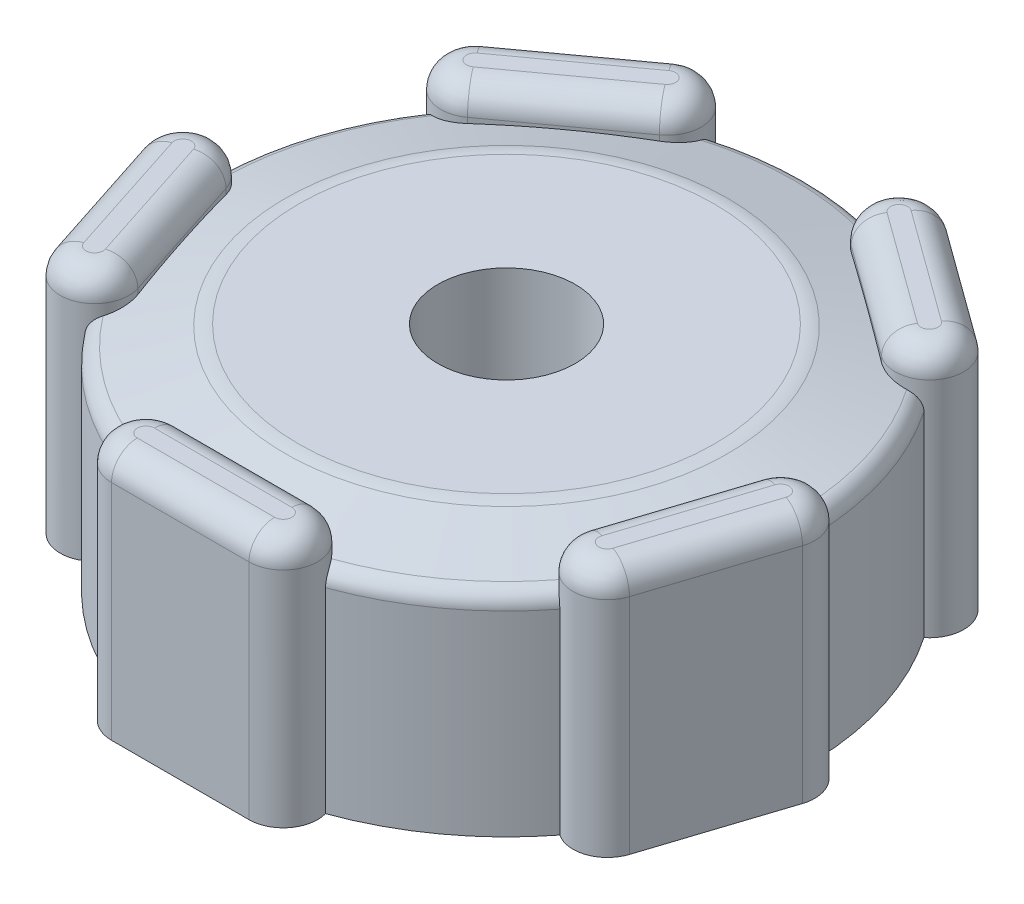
ISO-10303-21;
HEADER;
FILE_DESCRIPTION(('STEP AP214'),'2;1');
FILE_NAME('part.step','',(''),(''),'','','');
FILE_SCHEMA(('AUTOMOTIVE_DESIGN { 1 0 10303 214 1 1 1 1 }'));
ENDSEC;
DATA;
#1=APPLICATION_CONTEXT('core data for automotive mechanical design processes');
#2=APPLICATION_PROTOCOL_DEFINITION('international standard','automotive_design',2000,#1);
#3=PRODUCT_CONTEXT('',#1,'mechanical');
#4=PRODUCT('Part','Part','',(#3));
#5=PRODUCT_RELATED_PRODUCT_CATEGORY('part','',(#4));
#6=PRODUCT_DEFINITION_FORMATION('','',#4);
#7=PRODUCT_DEFINITION_CONTEXT('part definition',#1,'design');
#8=PRODUCT_DEFINITION('design','',#6,#7);
#9=PRODUCT_DEFINITION_SHAPE('','',#8);
#10=(LENGTH_UNIT() NAMED_UNIT(*) SI_UNIT(.MILLI.,.METRE.));
#11=(NAMED_UNIT(*) PLANE_ANGLE_UNIT() SI_UNIT($,.RADIAN.));
#12=(NAMED_UNIT(*) SI_UNIT($,.STERADIAN.) SOLID_ANGLE_UNIT());
#13=UNCERTAINTY_MEASURE_WITH_UNIT(LENGTH_MEASURE(1.E-05),#10,'distance_accuracy_value','');
#14=(GEOMETRIC_REPRESENTATION_CONTEXT(3) GLOBAL_UNCERTAINTY_ASSIGNED_CONTEXT((#13)) GLOBAL_UNIT_ASSIGNED_CONTEXT((#10,
#11,#12)) REPRESENTATION_CONTEXT('',''));
#15=CARTESIAN_POINT('',(0.,0.,0.));
#16=DIRECTION('',(0.,0.,1.));
#17=DIRECTION('',(1.,0.,0.));
#18=AXIS2_PLACEMENT_3D('',#15,#16,#17);
#19=CARTESIAN_POINT('',(4.84435469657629,13.,-16.8754919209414));
#20=DIRECTION('',(0.809016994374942,0.,0.58778525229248));
#21=DIRECTION('',(0.58778525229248,0.,-0.809016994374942));
#22=AXIS2_PLACEMENT_3D('',#19,#20,#21);
#23=CYLINDRICAL_SURFACE('',#22,1.5);
#24=CARTESIAN_POINT('',(12.9345246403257,13.,-10.9976393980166));
#25=DIRECTION('',(0.809016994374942,0.,0.58778525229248));
#26=DIRECTION('',(0.58778525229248,0.,-0.809016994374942));
#27=AXIS2_PLACEMENT_3D('',#24,#25,#26);
#28=CIRCLE('',#27,1.5);
#29=CARTESIAN_POINT('',(12.052846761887,13.,-9.7841139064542));
#30=VERTEX_POINT('',#29);
#31=CARTESIAN_POINT('',(12.9345246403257,14.5,-10.9976393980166));
#32=VERTEX_POINT('',#31);
#33=EDGE_CURVE('E311',#30,#32,#28,.F.);
#34=ORIENTED_EDGE('',*,*,#33,.T.);
#35=DIRECTION('',(0.809016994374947,0.,0.587785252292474));
#36=VECTOR('',#35,1.);
#37=CARTESIAN_POINT('',(6.46238868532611,14.5,-15.6999214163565));
#38=LINE('',#37,#36);
#39=CARTESIAN_POINT('',(6.46238868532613,14.5,-15.6999214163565));
#40=VERTEX_POINT('',#39);
#41=EDGE_CURVE('E310',#40,#32,#38,.T.);
#42=ORIENTED_EDGE('',*,*,#41,.F.);
#43=CARTESIAN_POINT('',(6.46238868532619,13.,-15.6999214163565));
#44=DIRECTION('',(0.809016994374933,0.,0.587785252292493));
#45=DIRECTION('',(-0.587785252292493,0.,0.809016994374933));
#46=AXIS2_PLACEMENT_3D('',#43,#44,#45);
#47=CIRCLE('',#46,1.5);
#48=CARTESIAN_POINT('',(5.58071080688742,13.,-14.4863959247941));
#49=VERTEX_POINT('',#48);
#50=EDGE_CURVE('E779',#49,#40,#47,.F.);
#51=ORIENTED_EDGE('',*,*,#50,.F.);
#52=DIRECTION('',(0.809016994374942,0.,0.58778525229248));
#53=VECTOR('',#52,1.);
#54=CARTESIAN_POINT('',(3.96267681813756,13.,-15.661966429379));
#55=LINE('',#54,#53);
#56=EDGE_CURVE('E850',#30,#49,#55,.F.);
#57=ORIENTED_EDGE('',*,*,#56,.F.);
#58=EDGE_LOOP('',(#34,#42,#51,#57));
#59=FACE_BOUND('',#58,.T.);
#60=ADVANCED_FACE('F16',(#59),#23,.T.);
#61=CARTESIAN_POINT('',(-14.5525586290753,13.0000000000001,-9.8220688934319));
#62=DIRECTION('',(0.809016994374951,0.,-0.587785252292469));
#63=DIRECTION('',(-0.587785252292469,0.,-0.809016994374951));
#64=AXIS2_PLACEMENT_3D('',#61,#62,#63);
#65=CYLINDRICAL_SURFACE('',#64,1.5);
#66=CARTESIAN_POINT('',(-6.46238868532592,13.,-15.6999214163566));
#67=DIRECTION('',(0.809016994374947,0.,-0.587785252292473));
#68=DIRECTION('',(0.587785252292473,0.,0.809016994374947));
#69=AXIS2_PLACEMENT_3D('',#66,#67,#68);
#70=CIRCLE('',#69,1.5);
#71=CARTESIAN_POINT('',(-6.46238868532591,14.5,-15.6999214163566));
#72=VERTEX_POINT('',#71);
#73=CARTESIAN_POINT('',(-5.58071080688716,13.,-14.4863959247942));
#74=VERTEX_POINT('',#73);
#75=EDGE_CURVE('E1491',#72,#74,#70,.T.);
#76=ORIENTED_EDGE('',*,*,#75,.F.);
#77=DIRECTION('',(0.809016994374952,0.,-0.587785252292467));
#78=VECTOR('',#77,1.);
#79=CARTESIAN_POINT('',(-12.9345246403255,14.5,-10.9976393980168));
#80=LINE('',#79,#78);
#81=CARTESIAN_POINT('',(-12.9345246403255,14.5,-10.9976393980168));
#82=VERTEX_POINT('',#81);
#83=EDGE_CURVE('E1482',#82,#72,#80,.T.);
#84=ORIENTED_EDGE('',*,*,#83,.F.);
#85=CARTESIAN_POINT('',(-12.9345246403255,13.,-10.9976393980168));
#86=DIRECTION('',(0.809016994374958,0.,-0.587785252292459));
#87=DIRECTION('',(0.587785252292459,0.,0.809016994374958));
#88=AXIS2_PLACEMENT_3D('',#85,#86,#87);
#89=CIRCLE('',#88,1.5);
#90=CARTESIAN_POINT('',(-12.0528467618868,13.,-9.78411390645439));
#91=VERTEX_POINT('',#90);
#92=EDGE_CURVE('E1560',#91,#82,#89,.F.);
#93=ORIENTED_EDGE('',*,*,#92,.F.);
#94=DIRECTION('',(0.809016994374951,0.,-0.587785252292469));
#95=VECTOR('',#94,1.);
#96=CARTESIAN_POINT('',(-13.6708807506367,13.,-8.60854340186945));
#97=LINE('',#96,#95);
#98=EDGE_CURVE('E1810',#74,#91,#97,.F.);
#99=ORIENTED_EDGE('',*,*,#98,.F.);
#100=EDGE_LOOP('',(#76,#84,#93,#99));
#101=FACE_BOUND('',#100,.T.);
#102=ADVANCED_FACE('F1113',(#101),#65,.T.);
#103=CARTESIAN_POINT('',(-13.8383305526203,13.,10.8051195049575));
#104=DIRECTION('',(-0.309016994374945,0.,-0.951056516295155));
#105=DIRECTION('',(-0.951056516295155,0.,0.309016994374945));
#106=AXIS2_PLACEMENT_3D('',#103,#104,#105);
#107=CYLINDRICAL_SURFACE('',#106,1.5);
#108=CARTESIAN_POINT('',(-16.9285004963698,13.,1.29455434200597));
#109=DIRECTION('',(-0.30901699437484,0.,-0.951056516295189));
#110=DIRECTION('',(0.951056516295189,0.,-0.30901699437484));
#111=AXIS2_PLACEMENT_3D('',#108,#109,#110);
#112=CIRCLE('',#111,1.5);
#113=CARTESIAN_POINT('',(-16.9285004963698,14.5,1.29455434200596));
#114=VERTEX_POINT('',#113);
#115=CARTESIAN_POINT('',(-15.5019157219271,13.,0.831028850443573));
#116=VERTEX_POINT('',#115);
#117=EDGE_CURVE('E1397',#114,#116,#112,.T.);
#118=ORIENTED_EDGE('',*,*,#117,.F.);
#119=DIRECTION('',(-0.309016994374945,0.,-0.951056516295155));
#120=VECTOR('',#119,1.);
#121=CARTESIAN_POINT('',(-14.4563645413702,14.5,8.90300647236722));
#122=LINE('',#121,#120);
#123=CARTESIAN_POINT('',(-14.4563645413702,14.5,8.9030064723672));
#124=VERTEX_POINT('',#123);
#125=EDGE_CURVE('E1389',#124,#114,#122,.T.);
#126=ORIENTED_EDGE('',*,*,#125,.F.);
#127=CARTESIAN_POINT('',(-14.4563645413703,13.,8.90300647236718));
#128=DIRECTION('',(-0.30901699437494,0.,-0.951056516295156));
#129=DIRECTION('',(0.951056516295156,0.,-0.30901699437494));
#130=AXIS2_PLACEMENT_3D('',#127,#128,#129);
#131=CIRCLE('',#130,1.5);
#132=CARTESIAN_POINT('',(-13.0297797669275,13.,8.43948098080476));
#133=VERTEX_POINT('',#132);
#134=EDGE_CURVE('E1319',#133,#124,#131,.F.);
#135=ORIENTED_EDGE('',*,*,#134,.F.);
#136=DIRECTION('',(-0.309016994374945,0.,-0.951056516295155));
#137=VECTOR('',#136,1.);
#138=CARTESIAN_POINT('',(-12.4117457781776,13.0000000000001,10.341594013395));
#139=LINE('',#138,#137);
#140=EDGE_CURVE('E907',#116,#133,#139,.F.);
#141=ORIENTED_EDGE('',*,*,#140,.F.);
#142=EDGE_LOOP('',(#118,#126,#135,#141));
#143=FACE_BOUND('',#142,.T.);
#144=ADVANCED_FACE('F1110',(#143),#107,.T.);
#145=CARTESIAN_POINT('',(-13.6708807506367,-15.8524895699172,-8.60854340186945));
#146=DIRECTION('',(0.587785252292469,0.,0.809016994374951));
#147=DIRECTION('',(0.809016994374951,0.,-0.587785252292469));
#148=AXIS2_PLACEMENT_3D('',#145,#146,#147);
#149=PLANE('',#148);
#150=DIRECTION('',(0.,1.,0.));
#151=VECTOR('',#150,1.);
#152=CARTESIAN_POINT('',(-12.0528467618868,-15.8524895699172,-9.78411390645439));
#153=LINE('',#152,#151);
#154=CARTESIAN_POINT('',(-12.0528467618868,12.6896748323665,-9.78411390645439));
#155=VERTEX_POINT('',#154);
#156=EDGE_CURVE('E1406',#155,#91,#153,.T.);
#157=ORIENTED_EDGE('',*,*,#156,.F.);
#158=CARTESIAN_POINT('',(-5.58071080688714,12.6896748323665,-14.4863959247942));
#159=CARTESIAN_POINT('',(-5.85012162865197,12.7126771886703,-14.2906575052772));
#160=CARTESIAN_POINT('',(-6.11968594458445,12.7329906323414,-14.0948075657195));
#161=CARTESIAN_POINT('',(-6.65905817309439,12.7680239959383,-13.702930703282));
#162=CARTESIAN_POINT('',(-6.92886609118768,12.7827437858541,-13.5069037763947));
#163=CARTESIAN_POINT('',(-7.46831693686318,12.8063584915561,-13.114969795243));
#164=CARTESIAN_POINT('',(-7.73795965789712,12.815260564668,-12.9190628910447));
#165=CARTESIAN_POINT('',(-8.27732784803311,12.8271447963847,-12.5271889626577));
#166=CARTESIAN_POINT('',(-8.54705331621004,12.8301270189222,-12.331221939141));
#167=CARTESIAN_POINT('',(-9.08650425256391,12.8301270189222,-11.9392878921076));
#168=CARTESIAN_POINT('',(-9.35622972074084,12.8271447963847,-11.7433208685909));
#169=CARTESIAN_POINT('',(-9.89559791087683,12.815260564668,-11.3514469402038));
#170=CARTESIAN_POINT('',(-10.1652406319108,12.8063584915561,-11.1555400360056));
#171=CARTESIAN_POINT('',(-10.7046914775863,12.7827437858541,-10.7636060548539));
#172=CARTESIAN_POINT('',(-10.9744993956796,12.7680239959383,-10.5675791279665));
#173=CARTESIAN_POINT('',(-11.5138716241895,12.7329906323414,-10.175702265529));
#174=CARTESIAN_POINT('',(-11.783435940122,12.7126771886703,-9.9798523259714));
#175=CARTESIAN_POINT('',(-12.0528467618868,12.6896748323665,-9.78411390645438));
#176=B_SPLINE_CURVE_WITH_KNOTS('',3,(#158,#159,#160,#161,#162,#163,#164,#165,#166,#167,#168,
#169,#170,#171,#172,#173,#174,#175),.UNSPECIFIED.,.F.,.F.,(4,2,2,2,2,2,2,2,4),(0.,
1.00140579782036,2.00283486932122,3.00302958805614,4.00321350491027,5.00339742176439,
6.00359214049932,7.00502121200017,8.00642700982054),.UNSPECIFIED.);
#177=CARTESIAN_POINT('',(-5.58071080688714,12.6896748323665,-14.4863959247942));
#178=VERTEX_POINT('',#177);
#179=EDGE_CURVE('E1078',#178,#155,#176,.T.);
#180=ORIENTED_EDGE('',*,*,#179,.F.);
#181=DIRECTION('',(0.,1.,0.));
#182=VECTOR('',#181,1.);
#183=CARTESIAN_POINT('',(-5.58071080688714,-15.8524895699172,-14.4863959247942));
#184=LINE('',#183,#182);
#185=EDGE_CURVE('E215',#178,#74,#184,.T.);
#186=ORIENTED_EDGE('',*,*,#185,.T.);
#187=ORIENTED_EDGE('',*,*,#98,.T.);
#188=EDGE_LOOP('',(#157,#180,#186,#187));
#189=FACE_BOUND('',#188,.T.);
#190=ADVANCED_FACE('F1106',(#189),#149,.T.);
#191=CARTESIAN_POINT('',(-12.4117457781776,-14.7114711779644,10.341594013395));
#192=DIRECTION('',(0.951056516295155,0.,-0.309016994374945));
#193=DIRECTION('',(-0.309016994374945,0.,-0.951056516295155));
#194=AXIS2_PLACEMENT_3D('',#191,#192,#193);
#195=PLANE('',#194);
#196=DIRECTION('',(0.,1.,0.));
#197=VECTOR('',#196,1.);
#198=CARTESIAN_POINT('',(-13.0297797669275,-14.7114711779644,8.43948098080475));
#199=LINE('',#198,#197);
#200=CARTESIAN_POINT('',(-13.0297797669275,12.6896748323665,8.43948098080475));
#201=VERTEX_POINT('',#200);
#202=EDGE_CURVE('E871',#133,#201,#199,.F.);
#203=ORIENTED_EDGE('',*,*,#202,.T.);
#204=CARTESIAN_POINT('',(-15.5019157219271,12.6896748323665,0.831028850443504));
#205=CARTESIAN_POINT('',(-15.3990099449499,12.7126771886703,1.14774026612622));
#206=CARTESIAN_POINT('',(-15.2960455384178,12.7329906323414,1.46463212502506));
#207=CARTESIAN_POINT('',(-15.0900236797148,12.7680239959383,2.0987022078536));
#208=CARTESIAN_POINT('',(-14.986966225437,12.7827437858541,2.41588043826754));
#209=CARTESIAN_POINT('',(-14.7809143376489,12.8063584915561,3.05004294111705));
#210=CARTESIAN_POINT('',(-14.6779199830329,12.815260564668,3.36702697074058));
#211=CARTESIAN_POINT('',(-14.4718996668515,12.8271447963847,4.0010923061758));
#212=CARTESIAN_POINT('',(-14.3688737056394,12.8301270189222,4.31817361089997));
#213=CARTESIAN_POINT('',(-14.1628217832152,12.8301270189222,4.95233622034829));
#214=CARTESIAN_POINT('',(-14.0597958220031,12.8271447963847,5.26941752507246));
#215=CARTESIAN_POINT('',(-13.8537755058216,12.815260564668,5.90348286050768));
#216=CARTESIAN_POINT('',(-13.7507811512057,12.8063584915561,6.22046689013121));
#217=CARTESIAN_POINT('',(-13.5447292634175,12.7827437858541,6.85462939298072));
#218=CARTESIAN_POINT('',(-13.4416718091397,12.7680239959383,7.17180762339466));
#219=CARTESIAN_POINT('',(-13.2356499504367,12.7329906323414,7.8058777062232));
#220=CARTESIAN_POINT('',(-13.1326855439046,12.7126771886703,8.12276956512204));
#221=CARTESIAN_POINT('',(-13.0297797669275,12.6896748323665,8.43948098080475));
#222=B_SPLINE_CURVE_WITH_KNOTS('',3,(#204,#205,#206,#207,#208,#209,#210,#211,#212,#213,#214,
#215,#216,#217,#218,#219,#220,#221),.UNSPECIFIED.,.F.,.F.,(4,2,2,2,2,2,2,2,4),(0.,
1.00140579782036,2.0028348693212,3.00302958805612,4.00321350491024,5.00339742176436,
6.00359214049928,7.00502121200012,8.00642700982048),.UNSPECIFIED.);
#223=CARTESIAN_POINT('',(-15.5019157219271,12.6896748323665,0.831028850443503));
#224=VERTEX_POINT('',#223);
#225=EDGE_CURVE('E1072',#224,#201,#222,.T.);
#226=ORIENTED_EDGE('',*,*,#225,.F.);
#227=DIRECTION('',(0.,1.,0.));
#228=VECTOR('',#227,1.);
#229=CARTESIAN_POINT('',(-15.5019157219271,-14.7114711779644,0.831028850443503));
#230=LINE('',#229,#228);
#231=EDGE_CURVE('E910',#224,#116,#230,.T.);
#232=ORIENTED_EDGE('',*,*,#231,.T.);
#233=ORIENTED_EDGE('',*,*,#140,.T.);
#234=EDGE_LOOP('',(#203,#226,#232,#233));
#235=FACE_BOUND('',#234,.T.);
#236=ADVANCED_FACE('F1102',(#235),#195,.T.);
#237=CARTESIAN_POINT('',(6.00000000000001,13.,16.4999999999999));
#238=DIRECTION('',(-1.,0.,0.));
#239=DIRECTION('',(0.,-1.,0.));
#240=AXIS2_PLACEMENT_3D('',#237,#238,#239);
#241=CYLINDRICAL_SURFACE('',#240,1.5);
#242=CARTESIAN_POINT('',(-4.,13.,16.4999999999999));
#243=DIRECTION('',(-1.,0.,0.));
#244=DIRECTION('',(0.,0.,-1.));
#245=AXIS2_PLACEMENT_3D('',#242,#243,#244);
#246=CIRCLE('',#245,1.5);
#247=CARTESIAN_POINT('',(-4.,14.5,16.5));
#248=VERTEX_POINT('',#247);
#249=CARTESIAN_POINT('',(-4.,13.,15.));
#250=VERTEX_POINT('',#249);
#251=EDGE_CURVE('E1083',#248,#250,#246,.T.);
#252=ORIENTED_EDGE('',*,*,#251,.F.);
#253=DIRECTION('',(-1.,0.,0.));
#254=VECTOR('',#253,1.);
#255=CARTESIAN_POINT('',(6.00000000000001,14.5,16.5));
#256=LINE('',#255,#254);
#257=CARTESIAN_POINT('',(4.,14.5,16.5));
#258=VERTEX_POINT('',#257);
#259=EDGE_CURVE('E1077',#258,#248,#256,.T.);
#260=ORIENTED_EDGE('',*,*,#259,.F.);
#261=CARTESIAN_POINT('',(4.,13.,16.5));
#262=DIRECTION('',(-1.,0.,0.));
#263=DIRECTION('',(0.,0.,-1.));
#264=AXIS2_PLACEMENT_3D('',#261,#262,#263);
#265=CIRCLE('',#264,1.5);
#266=CARTESIAN_POINT('',(4.00000000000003,13.,15.));
#267=VERTEX_POINT('',#266);
#268=EDGE_CURVE('E458',#267,#258,#265,.F.);
#269=ORIENTED_EDGE('',*,*,#268,.F.);
#270=DIRECTION('',(1.,0.,0.));
#271=VECTOR('',#270,1.);
#272=CARTESIAN_POINT('',(6.00000000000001,13.,15.));
#273=LINE('',#272,#271);
#274=EDGE_CURVE('E865',#250,#267,#273,.T.);
#275=ORIENTED_EDGE('',*,*,#274,.F.);
#276=EDGE_LOOP('',(#252,#260,#269,#275));
#277=FACE_BOUND('',#276,.T.);
#278=ADVANCED_FACE('F1105',(#277),#241,.T.);
#279=CARTESIAN_POINT('',(17.5465344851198,13.,-0.607558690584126));
#280=DIRECTION('',(-0.309016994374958,0.,0.95105651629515));
#281=DIRECTION('',(0.95105651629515,0.,0.309016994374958));
#282=AXIS2_PLACEMENT_3D('',#279,#280,#281);
#283=CYLINDRICAL_SURFACE('',#282,1.5);
#284=CARTESIAN_POINT('',(14.4563645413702,13.,8.90300647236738));
#285=DIRECTION('',(-0.309016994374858,0.,0.951056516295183));
#286=DIRECTION('',(-0.951056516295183,0.,-0.309016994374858));
#287=AXIS2_PLACEMENT_3D('',#284,#285,#286);
#288=CIRCLE('',#287,1.5);
#289=CARTESIAN_POINT('',(14.4563645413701,14.5,8.90300647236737));
#290=VERTEX_POINT('',#289);
#291=CARTESIAN_POINT('',(13.0297797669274,13.,8.43948098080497));
#292=VERTEX_POINT('',#291);
#293=EDGE_CURVE('E1253',#290,#292,#288,.T.);
#294=ORIENTED_EDGE('',*,*,#293,.F.);
#295=DIRECTION('',(-0.309016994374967,0.,0.951056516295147));
#296=VECTOR('',#295,1.);
#297=CARTESIAN_POINT('',(16.9285004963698,14.5,1.2945543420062));
#298=LINE('',#297,#296);
#299=CARTESIAN_POINT('',(16.9285004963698,14.5,1.29455434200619));
#300=VERTEX_POINT('',#299);
#301=EDGE_CURVE('E436',#300,#290,#298,.T.);
#302=ORIENTED_EDGE('',*,*,#301,.F.);
#303=CARTESIAN_POINT('',(16.9285004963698,13.,1.29455434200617));
#304=DIRECTION('',(-0.309016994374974,0.,0.951056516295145));
#305=DIRECTION('',(-0.951056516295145,0.,-0.309016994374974));
#306=AXIS2_PLACEMENT_3D('',#303,#304,#305);
#307=CIRCLE('',#306,1.5);
#308=CARTESIAN_POINT('',(15.5019157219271,13.,0.831028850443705));
#309=VERTEX_POINT('',#308);
#310=EDGE_CURVE('E370',#309,#300,#307,.F.);
#311=ORIENTED_EDGE('',*,*,#310,.F.);
#312=DIRECTION('',(-0.309016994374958,0.,0.95105651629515));
#313=VECTOR('',#312,1.);
#314=CARTESIAN_POINT('',(16.119949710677,13.,-1.07108418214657));
#315=LINE('',#314,#313);
#316=EDGE_CURVE('E855',#292,#309,#315,.F.);
#317=ORIENTED_EDGE('',*,*,#316,.F.);
#318=EDGE_LOOP('',(#294,#302,#311,#317));
#319=FACE_BOUND('',#318,.T.);
#320=ADVANCED_FACE('F883',(#319),#283,.T.);
#321=CARTESIAN_POINT('',(0.,10.5,0.));
#322=DIRECTION('',(0.,1.,0.));
#323=DIRECTION('',(0.,0.,1.));
#324=AXIS2_PLACEMENT_3D('',#321,#322,#323);
#325=TOROIDAL_SURFACE('',#324,12.1050425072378,3.);
#326=CARTESIAN_POINT('',(0.,13.5,0.));
#327=DIRECTION('',(0.,-1.,0.));
#328=DIRECTION('',(0.,0.,1.));
#329=AXIS2_PLACEMENT_3D('',#326,#327,#328);
#330=CIRCLE('',#329,12.1050425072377);
#331=CARTESIAN_POINT('',(0.,13.5,-12.1050425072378));
#332=VERTEX_POINT('',#331);
#333=CARTESIAN_POINT('',(0.,13.5,12.1050425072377));
#334=VERTEX_POINT('',#333);
#335=EDGE_CURVE('E800',#332,#334,#330,.F.);
#336=ORIENTED_EDGE('',*,*,#335,.F.);
#337=CARTESIAN_POINT('',(0.,13.5,0.));
#338=DIRECTION('',(0.,-1.,0.));
#339=DIRECTION('',(0.,0.,-1.));
#340=AXIS2_PLACEMENT_3D('',#337,#338,#339);
#341=CIRCLE('',#340,12.1050425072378);
#342=EDGE_CURVE('E813',#334,#332,#341,.F.);
#343=ORIENTED_EDGE('',*,*,#342,.F.);
#344=EDGE_LOOP('',(#336,#343));
#345=FACE_BOUND('',#344,.T.);
#346=CARTESIAN_POINT('',(0.,13.3977774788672,0.));
#347=DIRECTION('',(0.,-1.,0.));
#348=DIRECTION('',(0.,0.,-1.));
#349=AXIS2_PLACEMENT_3D('',#346,#347,#348);
#350=CIRCLE('',#349,12.8814996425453);
#351=CARTESIAN_POINT('',(0.,13.3977774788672,-12.8814996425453));
#352=VERTEX_POINT('',#351);
#353=EDGE_CURVE('E839',#352,#352,#350,.T.);
#354=ORIENTED_EDGE('',*,*,#353,.F.);
#355=EDGE_LOOP('',(#354));
#356=FACE_BOUND('',#355,.T.);
#357=ADVANCED_FACE('F877',(#345,#356),#325,.T.);
#358=CARTESIAN_POINT('',(6.00000000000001,-12.6491106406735,15.));
#359=DIRECTION('',(0.,0.,-1.));
#360=DIRECTION('',(0.,1.,0.));
#361=AXIS2_PLACEMENT_3D('',#358,#359,#360);
#362=PLANE('',#361);
#363=CARTESIAN_POINT('',(-4.,12.6896748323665,15.));
#364=CARTESIAN_POINT('',(-3.6669899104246,12.7126771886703,15.));
#365=CARTESIAN_POINT('',(-3.33379009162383,12.7329906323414,15.));
#366=CARTESIAN_POINT('',(-2.66708935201,12.7680239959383,15.));
#367=CARTESIAN_POINT('',(-2.333588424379,12.782743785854,15.));
#368=CARTESIAN_POINT('',(-1.66679050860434,12.806358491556,15.));
#369=CARTESIAN_POINT('',(-1.33349377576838,12.815260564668,15.));
#370=CARTESIAN_POINT('',(-0.666798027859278,12.8271447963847,15.));
#371=CARTESIAN_POINT('',(-0.333399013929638,12.8301270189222,15.));
#372=CARTESIAN_POINT('',(0.333399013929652,12.8301270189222,15.));
#373=CARTESIAN_POINT('',(0.666798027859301,12.8271447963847,15.));
#374=CARTESIAN_POINT('',(1.33349377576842,12.815260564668,15.));
#375=CARTESIAN_POINT('',(1.66679050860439,12.806358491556,15.));
#376=CARTESIAN_POINT('',(2.33358842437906,12.782743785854,15.));
#377=CARTESIAN_POINT('',(2.66708935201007,12.7680239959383,15.));
#378=CARTESIAN_POINT('',(3.33379009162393,12.7329906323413,15.));
#379=CARTESIAN_POINT('',(3.66698991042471,12.7126771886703,15.));
#380=CARTESIAN_POINT('',(4.00000000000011,12.6896748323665,15.));
#381=B_SPLINE_CURVE_WITH_KNOTS('',3,(#363,#364,#365,#366,#367,#368,#369,#370,#371,#372,#373,
#374,#375,#376,#377,#378,#379,#380),.UNSPECIFIED.,.F.,.F.,(4,2,2,2,2,2,2,2,4),(0.,
1.00140579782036,2.0028348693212,3.00302958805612,4.00321350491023,5.00339742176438,
6.00359214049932,7.00502121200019,8.00642700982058),.UNSPECIFIED.);
#382=CARTESIAN_POINT('',(-4.,12.6896748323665,15.));
#383=VERTEX_POINT('',#382);
#384=CARTESIAN_POINT('',(4.00000000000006,12.6896748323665,15.));
#385=VERTEX_POINT('',#384);
#386=EDGE_CURVE('E847',#383,#385,#381,.T.);
#387=ORIENTED_EDGE('',*,*,#386,.F.);
#388=DIRECTION('',(0.,1.,0.));
#389=VECTOR('',#388,1.);
#390=CARTESIAN_POINT('',(-4.,-12.6491106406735,15.));
#391=LINE('',#390,#389);
#392=EDGE_CURVE('E868',#383,#250,#391,.T.);
#393=ORIENTED_EDGE('',*,*,#392,.T.);
#394=ORIENTED_EDGE('',*,*,#274,.T.);
#395=DIRECTION('',(0.,1.,0.));
#396=VECTOR('',#395,1.);
#397=CARTESIAN_POINT('',(4.,-12.6491106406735,15.));
#398=LINE('',#397,#396);
#399=EDGE_CURVE('E861',#267,#385,#398,.F.);
#400=ORIENTED_EDGE('',*,*,#399,.T.);
#401=EDGE_LOOP('',(#387,#393,#394,#400));
#402=FACE_BOUND('',#401,.T.);
#403=ADVANCED_FACE('F882',(#402),#362,.T.);
#404=CARTESIAN_POINT('',(16.119949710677,-14.7114711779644,-1.07108418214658));
#405=DIRECTION('',(-0.95105651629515,0.,-0.309016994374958));
#406=DIRECTION('',(-0.309016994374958,0.,0.95105651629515));
#407=AXIS2_PLACEMENT_3D('',#404,#405,#406);
#408=PLANE('',#407);
#409=DIRECTION('',(0.,1.,0.));
#410=VECTOR('',#409,1.);
#411=CARTESIAN_POINT('',(15.5019157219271,-14.7114711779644,0.831028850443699));
#412=LINE('',#411,#410);
#413=CARTESIAN_POINT('',(15.5019157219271,12.6896748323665,0.8310288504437));
#414=VERTEX_POINT('',#413);
#415=EDGE_CURVE('E853',#309,#414,#412,.F.);
#416=ORIENTED_EDGE('',*,*,#415,.T.);
#417=CARTESIAN_POINT('',(13.0297797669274,12.6896748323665,8.43948098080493));
#418=CARTESIAN_POINT('',(13.1326855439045,12.7126771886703,8.12276956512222));
#419=CARTESIAN_POINT('',(13.2356499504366,12.7329906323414,7.80587770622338));
#420=CARTESIAN_POINT('',(13.4416718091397,12.7680239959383,7.17180762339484));
#421=CARTESIAN_POINT('',(13.5447292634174,12.7827437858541,6.8546293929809));
#422=CARTESIAN_POINT('',(13.7507811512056,12.8063584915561,6.22046689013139));
#423=CARTESIAN_POINT('',(13.8537755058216,12.815260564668,5.90348286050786));
#424=CARTESIAN_POINT('',(14.059795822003,12.8271447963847,5.26941752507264));
#425=CARTESIAN_POINT('',(14.1628217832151,12.8301270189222,4.95233622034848));
#426=CARTESIAN_POINT('',(14.3688737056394,12.8301270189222,4.31817361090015));
#427=CARTESIAN_POINT('',(14.4718996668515,12.8271447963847,4.00109230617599));
#428=CARTESIAN_POINT('',(14.6779199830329,12.815260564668,3.36702697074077));
#429=CARTESIAN_POINT('',(14.7809143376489,12.8063584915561,3.05004294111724));
#430=CARTESIAN_POINT('',(14.986966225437,12.7827437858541,2.41588043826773));
#431=CARTESIAN_POINT('',(15.0900236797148,12.7680239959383,2.09870220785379));
#432=CARTESIAN_POINT('',(15.2960455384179,12.7329906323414,1.46463212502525));
#433=CARTESIAN_POINT('',(15.39900994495,12.7126771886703,1.14774026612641));
#434=CARTESIAN_POINT('',(15.5019157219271,12.6896748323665,0.831028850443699));
#435=B_SPLINE_CURVE_WITH_KNOTS('',3,(#417,#418,#419,#420,#421,#422,#423,#424,#425,#426,#427,
#428,#429,#430,#431,#432,#433,#434),.UNSPECIFIED.,.F.,.F.,(4,2,2,2,2,2,2,2,4),(0.,
1.00140579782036,2.00283486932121,3.00302958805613,4.00321350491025,5.00339742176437,
6.00359214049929,7.00502121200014,8.0064270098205),.UNSPECIFIED.);
#436=CARTESIAN_POINT('',(13.0297797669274,12.6896748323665,8.43948098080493));
#437=VERTEX_POINT('',#436);
#438=EDGE_CURVE('E1623',#437,#414,#435,.T.);
#439=ORIENTED_EDGE('',*,*,#438,.F.);
#440=DIRECTION('',(0.,1.,0.));
#441=VECTOR('',#440,1.);
#442=CARTESIAN_POINT('',(13.0297797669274,-14.7114711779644,8.43948098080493));
#443=LINE('',#442,#441);
#444=EDGE_CURVE('E858',#437,#292,#443,.T.);
#445=ORIENTED_EDGE('',*,*,#444,.T.);
#446=ORIENTED_EDGE('',*,*,#316,.T.);
#447=EDGE_LOOP('',(#416,#439,#445,#446));
#448=FACE_BOUND('',#447,.T.);
#449=ADVANCED_FACE('F1636',(#448),#408,.T.);
#450=CARTESIAN_POINT('',(3.96267681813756,-15.8524895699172,-15.661966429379));
#451=DIRECTION('',(-0.58778525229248,0.,0.809016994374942));
#452=DIRECTION('',(0.809016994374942,0.,0.58778525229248));
#453=AXIS2_PLACEMENT_3D('',#450,#451,#452);
#454=PLANE('',#453);
#455=DIRECTION('',(0.,1.,0.));
#456=VECTOR('',#455,1.);
#457=CARTESIAN_POINT('',(5.58071080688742,-15.8524895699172,-14.4863959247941));
#458=LINE('',#457,#456);
#459=CARTESIAN_POINT('',(5.58071080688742,12.6896748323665,-14.4863959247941));
#460=VERTEX_POINT('',#459);
#461=EDGE_CURVE('E848',#49,#460,#458,.F.);
#462=ORIENTED_EDGE('',*,*,#461,.T.);
#463=CARTESIAN_POINT('',(12.052846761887,12.6896748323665,-9.78411390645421));
#464=CARTESIAN_POINT('',(11.7834359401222,12.7126771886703,-9.97985232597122));
#465=CARTESIAN_POINT('',(11.5138716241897,12.7329906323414,-10.1757022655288));
#466=CARTESIAN_POINT('',(10.9744993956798,12.7680239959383,-10.5675791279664));
#467=CARTESIAN_POINT('',(10.7046914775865,12.782743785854,-10.7636060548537));
#468=CARTESIAN_POINT('',(10.165240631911,12.8063584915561,-11.1555400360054));
#469=CARTESIAN_POINT('',(9.89559791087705,12.815260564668,-11.3514469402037));
#470=CARTESIAN_POINT('',(9.35622972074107,12.8271447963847,-11.7433208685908));
#471=CARTESIAN_POINT('',(9.08650425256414,12.8301270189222,-11.9392878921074));
#472=CARTESIAN_POINT('',(8.54705331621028,12.8301270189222,-12.3312219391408));
#473=CARTESIAN_POINT('',(8.27732784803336,12.8271447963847,-12.5271889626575));
#474=CARTESIAN_POINT('',(7.73795965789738,12.815260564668,-12.9190628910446));
#475=CARTESIAN_POINT('',(7.46831693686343,12.8063584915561,-13.1149697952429));
#476=CARTESIAN_POINT('',(6.92886609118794,12.7827437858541,-13.5069037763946));
#477=CARTESIAN_POINT('',(6.65905817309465,12.7680239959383,-13.7029307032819));
#478=CARTESIAN_POINT('',(6.11968594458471,12.7329906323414,-14.0948075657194));
#479=CARTESIAN_POINT('',(5.85012162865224,12.7126771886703,-14.2906575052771));
#480=CARTESIAN_POINT('',(5.58071080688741,12.6896748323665,-14.4863959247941));
#481=B_SPLINE_CURVE_WITH_KNOTS('',3,(#463,#464,#465,#466,#467,#468,#469,#470,#471,#472,#473,
#474,#475,#476,#477,#478,#479,#480),.UNSPECIFIED.,.F.,.F.,(4,2,2,2,2,2,2,2,4),(0.,
1.00140579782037,2.00283486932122,3.00302958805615,4.00321350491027,5.00339742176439,
6.00359214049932,7.00502121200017,8.00642700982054),.UNSPECIFIED.);
#482=CARTESIAN_POINT('',(12.052846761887,12.6896748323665,-9.78411390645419));
#483=VERTEX_POINT('',#482);
#484=EDGE_CURVE('E1569',#483,#460,#481,.T.);
#485=ORIENTED_EDGE('',*,*,#484,.F.);
#486=DIRECTION('',(0.,1.,0.));
#487=VECTOR('',#486,1.);
#488=CARTESIAN_POINT('',(12.052846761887,-15.8524895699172,-9.78411390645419));
#489=LINE('',#488,#487);
#490=EDGE_CURVE('E797',#30,#483,#489,.F.);
#491=ORIENTED_EDGE('',*,*,#490,.F.);
#492=ORIENTED_EDGE('',*,*,#56,.T.);
#493=EDGE_LOOP('',(#462,#485,#491,#492));
#494=FACE_BOUND('',#493,.T.);
#495=ADVANCED_FACE('F830',(#494),#454,.T.);
#496=CARTESIAN_POINT('',(0.,13.5,0.));
#497=DIRECTION('',(0.,1.,0.));
#498=DIRECTION('',(-1.,0.,0.));
#499=AXIS2_PLACEMENT_3D('',#496,#497,#498);
#500=PLANE('',#499);
#501=ORIENTED_EDGE('',*,*,#342,.T.);
#502=ORIENTED_EDGE('',*,*,#335,.T.);
#503=EDGE_LOOP('',(#501,#502));
#504=FACE_BOUND('',#503,.T.);
#505=CARTESIAN_POINT('',(0.,13.5,0.));
#506=DIRECTION('',(0.,-1.,0.));
#507=DIRECTION('',(1.,0.,0.));
#508=AXIS2_PLACEMENT_3D('',#505,#506,#507);
#509=CIRCLE('',#508,4.);
#510=CARTESIAN_POINT('',(4.,13.5,0.));
#511=VERTEX_POINT('',#510);
#512=EDGE_CURVE('E362',#511,#511,#509,.T.);
#513=ORIENTED_EDGE('',*,*,#512,.T.);
#514=EDGE_LOOP('',(#513));
#515=FACE_BOUND('',#514,.T.);
#516=ADVANCED_FACE('F820',(#504,#515),#500,.T.);
#517=CARTESIAN_POINT('',(3.96267681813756,14.5,-15.6619664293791));
#518=DIRECTION('',(0.,1.,0.));
#519=DIRECTION('',(-1.,0.,0.));
#520=AXIS2_PLACEMENT_3D('',#517,#518,#519);
#521=PLANE('',#520);
#522=CARTESIAN_POINT('',(6.75628131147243,14.5,-16.104429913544));
#523=DIRECTION('',(0.,-1.,0.));
#524=DIRECTION('',(0.,0.,-1.));
#525=AXIS2_PLACEMENT_3D('',#522,#523,#524);
#526=CIRCLE('',#525,0.499999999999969);
#527=CARTESIAN_POINT('',(6.75628131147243,14.5,-16.604429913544));
#528=VERTEX_POINT('',#527);
#529=CARTESIAN_POINT('',(7.05017393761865,14.5,-16.5089384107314));
#530=VERTEX_POINT('',#529);
#531=EDGE_CURVE('E773',#528,#530,#526,.T.);
#532=ORIENTED_EDGE('',*,*,#531,.F.);
#533=CARTESIAN_POINT('',(6.75628131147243,14.5,-16.104429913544));
#534=DIRECTION('',(0.,-1.,0.));
#535=DIRECTION('',(-0.809016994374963,0.,-0.587785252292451));
#536=AXIS2_PLACEMENT_3D('',#533,#534,#535);
#537=CIRCLE('',#536,0.499999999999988);
#538=CARTESIAN_POINT('',(6.35177281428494,14.5,-16.3983225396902));
#539=VERTEX_POINT('',#538);
#540=EDGE_CURVE('E319',#528,#539,#537,.F.);
#541=ORIENTED_EDGE('',*,*,#540,.T.);
#542=CARTESIAN_POINT('',(6.75628131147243,14.5,-16.104429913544));
#543=DIRECTION('',(0.,-1.,0.));
#544=DIRECTION('',(-0.587785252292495,0.,0.809016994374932));
#545=AXIS2_PLACEMENT_3D('',#542,#543,#544);
#546=CIRCLE('',#545,0.500000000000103);
#547=EDGE_CURVE('E1493',#40,#539,#546,.T.);
#548=ORIENTED_EDGE('',*,*,#547,.F.);
#549=ORIENTED_EDGE('',*,*,#41,.T.);
#550=CARTESIAN_POINT('',(13.2284172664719,14.5,-11.4021478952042));
#551=DIRECTION('',(0.,-1.,0.));
#552=DIRECTION('',(0.,0.,1.));
#553=AXIS2_PLACEMENT_3D('',#550,#551,#552);
#554=CIRCLE('',#553,0.500000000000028);
#555=CARTESIAN_POINT('',(13.2284172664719,14.5,-10.9021478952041));
#556=VERTEX_POINT('',#555);
#557=EDGE_CURVE('E296',#556,#32,#554,.T.);
#558=ORIENTED_EDGE('',*,*,#557,.F.);
#559=CARTESIAN_POINT('',(13.2284172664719,14.5,-11.4021478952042));
#560=DIRECTION('',(0.,-1.,0.));
#561=DIRECTION('',(0.809016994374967,0.,0.587785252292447));
#562=AXIS2_PLACEMENT_3D('',#559,#560,#561);
#563=CIRCLE('',#562,0.500000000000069);
#564=CARTESIAN_POINT('',(13.6329257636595,14.5,-11.1082552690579));
#565=VERTEX_POINT('',#564);
#566=EDGE_CURVE('E305',#556,#565,#563,.F.);
#567=ORIENTED_EDGE('',*,*,#566,.T.);
#568=CARTESIAN_POINT('',(13.2284172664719,14.5,-11.4021478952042));
#569=DIRECTION('',(0.,-1.,0.));
#570=DIRECTION('',(0.587785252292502,0.,-0.809016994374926));
#571=AXIS2_PLACEMENT_3D('',#568,#569,#570);
#572=CIRCLE('',#571,0.499999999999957);
#573=CARTESIAN_POINT('',(13.5223098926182,14.5,-11.8066563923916));
#574=VERTEX_POINT('',#573);
#575=EDGE_CURVE('E317',#574,#565,#572,.T.);
#576=ORIENTED_EDGE('',*,*,#575,.F.);
#577=DIRECTION('',(-0.809016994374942,0.,-0.58778525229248));
#578=VECTOR('',#577,1.);
#579=CARTESIAN_POINT('',(5.43213994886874,14.5,-17.6845089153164));
#580=LINE('',#579,#578);
#581=EDGE_CURVE('E783',#530,#574,#580,.F.);
#582=ORIENTED_EDGE('',*,*,#581,.F.);
#583=EDGE_LOOP('',(#532,#541,#548,#549,#558,#567,#576,#582));
#584=FACE_BOUND('',#583,.T.);
#585=ADVANCED_FACE('F303',(#584),#521,.T.);
#586=CARTESIAN_POINT('',(-13.6708807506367,14.5,-8.60854340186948));
#587=DIRECTION('',(0.,1.,0.));
#588=DIRECTION('',(0.,0.,1.));
#589=AXIS2_PLACEMENT_3D('',#586,#587,#588);
#590=PLANE('',#589);
#591=DIRECTION('',(-0.809016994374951,0.,0.587785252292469));
#592=VECTOR('',#591,1.);
#593=CARTESIAN_POINT('',(-15.1403438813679,14.5000000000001,-10.6310858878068));
#594=LINE('',#593,#592);
#595=CARTESIAN_POINT('',(-13.522309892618,14.5,-11.8066563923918));
#596=VERTEX_POINT('',#595);
#597=CARTESIAN_POINT('',(-7.05017393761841,14.5,-16.5089384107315));
#598=VERTEX_POINT('',#597);
#599=EDGE_CURVE('E1418',#596,#598,#594,.F.);
#600=ORIENTED_EDGE('',*,*,#599,.F.);
#601=CARTESIAN_POINT('',(-13.2284172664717,14.5,-11.4021478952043));
#602=DIRECTION('',(0.,-1.,0.));
#603=DIRECTION('',(-0.80901699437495,0.,0.587785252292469));
#604=AXIS2_PLACEMENT_3D('',#601,#602,#603);
#605=CIRCLE('',#604,0.50000000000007);
#606=CARTESIAN_POINT('',(-13.6329257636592,14.5,-11.1082552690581));
#607=VERTEX_POINT('',#606);
#608=EDGE_CURVE('E1415',#596,#607,#605,.F.);
#609=ORIENTED_EDGE('',*,*,#608,.T.);
#610=CARTESIAN_POINT('',(-13.2284172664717,14.5,-11.4021478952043));
#611=DIRECTION('',(0.,-1.,0.));
#612=DIRECTION('',(0.,0.,1.));
#613=AXIS2_PLACEMENT_3D('',#610,#611,#612);
#614=CIRCLE('',#613,0.499999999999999);
#615=CARTESIAN_POINT('',(-13.2284172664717,14.5,-10.9021478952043));
#616=VERTEX_POINT('',#615);
#617=EDGE_CURVE('E1414',#616,#607,#614,.T.);
#618=ORIENTED_EDGE('',*,*,#617,.F.);
#619=CARTESIAN_POINT('',(-13.2284172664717,14.5,-11.4021478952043));
#620=DIRECTION('',(0.,-1.,0.));
#621=DIRECTION('',(0.587785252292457,0.,0.809016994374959));
#622=AXIS2_PLACEMENT_3D('',#619,#620,#621);
#623=CIRCLE('',#622,0.499999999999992);
#624=EDGE_CURVE('E1437',#616,#82,#623,.F.);
#625=ORIENTED_EDGE('',*,*,#624,.T.);
#626=ORIENTED_EDGE('',*,*,#83,.T.);
#627=CARTESIAN_POINT('',(-6.75628131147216,14.5,-16.1044299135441));
#628=DIRECTION('',(0.,-1.,0.));
#629=DIRECTION('',(0.809016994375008,0.,-0.58778525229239));
#630=AXIS2_PLACEMENT_3D('',#627,#628,#629);
#631=CIRCLE('',#630,0.499999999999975);
#632=CARTESIAN_POINT('',(-6.35177281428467,14.5,-16.3983225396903));
#633=VERTEX_POINT('',#632);
#634=EDGE_CURVE('E223',#72,#633,#631,.F.);
#635=ORIENTED_EDGE('',*,*,#634,.T.);
#636=CARTESIAN_POINT('',(-6.75628131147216,14.5,-16.1044299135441));
#637=DIRECTION('',(0.,-1.,0.));
#638=DIRECTION('',(0.,0.,-1.));
#639=AXIS2_PLACEMENT_3D('',#636,#637,#638);
#640=CIRCLE('',#639,0.499999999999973);
#641=CARTESIAN_POINT('',(-6.75628131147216,14.5,-16.6044299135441));
#642=VERTEX_POINT('',#641);
#643=EDGE_CURVE('E1457',#642,#633,#640,.T.);
#644=ORIENTED_EDGE('',*,*,#643,.F.);
#645=CARTESIAN_POINT('',(-6.75628131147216,14.5,-16.1044299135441));
#646=DIRECTION('',(0.,-1.,0.));
#647=DIRECTION('',(-0.587785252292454,0.,-0.809016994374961));
#648=AXIS2_PLACEMENT_3D('',#645,#646,#647);
#649=CIRCLE('',#648,0.499999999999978);
#650=EDGE_CURVE('E1468',#642,#598,#649,.F.);
#651=ORIENTED_EDGE('',*,*,#650,.T.);
#652=EDGE_LOOP('',(#600,#609,#618,#625,#626,#635,#644,#651));
#653=FACE_BOUND('',#652,.T.);
#654=ADVANCED_FACE('F1356',(#653),#590,.T.);
#655=CARTESIAN_POINT('',(-12.4117457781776,14.5,10.3415940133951));
#656=DIRECTION('',(0.,1.,0.));
#657=DIRECTION('',(0.,0.,1.));
#658=AXIS2_PLACEMENT_3D('',#655,#656,#657);
#659=PLANE('',#658);
#660=CARTESIAN_POINT('',(-14.9318927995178,14.5,9.05751496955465));
#661=DIRECTION('',(0.,-1.,0.));
#662=DIRECTION('',(0.,0.,1.));
#663=AXIS2_PLACEMENT_3D('',#660,#661,#662);
#664=CIRCLE('',#663,0.500000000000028);
#665=CARTESIAN_POINT('',(-15.4074210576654,14.5,9.21202346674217));
#666=VERTEX_POINT('',#665);
#667=CARTESIAN_POINT('',(-14.9318927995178,14.5,9.55751496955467));
#668=VERTEX_POINT('',#667);
#669=EDGE_CURVE('E2281',#666,#668,#664,.F.);
#670=ORIENTED_EDGE('',*,*,#669,.T.);
#671=CARTESIAN_POINT('',(-14.9318927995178,14.5,9.05751496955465));
#672=DIRECTION('',(0.,-1.,0.));
#673=DIRECTION('',(0.309016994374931,0.,0.951056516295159));
#674=AXIS2_PLACEMENT_3D('',#671,#672,#673);
#675=CIRCLE('',#674,0.500000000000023);
#676=CARTESIAN_POINT('',(-14.7773843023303,14.5,9.53304322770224));
#677=VERTEX_POINT('',#676);
#678=EDGE_CURVE('E1327',#677,#668,#675,.T.);
#679=ORIENTED_EDGE('',*,*,#678,.F.);
#680=CARTESIAN_POINT('',(-14.9318927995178,14.5,9.05751496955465));
#681=DIRECTION('',(0.,-1.,0.));
#682=DIRECTION('',(0.951056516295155,0.,-0.309016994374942));
#683=AXIS2_PLACEMENT_3D('',#680,#681,#682);
#684=CIRCLE('',#683,0.500000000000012);
#685=EDGE_CURVE('E1312',#124,#677,#684,.T.);
#686=ORIENTED_EDGE('',*,*,#685,.F.);
#687=ORIENTED_EDGE('',*,*,#125,.T.);
#688=CARTESIAN_POINT('',(-17.4040287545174,14.5,1.44906283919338));
#689=DIRECTION('',(0.,-1.,0.));
#690=DIRECTION('',(0.,0.,-1.));
#691=AXIS2_PLACEMENT_3D('',#688,#689,#690);
#692=CIRCLE('',#691,0.499999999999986);
#693=CARTESIAN_POINT('',(-17.4040287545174,14.5,0.949062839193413));
#694=VERTEX_POINT('',#693);
#695=EDGE_CURVE('E1396',#114,#694,#692,.F.);
#696=ORIENTED_EDGE('',*,*,#695,.T.);
#697=CARTESIAN_POINT('',(-17.4040287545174,14.5,1.44906283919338));
#698=DIRECTION('',(0.,-1.,0.));
#699=DIRECTION('',(-0.309016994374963,0.,-0.951056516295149));
#700=AXIS2_PLACEMENT_3D('',#697,#698,#699);
#701=CIRCLE('',#700,0.499999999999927);
#702=CARTESIAN_POINT('',(-17.5585372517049,14.5,0.973534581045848));
#703=VERTEX_POINT('',#702);
#704=EDGE_CURVE('E624',#694,#703,#701,.F.);
#705=ORIENTED_EDGE('',*,*,#704,.T.);
#706=CARTESIAN_POINT('',(-17.4040287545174,14.5,1.44906283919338));
#707=DIRECTION('',(0.,-1.,0.));
#708=DIRECTION('',(-0.951056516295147,0.,0.309016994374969));
#709=AXIS2_PLACEMENT_3D('',#706,#707,#708);
#710=CIRCLE('',#709,0.500000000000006);
#711=CARTESIAN_POINT('',(-17.8795570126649,14.5,1.6035713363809));
#712=VERTEX_POINT('',#711);
#713=EDGE_CURVE('E1402',#712,#703,#710,.T.);
#714=ORIENTED_EDGE('',*,*,#713,.F.);
#715=DIRECTION('',(0.309016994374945,0.,0.951056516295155));
#716=VECTOR('',#715,1.);
#717=CARTESIAN_POINT('',(-14.7893870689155,14.5,11.1141364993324));
#718=LINE('',#717,#716);
#719=EDGE_CURVE('E1330',#666,#712,#718,.F.);
#720=ORIENTED_EDGE('',*,*,#719,.F.);
#721=EDGE_LOOP('',(#670,#679,#686,#687,#696,#705,#714,#720));
#722=FACE_BOUND('',#721,.T.);
#723=ADVANCED_FACE('F1348',(#722),#659,.T.);
#724=CARTESIAN_POINT('',(6.00000000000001,14.5,15.));
#725=DIRECTION('',(0.,1.,0.));
#726=DIRECTION('',(-1.,0.,0.));
#727=AXIS2_PLACEMENT_3D('',#724,#725,#726);
#728=PLANE('',#727);
#729=DIRECTION('',(1.,0.,0.));
#730=VECTOR('',#729,1.);
#731=CARTESIAN_POINT('',(6.00000000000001,14.5,17.4999999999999));
#732=LINE('',#731,#730);
#733=CARTESIAN_POINT('',(4.,14.5,17.5));
#734=VERTEX_POINT('',#733);
#735=CARTESIAN_POINT('',(-4.,14.5,17.4999999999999));
#736=VERTEX_POINT('',#735);
#737=EDGE_CURVE('E1263',#734,#736,#732,.F.);
#738=ORIENTED_EDGE('',*,*,#737,.F.);
#739=CARTESIAN_POINT('',(4.,14.5,17.));
#740=DIRECTION('',(0.,-1.,0.));
#741=DIRECTION('',(1.,0.,0.));
#742=AXIS2_PLACEMENT_3D('',#739,#740,#741);
#743=CIRCLE('',#742,0.500000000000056);
#744=CARTESIAN_POINT('',(4.50000000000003,14.5,17.));
#745=VERTEX_POINT('',#744);
#746=EDGE_CURVE('E1255',#734,#745,#743,.F.);
#747=ORIENTED_EDGE('',*,*,#746,.T.);
#748=CARTESIAN_POINT('',(4.,14.5,17.));
#749=DIRECTION('',(0.,-1.,0.));
#750=DIRECTION('',(0.,0.,-1.));
#751=AXIS2_PLACEMENT_3D('',#748,#749,#750);
#752=CIRCLE('',#751,0.499999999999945);
#753=EDGE_CURVE('E445',#258,#745,#752,.T.);
#754=ORIENTED_EDGE('',*,*,#753,.F.);
#755=ORIENTED_EDGE('',*,*,#259,.T.);
#756=CARTESIAN_POINT('',(-4.,14.5,16.9999999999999));
#757=DIRECTION('',(0.,-1.,0.));
#758=DIRECTION('',(-1.,0.,0.));
#759=AXIS2_PLACEMENT_3D('',#756,#757,#758);
#760=CIRCLE('',#759,0.499999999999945);
#761=CARTESIAN_POINT('',(-4.49999999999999,14.5,17.));
#762=VERTEX_POINT('',#761);
#763=EDGE_CURVE('E542',#248,#762,#760,.F.);
#764=ORIENTED_EDGE('',*,*,#763,.T.);
#765=CARTESIAN_POINT('',(-4.,14.5,16.9999999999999));
#766=DIRECTION('',(0.,-1.,0.));
#767=DIRECTION('',(0.,0.,1.));
#768=AXIS2_PLACEMENT_3D('',#765,#766,#767);
#769=CIRCLE('',#768,0.500000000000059);
#770=EDGE_CURVE('E1055',#736,#762,#769,.T.);
#771=ORIENTED_EDGE('',*,*,#770,.F.);
#772=EDGE_LOOP('',(#738,#747,#754,#755,#764,#771));
#773=FACE_BOUND('',#772,.T.);
#774=ADVANCED_FACE('F400',(#773),#728,.T.);
#775=CARTESIAN_POINT('',(16.119949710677,14.5,-1.07108418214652));
#776=DIRECTION('',(0.,1.,0.));
#777=DIRECTION('',(-1.,0.,0.));
#778=AXIS2_PLACEMENT_3D('',#775,#776,#777);
#779=PLANE('',#778);
#780=DIRECTION('',(0.309016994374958,0.,-0.95105651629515));
#781=VECTOR('',#780,1.);
#782=CARTESIAN_POINT('',(18.4975910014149,14.5,-0.298541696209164));
#783=LINE('',#782,#781);
#784=CARTESIAN_POINT('',(17.879557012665,14.5,1.60357133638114));
#785=VERTEX_POINT('',#784);
#786=CARTESIAN_POINT('',(15.4074210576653,14.5,9.21202346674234));
#787=VERTEX_POINT('',#786);
#788=EDGE_CURVE('E363',#785,#787,#783,.F.);
#789=ORIENTED_EDGE('',*,*,#788,.F.);
#790=CARTESIAN_POINT('',(17.4040287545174,14.5,1.44906283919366));
#791=DIRECTION('',(0.,-1.,0.));
#792=DIRECTION('',(0.309016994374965,0.,-0.951056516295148));
#793=AXIS2_PLACEMENT_3D('',#790,#791,#792);
#794=CIRCLE('',#793,0.49999999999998);
#795=CARTESIAN_POINT('',(17.5585372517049,14.5,0.973534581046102));
#796=VERTEX_POINT('',#795);
#797=EDGE_CURVE('E374',#785,#796,#794,.F.);
#798=ORIENTED_EDGE('',*,*,#797,.T.);
#799=CARTESIAN_POINT('',(17.4040287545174,14.5,1.44906283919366));
#800=DIRECTION('',(0.,-1.,0.));
#801=DIRECTION('',(0.,0.,-1.));
#802=AXIS2_PLACEMENT_3D('',#799,#800,#801);
#803=CIRCLE('',#802,0.499999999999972);
#804=CARTESIAN_POINT('',(17.4040287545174,14.5,0.949062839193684));
#805=VERTEX_POINT('',#804);
#806=EDGE_CURVE('E383',#805,#796,#803,.T.);
#807=ORIENTED_EDGE('',*,*,#806,.F.);
#808=CARTESIAN_POINT('',(17.4040287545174,14.5,1.44906283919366));
#809=DIRECTION('',(0.,-1.,0.));
#810=DIRECTION('',(-0.951056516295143,0.,-0.309016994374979));
#811=AXIS2_PLACEMENT_3D('',#808,#809,#810);
#812=CIRCLE('',#811,0.499999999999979);
#813=EDGE_CURVE('E373',#300,#805,#812,.T.);
#814=ORIENTED_EDGE('',*,*,#813,.F.);
#815=ORIENTED_EDGE('',*,*,#301,.T.);
#816=CARTESIAN_POINT('',(14.9318927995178,14.5,9.05751496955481));
#817=DIRECTION('',(0.,-1.,0.));
#818=DIRECTION('',(-0.309016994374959,0.,0.95105651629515));
#819=AXIS2_PLACEMENT_3D('',#816,#817,#818);
#820=CIRCLE('',#819,0.500000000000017);
#821=CARTESIAN_POINT('',(14.7773843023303,14.5,9.53304322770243));
#822=VERTEX_POINT('',#821);
#823=EDGE_CURVE('E444',#290,#822,#820,.F.);
#824=ORIENTED_EDGE('',*,*,#823,.T.);
#825=CARTESIAN_POINT('',(14.9318927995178,14.5,9.05751496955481));
#826=DIRECTION('',(0.,-1.,0.));
#827=DIRECTION('',(0.,0.,1.));
#828=AXIS2_PLACEMENT_3D('',#825,#826,#827);
#829=CIRCLE('',#828,0.500000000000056);
#830=CARTESIAN_POINT('',(14.9318927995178,14.5,9.55751496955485));
#831=VERTEX_POINT('',#830);
#832=EDGE_CURVE('E1233',#822,#831,#829,.F.);
#833=ORIENTED_EDGE('',*,*,#832,.T.);
#834=CARTESIAN_POINT('',(14.9318927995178,14.5,9.05751496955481));
#835=DIRECTION('',(0.,-1.,0.));
#836=DIRECTION('',(0.951056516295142,0.,0.309016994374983));
#837=AXIS2_PLACEMENT_3D('',#834,#835,#836);
#838=CIRCLE('',#837,0.500000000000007);
#839=EDGE_CURVE('E453',#787,#831,#838,.T.);
#840=ORIENTED_EDGE('',*,*,#839,.F.);
#841=EDGE_LOOP('',(#789,#798,#807,#814,#815,#824,#833,#840));
#842=FACE_BOUND('',#841,.T.);
#843=ADVANCED_FACE('F389',(#842),#779,.T.);
#844=CARTESIAN_POINT('',(0.,12.3588528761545,0.));
#845=DIRECTION('',(0.,-1.,0.));
#846=DIRECTION('',(0.,0.,-1.));
#847=AXIS2_PLACEMENT_3D('',#844,#845,#846);
#848=CONICAL_SURFACE('',#847,16.7588190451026,1.30899693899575);
#849=CARTESIAN_POINT('',(-4.,12.6896748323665,15.));
#850=CARTESIAN_POINT('',(-4.05564457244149,12.6858337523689,14.9999993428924));
#851=CARTESIAN_POINT('',(-4.11121292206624,12.6813201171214,15.002323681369));
#852=CARTESIAN_POINT('',(-4.22183370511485,12.6710043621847,15.0115654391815));
#853=CARTESIAN_POINT('',(-4.2768862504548,12.6652025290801,15.0184818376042));
#854=CARTESIAN_POINT('',(-4.44035729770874,12.6459942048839,15.0459672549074));
#855=CARTESIAN_POINT('',(-4.54750693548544,12.6307555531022,15.0732734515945));
#856=CARTESIAN_POINT('',(-4.75516886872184,12.5960699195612,15.1447910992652));
#857=CARTESIAN_POINT('',(-4.85568233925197,12.5766236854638,15.1889995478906));
#858=CARTESIAN_POINT('',(-5.04766303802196,12.5342600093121,15.2928650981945));
#859=CARTESIAN_POINT('',(-5.13912589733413,12.5113409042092,15.3525296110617));
#860=CARTESIAN_POINT('',(-5.29531187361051,12.4672030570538,15.4735315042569));
#861=CARTESIAN_POINT('',(-5.36189041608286,12.4464147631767,15.5326560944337));
#862=CARTESIAN_POINT('',(-5.48633854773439,12.4035200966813,15.658858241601));
#863=CARTESIAN_POINT('',(-5.5442205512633,12.3814156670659,15.7259242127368));
#864=CARTESIAN_POINT('',(-5.59733256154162,12.3588528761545,15.7964516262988));
#865=B_SPLINE_CURVE_WITH_KNOTS('',3,(#849,#850,#851,#852,#853,#854,#855,#856,#857,#858,#859,
#860,#861,#862,#863,#864),.UNSPECIFIED.,.F.,.F.,(4,2,2,2,2,2,2,4),(0.,0.167221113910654,
0.334405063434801,0.667533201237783,1.00060219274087,1.33383118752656,1.6073885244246,
1.88055156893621),.UNSPECIFIED.);
#866=CARTESIAN_POINT('',(-5.59733256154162,12.3588528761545,15.7964516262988));
#867=VERTEX_POINT('',#866);
#868=EDGE_CURVE('E1017',#383,#867,#865,.T.);
#869=ORIENTED_EDGE('',*,*,#868,.F.);
#870=ORIENTED_EDGE('',*,*,#386,.T.);
#871=CARTESIAN_POINT('',(5.59733256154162,12.3588528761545,15.7964516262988));
#872=CARTESIAN_POINT('',(5.56333372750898,12.373290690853,15.7513316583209));
#873=CARTESIAN_POINT('',(5.52741089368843,12.3875357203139,15.7076331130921));
#874=CARTESIAN_POINT('',(5.45190430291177,12.4155411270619,15.6233444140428));
#875=CARTESIAN_POINT('',(5.41232005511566,12.4293014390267,15.5827546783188));
#876=CARTESIAN_POINT('',(5.28833476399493,12.4697124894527,15.466031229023));
#877=CARTESIAN_POINT('',(5.19873082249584,12.4954807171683,15.3949826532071));
#878=CARTESIAN_POINT('',(5.00798381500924,12.5437049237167,15.2687903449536));
#879=CARTESIAN_POINT('',(4.90682207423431,12.5661554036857,15.2136728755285));
#880=CARTESIAN_POINT('',(4.6959350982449,12.6067616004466,15.1214711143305));
#881=CARTESIAN_POINT('',(4.58622596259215,12.6249251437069,15.0843538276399));
#882=CARTESIAN_POINT('',(4.39668137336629,12.6512652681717,15.0381218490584));
#883=CARTESIAN_POINT('',(4.31824583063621,12.660788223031,15.0238784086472));
#884=CARTESIAN_POINT('',(4.15992458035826,12.6772345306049,15.0048053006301));
#885=CARTESIAN_POINT('',(4.08003802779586,12.684156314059,14.9999813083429));
#886=CARTESIAN_POINT('',(4.00000000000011,12.6896748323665,15.));
#887=B_SPLINE_CURVE_WITH_KNOTS('',3,(#871,#872,#873,#874,#875,#876,#877,#878,#879,#880,#881,
#882,#883,#884,#885,#886),.UNSPECIFIED.,.F.,.F.,(4,2,2,2,2,2,2,4),(0.,0.174830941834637,
0.34968535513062,0.699544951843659,1.04997805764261,1.39976635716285,1.64005037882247,
1.88047912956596),.UNSPECIFIED.);
#888=CARTESIAN_POINT('',(5.5973325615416,12.3588528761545,15.7964516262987));
#889=VERTEX_POINT('',#888);
#890=EDGE_CURVE('E2175',#889,#385,#887,.T.);
#891=ORIENTED_EDGE('',*,*,#890,.F.);
#892=CARTESIAN_POINT('',(0.,12.3588528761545,0.));
#893=DIRECTION('',(0.,1.,0.));
#894=DIRECTION('',(0.,0.,1.));
#895=AXIS2_PLACEMENT_3D('',#892,#893,#894);
#896=CIRCLE('',#895,16.7588190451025);
#897=CARTESIAN_POINT('',(13.2936473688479,12.3588528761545,10.2047516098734));
#898=VERTEX_POINT('',#897);
#899=EDGE_CURVE('E489',#898,#889,#896,.F.);
#900=ORIENTED_EDGE('',*,*,#899,.F.);
#901=CARTESIAN_POINT('',(13.0297797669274,12.6896748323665,8.43948098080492));
#902=CARTESIAN_POINT('',(13.0125840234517,12.6858337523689,8.49240191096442));
#903=CARTESIAN_POINT('',(12.9976230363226,12.6813201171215,8.54596881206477));
#904=CARTESIAN_POINT('',(12.9722287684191,12.6710043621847,8.65403128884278));
#905=CARTESIAN_POINT('',(12.9617944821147,12.6652025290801,8.70852665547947));
#906=CARTESIAN_POINT('',(12.9374193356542,12.6459942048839,8.87249032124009));
#907=CARTESIAN_POINT('',(12.9302780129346,12.6307555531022,8.98283376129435));
#908=CARTESIAN_POINT('',(12.9341242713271,12.5960699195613,9.20243216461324));
#909=CARTESIAN_POINT('',(12.9451086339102,12.5766236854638,9.31168731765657));
#910=CARTESIAN_POINT('',(12.9845653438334,12.5342600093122,9.52636803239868));
#911=CARTESIAN_POINT('',(13.0130460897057,12.5113409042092,9.63179172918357));
#912=CARTESIAN_POINT('',(13.0798616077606,12.4672030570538,9.817725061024));
#913=CARTESIAN_POINT('',(13.1155185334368,12.4464147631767,9.89931552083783));
#914=CARTESIAN_POINT('',(13.1970873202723,12.4035200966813,10.0566713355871));
#915=CARTESIAN_POINT('',(13.2429843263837,12.3814156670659,10.1324449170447));
#916=CARTESIAN_POINT('',(13.2936473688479,12.3588528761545,10.2047516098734));
#917=B_SPLINE_CURVE_WITH_KNOTS('',3,(#901,#902,#903,#904,#905,#906,#907,#908,#909,#910,#911,
#912,#913,#914,#915,#916),.UNSPECIFIED.,.F.,.F.,(4,2,2,2,2,2,2,4),(0.,0.167221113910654,
0.334405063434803,0.667533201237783,1.00060219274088,1.33383118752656,1.60738852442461,
1.88055156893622),.UNSPECIFIED.);
#918=EDGE_CURVE('E1003',#437,#898,#917,.T.);
#919=ORIENTED_EDGE('',*,*,#918,.F.);
#920=ORIENTED_EDGE('',*,*,#438,.T.);
#921=CARTESIAN_POINT('',(16.7529891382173,12.3588528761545,-0.442007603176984));
#922=CARTESIAN_POINT('',(16.6995712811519,12.373290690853,-0.423615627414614));
#923=CARTESIAN_POINT('',(16.6469107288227,12.3875357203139,-0.402954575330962));
#924=CARTESIAN_POINT('',(16.5434145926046,12.4155411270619,-0.357190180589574));
#925=CARTESIAN_POINT('',(16.492579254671,12.4293014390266,-0.332086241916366));
#926=CARTESIAN_POINT('',(16.343255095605,12.4697124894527,-0.250238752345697));
#927=CARTESIAN_POINT('',(16.2479947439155,12.4954807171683,-0.186975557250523));
#928=CARTESIAN_POINT('',(16.0690346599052,12.5437049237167,-0.0445599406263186));
#929=CARTESIAN_POINT('',(15.9853541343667,12.5661554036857,0.0346183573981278));
#930=CARTESIAN_POINT('',(15.8324973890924,12.6067616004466,0.206691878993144));
#931=CARTESIAN_POINT('',(15.7632947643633,12.6249251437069,0.299561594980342));
#932=CARTESIAN_POINT('',(15.6607530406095,12.6512652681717,0.46554274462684));
#933=CARTESIAN_POINT('',(15.6229688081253,12.660788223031,0.535737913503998));
#934=CARTESIAN_POINT('',(15.5559052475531,12.6772345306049,0.680416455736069));
#935=CARTESIAN_POINT('',(15.52663105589,12.6841563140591,0.754902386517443));
#936=CARTESIAN_POINT('',(15.5019157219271,12.6896748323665,0.831028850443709));
#937=B_SPLINE_CURVE_WITH_KNOTS('',3,(#921,#922,#923,#924,#925,#926,#927,#928,#929,#930,#931,
#932,#933,#934,#935,#936),.UNSPECIFIED.,.F.,.F.,(4,2,2,2,2,2,2,4),(0.,0.174830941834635,
0.349685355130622,0.699544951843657,1.04997805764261,1.39976635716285,1.64005037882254,
1.8804791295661),.UNSPECIFIED.);
#938=CARTESIAN_POINT('',(16.7529891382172,12.3588528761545,-0.442007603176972));
#939=VERTEX_POINT('',#938);
#940=EDGE_CURVE('E963',#939,#414,#937,.T.);
#941=ORIENTED_EDGE('',*,*,#940,.F.);
#942=CARTESIAN_POINT('',(0.,12.3588528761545,0.));
#943=DIRECTION('',(0.,1.,0.));
#944=DIRECTION('',(0.,0.,1.));
#945=AXIS2_PLACEMENT_3D('',#942,#943,#944);
#946=CIRCLE('',#945,16.7588190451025);
#947=CARTESIAN_POINT('',(13.8132584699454,12.3588528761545,-9.48956828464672));
#948=VERTEX_POINT('',#947);
#949=EDGE_CURVE('E360',#948,#939,#946,.F.);
#950=ORIENTED_EDGE('',*,*,#949,.F.);
#951=CARTESIAN_POINT('',(12.052846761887,12.6896748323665,-9.78411390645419));
#952=CARTESIAN_POINT('',(12.0978802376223,12.6858322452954,-9.75139490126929));
#953=CARTESIAN_POINT('',(12.1442179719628,12.681316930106,-9.72060330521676));
#954=CARTESIAN_POINT('',(12.2391805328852,12.6709965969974,-9.66304005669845));
#955=CARTESIAN_POINT('',(12.2878050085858,12.6651917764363,-9.63626779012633));
#956=CARTESIAN_POINT('',(12.4362020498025,12.6459822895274,-9.56243525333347));
#957=CARTESIAN_POINT('',(12.538908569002,12.630747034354,-9.52156256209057));
#958=CARTESIAN_POINT('',(12.7389555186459,12.5977118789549,-9.46041311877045));
#959=CARTESIAN_POINT('',(12.8358872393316,12.5802898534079,-9.43855632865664));
#960=CARTESIAN_POINT('',(13.0314381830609,12.5425391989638,-9.40941806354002));
#961=CARTESIAN_POINT('',(13.1300584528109,12.522208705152,-9.40214598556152));
#962=CARTESIAN_POINT('',(13.327804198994,12.4790205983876,-9.40214982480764));
#963=CARTESIAN_POINT('',(13.4269241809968,12.456138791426,-9.40957860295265));
#964=CARTESIAN_POINT('',(13.6225520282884,12.4086432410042,-9.43886382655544));
#965=CARTESIAN_POINT('',(13.7190607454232,12.3840300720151,-9.46071550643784));
#966=CARTESIAN_POINT('',(13.8132584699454,12.3588528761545,-9.48956828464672));
#967=B_SPLINE_CURVE_WITH_KNOTS('',3,(#951,#952,#953,#954,#955,#956,#957,#958,#959,#960,#961,
#962,#963,#964,#965,#966),.UNSPECIFIED.,.F.,.F.,(4,2,2,2,2,2,2,4),(0.,0.167278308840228,
0.33453103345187,0.667533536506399,0.969100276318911,1.27086125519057,1.57577646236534,
1.88059097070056),.UNSPECIFIED.);
#968=EDGE_CURVE('E1572',#483,#948,#967,.T.);
#969=ORIENTED_EDGE('',*,*,#968,.F.);
#970=ORIENTED_EDGE('',*,*,#484,.T.);
#971=CARTESIAN_POINT('',(4.75658413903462,12.3588528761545,-16.0696273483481));
#972=CARTESIAN_POINT('',(4.75756892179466,12.373290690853,-16.0131405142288));
#973=CARTESIAN_POINT('',(4.76094574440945,12.3875357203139,-15.956672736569));
#974=CARTESIAN_POINT('',(4.772488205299,12.4155411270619,-15.8441000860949));
#975=CARTESIAN_POINT('',(4.78065448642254,12.4293014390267,-15.7879952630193));
#976=CARTESIAN_POINT('',(4.81235237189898,12.4697124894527,-15.6206872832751));
#977=CARTESIAN_POINT('',(4.84308217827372,12.4954807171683,-15.5105399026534));
#978=CARTESIAN_POINT('',(4.9232257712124,12.5437049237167,-15.2963299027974));
#979=CARTESIAN_POINT('',(4.9726701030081,12.5661554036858,-15.1922775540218));
#980=CARTESIAN_POINT('',(5.08908641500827,12.6067616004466,-14.9937285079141));
#981=CARTESIAN_POINT('',(5.15602597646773,12.6249251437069,-14.899214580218));
#982=CARTESIAN_POINT('',(5.28219629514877,12.6512652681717,-14.7504006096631));
#983=CARTESIAN_POINT('',(5.33727989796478,12.660788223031,-14.6927741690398));
#984=CARTESIAN_POINT('',(5.45415358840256,12.6772345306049,-14.5842848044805));
#985=CARTESIAN_POINT('',(5.515947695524,12.6841563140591,-14.5334259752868));
#986=CARTESIAN_POINT('',(5.58071080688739,12.6896748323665,-14.4863959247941));
#987=B_SPLINE_CURVE_WITH_KNOTS('',3,(#971,#972,#973,#974,#975,#976,#977,#978,#979,#980,#981,
#982,#983,#984,#985,#986),.UNSPECIFIED.,.F.,.F.,(4,2,2,2,2,2,2,4),(0.,0.17483094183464,
0.349685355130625,0.699544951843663,1.04997805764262,1.39976635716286,1.64005037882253,
1.88047912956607),.UNSPECIFIED.);
#988=CARTESIAN_POINT('',(4.75658413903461,12.3588528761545,-16.0696273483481));
#989=VERTEX_POINT('',#988);
#990=EDGE_CURVE('E738',#989,#460,#987,.T.);
#991=ORIENTED_EDGE('',*,*,#990,.F.);
#992=CARTESIAN_POINT('',(0.,12.3588528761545,0.));
#993=DIRECTION('',(0.,1.,0.));
#994=DIRECTION('',(0.,0.,1.));
#995=AXIS2_PLACEMENT_3D('',#992,#993,#994);
#996=CIRCLE('',#995,16.7588190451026);
#997=CARTESIAN_POINT('',(-4.75658413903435,12.3588528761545,-16.0696273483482));
#998=VERTEX_POINT('',#997);
#999=EDGE_CURVE('E735',#998,#989,#996,.F.);
#1000=ORIENTED_EDGE('',*,*,#999,.F.);
#1001=CARTESIAN_POINT('',(-5.58071080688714,12.6896748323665,-14.4863959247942));
#1002=CARTESIAN_POINT('',(-5.53569301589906,12.6858337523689,-14.5191024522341));
#1003=CARTESIAN_POINT('',(-5.49210348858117,12.6813201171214,-14.5536451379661));
#1004=CARTESIAN_POINT('',(-5.40804156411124,12.6710043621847,-14.6261431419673));
#1005=CARTESIAN_POINT('',(-5.36756847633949,12.6652025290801,-14.6640977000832));
#1006=CARTESIAN_POINT('',(-5.25147314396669,12.6459942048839,-14.7824197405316));
#1007=CARTESIAN_POINT('',(-5.18083744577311,12.6307555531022,-14.8674918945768));
#1008=CARTESIAN_POINT('',(-5.05487243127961,12.5960699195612,-15.0474115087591));
#1009=CARTESIAN_POINT('',(-4.99954039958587,12.5766236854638,-15.1422572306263));
#1010=CARTESIAN_POINT('',(-4.90527539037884,12.5342600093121,-15.3391296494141));
#1011=CARTESIAN_POINT('',(-4.86635030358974,12.5113409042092,-15.441159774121));
#1012=CARTESIAN_POINT('',(-4.81111632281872,12.4672030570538,-15.6308561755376));
#1013=CARTESIAN_POINT('',(-4.7920057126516,12.4464147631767,-15.7178228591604));
#1014=CARTESIAN_POINT('',(-4.76550482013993,12.4035200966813,-15.8930713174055));
#1015=CARTESIAN_POINT('',(-4.75809768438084,12.3814156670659,-15.981351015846));
#1016=CARTESIAN_POINT('',(-4.75658413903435,12.3588528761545,-16.0696273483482));
#1017=B_SPLINE_CURVE_WITH_KNOTS('',3,(#1001,#1002,#1003,#1004,#1005,#1006,#1007,#1008,#1009,
#1010,#1011,#1012,#1013,#1014,#1015,#1016),.UNSPECIFIED.,.F.,.F.,(4,2,2,2,2,2,2,4),(0.,
0.167221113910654,0.334405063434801,0.667533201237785,1.00060219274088,1.33383118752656,
1.60738852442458,1.88055156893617),.UNSPECIFIED.);
#1018=EDGE_CURVE('E1773',#178,#998,#1017,.T.);
#1019=ORIENTED_EDGE('',*,*,#1018,.F.);
#1020=ORIENTED_EDGE('',*,*,#179,.T.);
#1021=CARTESIAN_POINT('',(-13.8132584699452,12.3588528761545,-9.48956828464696));
#1022=CARTESIAN_POINT('',(-13.7190995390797,12.3840191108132,-9.46073137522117));
#1023=CARTESIAN_POINT('',(-13.6226468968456,12.4086188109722,-9.43888691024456));
#1024=CARTESIAN_POINT('',(-13.4270317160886,12.4561140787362,-9.40958585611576));
#1025=CARTESIAN_POINT('',(-13.3278656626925,12.4790072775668,-9.40214892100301));
#1026=CARTESIAN_POINT('',(-13.118205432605,12.5247973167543,-9.40214675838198));
#1027=CARTESIAN_POINT('',(-13.0076468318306,12.5474263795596,-9.41127823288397));
#1028=CARTESIAN_POINT('',(-12.788989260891,12.5889361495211,-9.44787649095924));
#1029=CARTESIAN_POINT('',(-12.6808879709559,12.6078205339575,-9.47532517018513));
#1030=CARTESIAN_POINT('',(-12.4828320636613,12.6390884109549,-9.54373131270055));
#1031=CARTESIAN_POINT('',(-12.3922601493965,12.6519809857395,-9.58266312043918));
#1032=CARTESIAN_POINT('',(-12.2611369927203,12.6683816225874,-9.65091659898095));
#1033=CARTESIAN_POINT('',(-12.2181672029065,12.6733632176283,-9.67534744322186));
#1034=CARTESIAN_POINT('',(-12.1340673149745,12.6822995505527,-9.72738124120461));
#1035=CARTESIAN_POINT('',(-12.0929376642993,12.6862540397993,-9.75498496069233));
#1036=CARTESIAN_POINT('',(-12.0528467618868,12.6896748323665,-9.78411390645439));
#1037=B_SPLINE_CURVE_WITH_KNOTS('',3,(#1021,#1022,#1023,#1024,#1025,#1026,#1027,#1028,#1029,
#1030,#1031,#1032,#1033,#1034,#1035,#1036),.UNSPECIFIED.,.F.,.F.,(4,2,2,2,2,2,2,4),(0.,
0.304657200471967,0.609729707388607,0.9478206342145,1.28557789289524,1.58264739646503,
1.73155821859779,1.88050505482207),.UNSPECIFIED.);
#1038=CARTESIAN_POINT('',(-13.8132584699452,12.3588528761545,-9.48956828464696));
#1039=VERTEX_POINT('',#1038);
#1040=EDGE_CURVE('E659',#1039,#155,#1037,.T.);
#1041=ORIENTED_EDGE('',*,*,#1040,.F.);
#1042=CARTESIAN_POINT('',(0.,12.3588528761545,0.));
#1043=DIRECTION('',(0.,1.,0.));
#1044=DIRECTION('',(0.,0.,1.));
#1045=AXIS2_PLACEMENT_3D('',#1042,#1043,#1044);
#1046=CIRCLE('',#1045,16.7588190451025);
#1047=CARTESIAN_POINT('',(-16.7529891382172,12.3588528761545,-0.442007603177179));
#1048=VERTEX_POINT('',#1047);
#1049=EDGE_CURVE('E657',#1048,#1039,#1046,.F.);
#1050=ORIENTED_EDGE('',*,*,#1049,.F.);
#1051=CARTESIAN_POINT('',(-15.5019157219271,12.6896748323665,0.831028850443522));
#1052=CARTESIAN_POINT('',(-15.5191102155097,12.6858337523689,0.778107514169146));
#1053=CARTESIAN_POINT('',(-15.5384923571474,12.6813201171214,0.725977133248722));
#1054=CARTESIAN_POINT('',(-15.5814654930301,12.6710043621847,0.623626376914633));
#1055=CARTESIAN_POINT('',(-15.605055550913,12.6652025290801,0.573405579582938));
#1056=CARTESIAN_POINT('',(-15.681711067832,12.6459942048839,0.426428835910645));
#1057=CARTESIAN_POINT('',(-15.7407918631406,12.6307555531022,0.332961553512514));
#1058=CARTESIAN_POINT('',(-15.8729802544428,12.5960699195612,0.157563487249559));
#1059=CARTESIAN_POINT('',(-15.9460853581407,12.5766236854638,0.0756306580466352));
#1060=CARTESIAN_POINT('',(-16.1041926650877,12.5342600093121,-0.0748576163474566));
#1061=CARTESIAN_POINT('',(-16.1892005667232,12.5113409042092,-0.143406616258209));
#1062=CARTESIAN_POINT('',(-16.352544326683,12.4672030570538,-0.25455666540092));
#1063=CARTESIAN_POINT('',(-16.4293490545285,12.4464147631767,-0.299606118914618));
#1064=CARTESIAN_POINT('',(-16.587831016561,12.4035200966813,-0.378964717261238));
#1065=CARTESIAN_POINT('',(-16.6695010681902,12.3814156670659,-0.413289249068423));
#1066=CARTESIAN_POINT('',(-16.7529891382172,12.3588528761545,-0.44200760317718));
#1067=B_SPLINE_CURVE_WITH_KNOTS('',3,(#1051,#1052,#1053,#1054,#1055,#1056,#1057,#1058,#1059,
#1060,#1061,#1062,#1063,#1064,#1065,#1066),.UNSPECIFIED.,.F.,.F.,(4,2,2,2,2,2,2,4),(0.,
0.167221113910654,0.3344050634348,0.667533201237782,1.00060219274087,1.33383118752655,
1.60738852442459,1.88055156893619),.UNSPECIFIED.);
#1068=EDGE_CURVE('E1074',#224,#1048,#1067,.T.);
#1069=ORIENTED_EDGE('',*,*,#1068,.F.);
#1070=ORIENTED_EDGE('',*,*,#225,.T.);
#1071=CARTESIAN_POINT('',(-13.293647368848,12.3588528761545,10.2047516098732));
#1072=CARTESIAN_POINT('',(-13.2612419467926,12.373290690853,10.1584739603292));
#1073=CARTESIAN_POINT('',(-13.2307829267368,12.3875357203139,10.1108057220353));
#1074=CARTESIAN_POINT('',(-13.1739524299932,12.415541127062,10.0129480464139));
#1075=CARTESIAN_POINT('',(-13.1475815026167,12.4293014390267,9.96275827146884));
#1076=CARTESIAN_POINT('',(-13.0748844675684,12.4697124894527,9.80877172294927));
#1077=CARTESIAN_POINT('',(-13.0350023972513,12.4954807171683,9.70159809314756));
#1078=CARTESIAN_POINT('',(-12.9739304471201,12.5437049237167,9.48119134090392));
#1079=CARTESIAN_POINT('',(-12.9527713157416,12.5661554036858,9.36794857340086));
#1080=CARTESIAN_POINT('',(-12.9302498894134,12.6067616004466,9.13889122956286));
#1081=CARTESIAN_POINT('',(-12.9288512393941,12.6249251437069,9.02308176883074));
#1082=CARTESIAN_POINT('',(-12.9434545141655,12.6512652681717,8.82852768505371));
#1083=CARTESIAN_POINT('',(-12.9541461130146,12.660788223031,8.74952958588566));
#1084=CARTESIAN_POINT('',(-12.9849304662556,12.6772345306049,8.59306321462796));
#1085=CARTESIAN_POINT('',(-13.0050288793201,12.6841563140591,8.51559589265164));
#1086=CARTESIAN_POINT('',(-13.0297797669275,12.6896748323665,8.43948098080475));
#1087=B_SPLINE_CURVE_WITH_KNOTS('',3,(#1071,#1072,#1073,#1074,#1075,#1076,#1077,#1078,#1079,
#1080,#1081,#1082,#1083,#1084,#1085,#1086),.UNSPECIFIED.,.F.,.F.,(4,2,2,2,2,2,2,4),(0.,
0.174830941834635,0.349685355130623,0.69954495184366,1.04997805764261,1.39976635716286,
1.64005037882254,1.88047912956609),.UNSPECIFIED.);
#1088=CARTESIAN_POINT('',(-13.293647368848,12.3588528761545,10.2047516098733));
#1089=VERTEX_POINT('',#1088);
#1090=EDGE_CURVE('E1049',#1089,#201,#1087,.T.);
#1091=ORIENTED_EDGE('',*,*,#1090,.F.);
#1092=CARTESIAN_POINT('',(0.,12.3588528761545,0.));
#1093=DIRECTION('',(0.,1.,0.));
#1094=DIRECTION('',(0.,0.,1.));
#1095=AXIS2_PLACEMENT_3D('',#1092,#1093,#1094);
#1096=CIRCLE('',#1095,16.7588190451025);
#1097=EDGE_CURVE('E574',#867,#1089,#1096,.F.);
#1098=ORIENTED_EDGE('',*,*,#1097,.F.);
#1099=EDGE_LOOP('',(#869,#870,#891,#900,#919,#920,#941,#950,#969,#970,#991,#1000,#1019,#1020,
#1041,#1050,#1069,#1070,#1091,#1098));
#1100=FACE_BOUND('',#1099,.T.);
#1101=ORIENTED_EDGE('',*,*,#353,.T.);
#1102=EDGE_LOOP('',(#1101));
#1103=FACE_BOUND('',#1102,.T.);
#1104=ADVANCED_FACE('F399',(#1100,#1103),#848,.T.);
#1105=CARTESIAN_POINT('',(0.,14.501,0.));
#1106=DIRECTION('',(0.,-1.,0.));
#1107=DIRECTION('',(1.,0.,0.));
#1108=AXIS2_PLACEMENT_3D('',#1105,#1106,#1107);
#1109=CYLINDRICAL_SURFACE('',#1108,4.);
#1110=CARTESIAN_POINT('',(0.,-6.,0.));
#1111=DIRECTION('',(0.,-1.,0.));
#1112=DIRECTION('',(1.,0.,0.));
#1113=AXIS2_PLACEMENT_3D('',#1110,#1111,#1112);
#1114=CIRCLE('',#1113,4.);
#1115=CARTESIAN_POINT('',(4.,-6.,0.));
#1116=VERTEX_POINT('',#1115);
#1117=EDGE_CURVE('E959',#1116,#1116,#1114,.F.);
#1118=ORIENTED_EDGE('',*,*,#1117,.F.);
#1119=EDGE_LOOP('',(#1118));
#1120=FACE_BOUND('',#1119,.T.);
#1121=ORIENTED_EDGE('',*,*,#512,.F.);
#1122=EDGE_LOOP('',(#1121));
#1123=FACE_BOUND('',#1122,.T.);
#1124=ADVANCED_FACE('F2036',(#1120,#1123),#1109,.F.);
#1125=CARTESIAN_POINT('',(0.,11.3929270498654,0.));
#1126=DIRECTION('',(0.,1.,0.));
#1127=DIRECTION('',(0.,0.,1.));
#1128=AXIS2_PLACEMENT_3D('',#1125,#1126,#1127);
#1129=TOROIDAL_SURFACE('',#1128,16.5,1.);
#1130=CARTESIAN_POINT('',(17.4913855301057,11.3929270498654,-0.549028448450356));
#1131=CARTESIAN_POINT('',(17.491385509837,11.4210394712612,-0.549025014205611));
#1132=CARTESIAN_POINT('',(17.490197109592,11.4491382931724,-0.549080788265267));
#1133=CARTESIAN_POINT('',(17.4854571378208,11.5051334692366,-0.549280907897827));
#1134=CARTESIAN_POINT('',(17.4819057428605,11.5330298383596,-0.549425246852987));
#1135=CARTESIAN_POINT('',(17.4677362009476,11.6161058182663,-0.549946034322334));
#1136=CARTESIAN_POINT('',(17.4536026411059,11.6707266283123,-0.550410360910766));
#1137=CARTESIAN_POINT('',(17.4163782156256,11.776816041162,-0.55098461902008));
#1138=CARTESIAN_POINT('',(17.3932844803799,11.8282836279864,-0.551094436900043));
#1139=CARTESIAN_POINT('',(17.3388238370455,11.9266120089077,-0.550058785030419));
#1140=CARTESIAN_POINT('',(17.3074604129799,11.9734747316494,-0.548913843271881));
#1141=CARTESIAN_POINT('',(17.2375519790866,12.0610585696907,-0.544302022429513));
#1142=CARTESIAN_POINT('',(17.1990376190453,12.1018046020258,-0.540844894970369));
#1143=CARTESIAN_POINT('',(17.1160266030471,12.1761446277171,-0.530532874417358));
#1144=CARTESIAN_POINT('',(17.0715318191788,12.2097408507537,-0.523679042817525));
#1145=CARTESIAN_POINT('',(16.9822029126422,12.2662600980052,-0.50642831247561));
#1146=CARTESIAN_POINT('',(16.9377246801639,12.2898510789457,-0.49638540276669));
#1147=CARTESIAN_POINT('',(16.8694179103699,12.3198073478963,-0.478306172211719));
#1148=CARTESIAN_POINT('',(16.8463495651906,12.3288969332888,-0.471765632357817));
#1149=CARTESIAN_POINT('',(16.7998765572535,12.3452471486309,-0.457659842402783));
#1150=CARTESIAN_POINT('',(16.7764718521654,12.3525075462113,-0.450094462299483));
#1151=CARTESIAN_POINT('',(16.7529891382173,12.3588528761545,-0.442007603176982));
#1152=B_SPLINE_CURVE_WITH_KNOTS('',3,(#1130,#1131,#1132,#1133,#1134,#1135,#1136,#1137,#1138,
#1139,#1140,#1141,#1142,#1143,#1144,#1145,#1146,#1147,#1148,#1149,#1150,#1151),.UNSPECIFIED.,
.F.,.F.,(4,2,2,2,2,2,2,2,2,2,4),(0.,0.0842851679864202,0.168564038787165,0.336960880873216,
0.505411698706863,0.673791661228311,0.841465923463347,1.00908781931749,1.16234415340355,
1.23919493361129,1.31605547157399),.UNSPECIFIED.);
#1153=CARTESIAN_POINT('',(17.4913855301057,11.3929270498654,-0.549028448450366));
#1154=VERTEX_POINT('',#1153);
#1155=EDGE_CURVE('E366',#1154,#939,#1152,.T.);
#1156=ORIENTED_EDGE('',*,*,#1155,.F.);
#1157=CARTESIAN_POINT('',(0.,11.3929270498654,0.));
#1158=DIRECTION('',(0.,-1.,0.));
#1159=DIRECTION('',(1.,0.,0.));
#1160=AXIS2_PLACEMENT_3D('',#1157,#1158,#1159);
#1161=CIRCLE('',#1160,17.5);
#1162=CARTESIAN_POINT('',(14.4735389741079,11.3929270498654,-9.83700511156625));
#1163=VERTEX_POINT('',#1162);
#1164=EDGE_CURVE('E355',#1163,#1154,#1161,.T.);
#1165=ORIENTED_EDGE('',*,*,#1164,.F.);
#1166=CARTESIAN_POINT('',(13.8132584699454,12.3588528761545,-9.48956828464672));
#1167=CARTESIAN_POINT('',(13.8376395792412,12.3523391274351,-9.49702111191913));
#1168=CARTESIAN_POINT('',(13.8616303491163,12.3448615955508,-9.5048700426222));
#1169=CARTESIAN_POINT('',(13.9086875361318,12.3279787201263,-9.52123021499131));
#1170=CARTESIAN_POINT('',(13.9317540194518,12.3185735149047,-9.52974140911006));
#1171=CARTESIAN_POINT('',(13.9991998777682,12.2875365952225,-9.55601417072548));
#1172=CARTESIAN_POINT('',(14.0419973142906,12.2630382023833,-9.57456860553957));
#1173=CARTESIAN_POINT('',(14.1222349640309,12.2069102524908,-9.61243635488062));
#1174=CARTESIAN_POINT('',(14.1596722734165,12.1752768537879,-9.63175007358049));
#1175=CARTESIAN_POINT('',(14.2285403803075,12.1057081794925,-9.66972134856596));
#1176=CARTESIAN_POINT('',(14.2599706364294,12.0677723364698,-9.68837884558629));
#1177=CARTESIAN_POINT('',(14.3169553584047,11.9859342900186,-9.72398348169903));
#1178=CARTESIAN_POINT('',(14.3424013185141,11.9419419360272,-9.74089631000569));
#1179=CARTESIAN_POINT('',(14.3866124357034,11.8496024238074,-9.77140895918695));
#1180=CARTESIAN_POINT('',(14.4053729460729,11.8012522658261,-9.78500647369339));
#1181=CARTESIAN_POINT('',(14.4295533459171,11.7228980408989,-9.80296373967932));
#1182=CARTESIAN_POINT('',(14.4372462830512,11.6938997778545,-9.80878630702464));
#1183=CARTESIAN_POINT('',(14.4504369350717,11.635131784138,-9.81888003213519));
#1184=CARTESIAN_POINT('',(14.4559343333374,11.6053619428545,-9.82315096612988));
#1185=CARTESIAN_POINT('',(14.4647356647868,11.5452772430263,-9.83003155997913));
#1186=CARTESIAN_POINT('',(14.4680371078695,11.514961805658,-9.83263933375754));
#1187=CARTESIAN_POINT('',(14.4724385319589,11.4540738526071,-9.83612988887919));
#1188=CARTESIAN_POINT('',(14.4735385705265,11.4235013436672,-9.83701271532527));
#1189=CARTESIAN_POINT('',(14.4735389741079,11.3929270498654,-9.83700511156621));
#1190=B_SPLINE_CURVE_WITH_KNOTS('',3,(#1166,#1167,#1168,#1169,#1170,#1171,#1172,#1173,#1174,
#1175,#1176,#1177,#1178,#1179,#1180,#1181,#1182,#1183,#1184,#1185,#1186,#1187,#1188,#1189),
.UNSPECIFIED.,.F.,.F.,(4,2,2,2,2,2,2,2,2,2,2,4),(0.,0.0788951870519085,0.157784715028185,
0.315014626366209,0.472329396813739,0.629658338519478,0.789651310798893,0.949755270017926,
1.04132809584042,1.13291412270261,1.22460382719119,1.31629113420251),.UNSPECIFIED.);
#1191=EDGE_CURVE('E1581',#948,#1163,#1190,.T.);
#1192=ORIENTED_EDGE('',*,*,#1191,.F.);
#1193=ORIENTED_EDGE('',*,*,#949,.T.);
#1194=EDGE_LOOP('',(#1156,#1165,#1192,#1193));
#1195=FACE_BOUND('',#1194,.T.);
#1196=ADVANCED_FACE('F343',(#1195),#1129,.T.);
#1197=CARTESIAN_POINT('',(13.2284172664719,13.,-10.9021478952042));
#1198=DIRECTION('',(1.,0.,0.));
#1199=DIRECTION('',(0.,0.,1.));
#1200=AXIS2_PLACEMENT_3D('',#1197,#1198,#1199);
#1201=CIRCLE('',#1200,1.5);
#1202=TRIMMED_CURVE('',#1201,(PARAMETER_VALUE(-1.91063323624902)),
(PARAMETER_VALUE(1.91063323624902)),.T.,.PARAMETER.);
#1203=CARTESIAN_POINT('',(13.2284172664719,13.,-11.4021478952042));
#1204=DIRECTION('',(0.,1.,0.));
#1205=AXIS1_PLACEMENT('',#1203,#1204);
#1206=SURFACE_OF_REVOLUTION('',#1202,#1205);
#1207=ORIENTED_EDGE('',*,*,#575,.T.);
#1208=ORIENTED_EDGE('',*,*,#566,.F.);
#1209=ORIENTED_EDGE('',*,*,#557,.T.);
#1210=ORIENTED_EDGE('',*,*,#33,.F.);
#1211=CARTESIAN_POINT('',(13.2284172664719,13.,-11.4021478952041));
#1212=DIRECTION('',(0.,1.,0.));
#1213=DIRECTION('',(-1.,0.,0.));
#1214=AXIS2_PLACEMENT_3D('',#1211,#1212,#1213);
#1215=CIRCLE('',#1214,2.);
#1216=CARTESIAN_POINT('',(14.4039877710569,13.,-13.020181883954));
#1217=VERTEX_POINT('',#1216);
#1218=EDGE_CURVE('E745',#1217,#30,#1215,.F.);
#1219=ORIENTED_EDGE('',*,*,#1218,.F.);
#1220=CARTESIAN_POINT('',(13.5223098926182,13.,-11.8066563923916));
#1221=DIRECTION('',(-0.809016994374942,0.,-0.58778525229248));
#1222=DIRECTION('',(-0.58778525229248,0.,0.809016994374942));
#1223=AXIS2_PLACEMENT_3D('',#1220,#1221,#1222);
#1224=CIRCLE('',#1223,1.5);
#1225=EDGE_CURVE('E785',#574,#1217,#1224,.T.);
#1226=ORIENTED_EDGE('',*,*,#1225,.F.);
#1227=EDGE_LOOP('',(#1207,#1208,#1209,#1210,#1219,#1226));
#1228=FACE_BOUND('',#1227,.T.);
#1229=ADVANCED_FACE('F315',(#1228),#1206,.F.);
#1230=CARTESIAN_POINT('',(5.43213994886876,13.,-17.6845089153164));
#1231=DIRECTION('',(-0.809016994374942,0.,-0.58778525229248));
#1232=DIRECTION('',(-0.58778525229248,0.,0.809016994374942));
#1233=AXIS2_PLACEMENT_3D('',#1230,#1231,#1232);
#1234=CYLINDRICAL_SURFACE('',#1233,1.5);
#1235=CARTESIAN_POINT('',(7.05017393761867,13.,-16.5089384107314));
#1236=DIRECTION('',(-0.809016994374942,0.,-0.58778525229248));
#1237=DIRECTION('',(-0.58778525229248,0.,0.809016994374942));
#1238=AXIS2_PLACEMENT_3D('',#1235,#1236,#1237);
#1239=CIRCLE('',#1238,1.5);
#1240=CARTESIAN_POINT('',(7.93185181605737,13.,-17.7224639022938));
#1241=VERTEX_POINT('',#1240);
#1242=EDGE_CURVE('E775',#1241,#530,#1239,.F.);
#1243=ORIENTED_EDGE('',*,*,#1242,.T.);
#1244=ORIENTED_EDGE('',*,*,#581,.T.);
#1245=ORIENTED_EDGE('',*,*,#1225,.T.);
#1246=DIRECTION('',(-0.809016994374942,0.,-0.58778525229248));
#1247=VECTOR('',#1246,1.);
#1248=CARTESIAN_POINT('',(6.31381782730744,13.,-18.8980344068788));
#1249=LINE('',#1248,#1247);
#1250=EDGE_CURVE('E741',#1241,#1217,#1249,.F.);
#1251=ORIENTED_EDGE('',*,*,#1250,.F.);
#1252=EDGE_LOOP('',(#1243,#1244,#1245,#1251));
#1253=FACE_BOUND('',#1252,.T.);
#1254=ADVANCED_FACE('F342',(#1253),#1234,.T.);
#1255=CARTESIAN_POINT('',(6.75628131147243,13.,-15.604429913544));
#1256=DIRECTION('',(1.,0.,0.));
#1257=DIRECTION('',(0.,0.,1.));
#1258=AXIS2_PLACEMENT_3D('',#1255,#1256,#1257);
#1259=CIRCLE('',#1258,1.5);
#1260=TRIMMED_CURVE('',#1259,(PARAMETER_VALUE(-1.91063323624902)),
(PARAMETER_VALUE(1.91063323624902)),.T.,.PARAMETER.);
#1261=CARTESIAN_POINT('',(6.75628131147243,13.,-16.104429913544));
#1262=DIRECTION('',(0.,1.,0.));
#1263=AXIS1_PLACEMENT('',#1261,#1262);
#1264=SURFACE_OF_REVOLUTION('',#1260,#1263);
#1265=CARTESIAN_POINT('',(6.75628131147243,13.,-16.1044299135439));
#1266=DIRECTION('',(0.,1.,0.));
#1267=DIRECTION('',(-1.,0.,0.));
#1268=AXIS2_PLACEMENT_3D('',#1265,#1266,#1267);
#1269=CIRCLE('',#1268,2.);
#1270=EDGE_CURVE('E750',#49,#1241,#1269,.F.);
#1271=ORIENTED_EDGE('',*,*,#1270,.F.);
#1272=ORIENTED_EDGE('',*,*,#50,.T.);
#1273=ORIENTED_EDGE('',*,*,#547,.T.);
#1274=ORIENTED_EDGE('',*,*,#540,.F.);
#1275=ORIENTED_EDGE('',*,*,#531,.T.);
#1276=ORIENTED_EDGE('',*,*,#1242,.F.);
#1277=EDGE_LOOP('',(#1271,#1272,#1273,#1274,#1275,#1276));
#1278=FACE_BOUND('',#1277,.T.);
#1279=ADVANCED_FACE('F752',(#1278),#1264,.F.);
#1280=CARTESIAN_POINT('',(0.,11.3929270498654,0.));
#1281=DIRECTION('',(0.,1.,0.));
#1282=DIRECTION('',(0.,0.,1.));
#1283=AXIS2_PLACEMENT_3D('',#1280,#1281,#1282);
#1284=TOROIDAL_SURFACE('',#1283,16.5,1.);
#1285=CARTESIAN_POINT('',(4.75658413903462,12.3588528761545,-16.0696273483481));
#1286=CARTESIAN_POINT('',(4.75613802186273,12.3523391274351,-16.0951182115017));
#1287=CARTESIAN_POINT('',(4.75618924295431,12.3448615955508,-16.1203602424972));
#1288=CARTESIAN_POINT('',(4.75720722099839,12.3279787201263,-16.1701698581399));
#1289=CARTESIAN_POINT('',(4.75817391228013,12.3185735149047,-16.1947374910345));
#1290=CARTESIAN_POINT('',(4.76231887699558,12.2875365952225,-16.2670010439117));
#1291=CARTESIAN_POINT('',(4.7667400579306,12.2630382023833,-16.3134374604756));
#1292=CARTESIAN_POINT('',(4.77795963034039,12.2069102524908,-16.4014497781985));
#1293=CARTESIAN_POINT('',(4.78475930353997,12.1752768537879,-16.443023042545));
#1294=CARTESIAN_POINT('',(4.79959071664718,12.1057081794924,-16.5202542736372));
#1295=CARTESIAN_POINT('',(4.80762256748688,12.0677723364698,-16.5559117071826));
#1296=CARTESIAN_POINT('',(4.82387534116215,11.9859342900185,-16.6211098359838));
#1297=CARTESIAN_POINT('',(4.83209716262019,11.9419419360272,-16.6505367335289));
#1298=CARTESIAN_POINT('',(4.84745442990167,11.8496024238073,-16.7020129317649));
#1299=CARTESIAN_POINT('',(4.85458911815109,11.8012522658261,-16.7240571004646));
#1300=CARTESIAN_POINT('',(4.86419533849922,11.7228980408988,-16.7526031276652));
#1301=CARTESIAN_POINT('',(4.86735568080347,11.6938997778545,-16.7617188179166));
#1302=CARTESIAN_POINT('',(4.87287924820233,11.6351317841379,-16.7773830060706));
#1303=CARTESIAN_POINT('',(4.8752423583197,11.6053619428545,-16.7839311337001));
#1304=CARTESIAN_POINT('',(4.87906643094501,11.5452772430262,-16.7944279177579));
#1305=CARTESIAN_POINT('',(4.88052636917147,11.514961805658,-16.7983736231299));
#1306=CARTESIAN_POINT('',(4.88248596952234,11.4540738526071,-16.8036382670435));
#1307=CARTESIAN_POINT('',(4.88298565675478,11.4235013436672,-16.8049572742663));
#1308=CARTESIAN_POINT('',(4.88297830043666,11.3929270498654,-16.8049553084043));
#1309=B_SPLINE_CURVE_WITH_KNOTS('',3,(#1285,#1286,#1287,#1288,#1289,#1290,#1291,#1292,#1293,
#1294,#1295,#1296,#1297,#1298,#1299,#1300,#1301,#1302,#1303,#1304,#1305,#1306,#1307,#1308),
.UNSPECIFIED.,.F.,.F.,(4,2,2,2,2,2,2,2,2,2,2,4),(0.,0.0788951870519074,0.157784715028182,
0.315014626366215,0.472329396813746,0.629658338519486,0.789651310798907,0.949755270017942,
1.04132809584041,1.13291412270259,1.22460382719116,1.31629113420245),.UNSPECIFIED.);
#1310=CARTESIAN_POINT('',(4.88297830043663,11.3929270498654,-16.8049553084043));
#1311=VERTEX_POINT('',#1310);
#1312=EDGE_CURVE('E737',#989,#1311,#1309,.T.);
#1313=ORIENTED_EDGE('',*,*,#1312,.T.);
#1314=CARTESIAN_POINT('',(0.,11.3929270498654,0.));
#1315=DIRECTION('',(0.,-1.,0.));
#1316=DIRECTION('',(1.,0.,0.));
#1317=AXIS2_PLACEMENT_3D('',#1314,#1315,#1316);
#1318=CIRCLE('',#1317,17.5);
#1319=CARTESIAN_POINT('',(-4.88297830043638,11.3929270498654,-16.8049553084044));
#1320=VERTEX_POINT('',#1319);
#1321=EDGE_CURVE('E728',#1320,#1311,#1318,.T.);
#1322=ORIENTED_EDGE('',*,*,#1321,.F.);
#1323=CARTESIAN_POINT('',(-4.75658413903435,12.3588528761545,-16.0696273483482));
#1324=CARTESIAN_POINT('',(-4.75613802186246,12.3523391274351,-16.0951182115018));
#1325=CARTESIAN_POINT('',(-4.75618924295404,12.3448615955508,-16.1203602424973));
#1326=CARTESIAN_POINT('',(-4.75720722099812,12.3279787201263,-16.1701698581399));
#1327=CARTESIAN_POINT('',(-4.75817391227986,12.3185735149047,-16.1947374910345));
#1328=CARTESIAN_POINT('',(-4.76231887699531,12.2875365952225,-16.2670010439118));
#1329=CARTESIAN_POINT('',(-4.76674005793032,12.2630382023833,-16.3134374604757));
#1330=CARTESIAN_POINT('',(-4.7779596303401,12.2069102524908,-16.4014497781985));
#1331=CARTESIAN_POINT('',(-4.78475930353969,12.1752768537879,-16.4430230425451));
#1332=CARTESIAN_POINT('',(-4.7995907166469,12.1057081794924,-16.5202542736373));
#1333=CARTESIAN_POINT('',(-4.8076225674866,12.0677723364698,-16.5559117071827));
#1334=CARTESIAN_POINT('',(-4.82387534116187,11.9859342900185,-16.6211098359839));
#1335=CARTESIAN_POINT('',(-4.8320971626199,11.9419419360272,-16.650536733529));
#1336=CARTESIAN_POINT('',(-4.84745442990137,11.8496024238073,-16.702012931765));
#1337=CARTESIAN_POINT('',(-4.85458911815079,11.8012522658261,-16.7240571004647));
#1338=CARTESIAN_POINT('',(-4.86419533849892,11.7228980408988,-16.7526031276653));
#1339=CARTESIAN_POINT('',(-4.86735568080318,11.6938997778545,-16.7617188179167));
#1340=CARTESIAN_POINT('',(-4.87287924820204,11.635131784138,-16.7773830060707));
#1341=CARTESIAN_POINT('',(-4.87524235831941,11.6053619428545,-16.7839311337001));
#1342=CARTESIAN_POINT('',(-4.87906643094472,11.5452772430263,-16.794427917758));
#1343=CARTESIAN_POINT('',(-4.88052636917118,11.514961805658,-16.79837362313));
#1344=CARTESIAN_POINT('',(-4.88248596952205,11.4540738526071,-16.8036382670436));
#1345=CARTESIAN_POINT('',(-4.88298565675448,11.4235013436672,-16.8049572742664));
#1346=CARTESIAN_POINT('',(-4.88297830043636,11.3929270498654,-16.8049553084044));
#1347=B_SPLINE_CURVE_WITH_KNOTS('',3,(#1323,#1324,#1325,#1326,#1327,#1328,#1329,#1330,#1331,
#1332,#1333,#1334,#1335,#1336,#1337,#1338,#1339,#1340,#1341,#1342,#1343,#1344,#1345,#1346),
.UNSPECIFIED.,.F.,.F.,(4,2,2,2,2,2,2,2,2,2,2,4),(0.,0.0788951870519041,0.157784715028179,
0.315014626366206,0.472329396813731,0.629658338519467,0.789651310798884,0.949755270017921,
1.04132809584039,1.13291412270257,1.22460382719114,1.31629113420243),.UNSPECIFIED.);
#1348=EDGE_CURVE('E1754',#998,#1320,#1347,.T.);
#1349=ORIENTED_EDGE('',*,*,#1348,.F.);
#1350=ORIENTED_EDGE('',*,*,#999,.T.);
#1351=EDGE_LOOP('',(#1313,#1322,#1349,#1350));
#1352=FACE_BOUND('',#1351,.T.);
#1353=ADVANCED_FACE('F717',(#1352),#1284,.T.);
#1354=CARTESIAN_POINT('',(-6.75628131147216,13.,-15.6044299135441));
#1355=DIRECTION('',(1.,0.,0.));
#1356=DIRECTION('',(0.,0.,1.));
#1357=AXIS2_PLACEMENT_3D('',#1354,#1355,#1356);
#1358=CIRCLE('',#1357,1.5);
#1359=TRIMMED_CURVE('',#1358,(PARAMETER_VALUE(-1.91063323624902)),
(PARAMETER_VALUE(1.91063323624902)),.T.,.PARAMETER.);
#1360=CARTESIAN_POINT('',(-6.75628131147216,13.,-16.1044299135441));
#1361=DIRECTION('',(0.,1.,0.));
#1362=AXIS1_PLACEMENT('',#1360,#1361);
#1363=SURFACE_OF_REVOLUTION('',#1359,#1362);
#1364=ORIENTED_EDGE('',*,*,#643,.T.);
#1365=ORIENTED_EDGE('',*,*,#634,.F.);
#1366=ORIENTED_EDGE('',*,*,#75,.T.);
#1367=CARTESIAN_POINT('',(-6.75628131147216,13.,-16.104429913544));
#1368=DIRECTION('',(0.,1.,0.));
#1369=DIRECTION('',(-1.,0.,0.));
#1370=AXIS2_PLACEMENT_3D('',#1367,#1368,#1369);
#1371=CIRCLE('',#1370,2.);
#1372=CARTESIAN_POINT('',(-7.93185181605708,13.,-17.722463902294));
#1373=VERTEX_POINT('',#1372);
#1374=EDGE_CURVE('E665',#1373,#74,#1371,.F.);
#1375=ORIENTED_EDGE('',*,*,#1374,.F.);
#1376=CARTESIAN_POINT('',(-7.05017393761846,13.0000000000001,-16.5089384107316));
#1377=DIRECTION('',(-0.809016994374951,0.,0.587785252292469));
#1378=DIRECTION('',(0.587785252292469,0.,0.809016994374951));
#1379=AXIS2_PLACEMENT_3D('',#1376,#1377,#1378);
#1380=CIRCLE('',#1379,1.5);
#1381=EDGE_CURVE('E1421',#598,#1373,#1380,.T.);
#1382=ORIENTED_EDGE('',*,*,#1381,.F.);
#1383=ORIENTED_EDGE('',*,*,#650,.F.);
#1384=EDGE_LOOP('',(#1364,#1365,#1366,#1375,#1382,#1383));
#1385=FACE_BOUND('',#1384,.T.);
#1386=ADVANCED_FACE('F707',(#1385),#1363,.F.);
#1387=CARTESIAN_POINT('',(-15.140343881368,13.0000000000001,-10.6310858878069));
#1388=DIRECTION('',(-0.809016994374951,0.,0.587785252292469));
#1389=DIRECTION('',(0.587785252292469,0.,0.809016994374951));
#1390=AXIS2_PLACEMENT_3D('',#1387,#1388,#1389);
#1391=CYLINDRICAL_SURFACE('',#1390,1.5);
#1392=CARTESIAN_POINT('',(-13.522309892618,13.,-11.8066563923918));
#1393=DIRECTION('',(-0.809016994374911,0.,0.587785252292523));
#1394=DIRECTION('',(-0.587785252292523,0.,-0.809016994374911));
#1395=AXIS2_PLACEMENT_3D('',#1392,#1393,#1394);
#1396=CIRCLE('',#1395,1.5);
#1397=CARTESIAN_POINT('',(-14.4039877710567,13.,-13.0201818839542));
#1398=VERTEX_POINT('',#1397);
#1399=EDGE_CURVE('E660',#596,#1398,#1396,.T.);
#1400=ORIENTED_EDGE('',*,*,#1399,.F.);
#1401=ORIENTED_EDGE('',*,*,#599,.T.);
#1402=ORIENTED_EDGE('',*,*,#1381,.T.);
#1403=DIRECTION('',(-0.809016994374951,0.,0.587785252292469));
#1404=VECTOR('',#1403,1.);
#1405=CARTESIAN_POINT('',(-16.0220217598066,13.,-11.8446113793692));
#1406=LINE('',#1405,#1404);
#1407=EDGE_CURVE('E661',#1398,#1373,#1406,.F.);
#1408=ORIENTED_EDGE('',*,*,#1407,.F.);
#1409=EDGE_LOOP('',(#1400,#1401,#1402,#1408));
#1410=FACE_BOUND('',#1409,.T.);
#1411=ADVANCED_FACE('F681',(#1410),#1391,.T.);
#1412=CARTESIAN_POINT('',(-13.2284172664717,13.,-10.9021478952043));
#1413=DIRECTION('',(1.,0.,0.));
#1414=DIRECTION('',(0.,0.,1.));
#1415=AXIS2_PLACEMENT_3D('',#1412,#1413,#1414);
#1416=CIRCLE('',#1415,1.5);
#1417=TRIMMED_CURVE('',#1416,(PARAMETER_VALUE(-1.91063323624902)),
(PARAMETER_VALUE(1.91063323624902)),.T.,.PARAMETER.);
#1418=CARTESIAN_POINT('',(-13.2284172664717,13.,-11.4021478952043));
#1419=DIRECTION('',(0.,1.,0.));
#1420=AXIS1_PLACEMENT('',#1418,#1419);
#1421=SURFACE_OF_REVOLUTION('',#1417,#1420);
#1422=CARTESIAN_POINT('',(-13.2284172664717,13.0000000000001,-11.4021478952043));
#1423=DIRECTION('',(0.,1.,0.));
#1424=DIRECTION('',(-1.,0.,0.));
#1425=AXIS2_PLACEMENT_3D('',#1422,#1423,#1424);
#1426=CIRCLE('',#1425,2.);
#1427=EDGE_CURVE('E668',#91,#1398,#1426,.F.);
#1428=ORIENTED_EDGE('',*,*,#1427,.F.);
#1429=ORIENTED_EDGE('',*,*,#92,.T.);
#1430=ORIENTED_EDGE('',*,*,#624,.F.);
#1431=ORIENTED_EDGE('',*,*,#617,.T.);
#1432=ORIENTED_EDGE('',*,*,#608,.F.);
#1433=ORIENTED_EDGE('',*,*,#1399,.T.);
#1434=EDGE_LOOP('',(#1428,#1429,#1430,#1431,#1432,#1433));
#1435=FACE_BOUND('',#1434,.T.);
#1436=ADVANCED_FACE('F677',(#1435),#1421,.F.);
#1437=CARTESIAN_POINT('',(0.,11.3929270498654,0.));
#1438=DIRECTION('',(0.,1.,0.));
#1439=DIRECTION('',(0.,0.,1.));
#1440=AXIS2_PLACEMENT_3D('',#1437,#1438,#1439);
#1441=TOROIDAL_SURFACE('',#1440,16.5,1.);
#1442=CARTESIAN_POINT('',(-14.4735389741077,11.3929270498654,-9.83700511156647));
#1443=CARTESIAN_POINT('',(-14.4735369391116,11.4210394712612,-9.83700787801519));
#1444=CARTESIAN_POINT('',(-14.472608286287,11.4491382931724,-9.83626423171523));
#1445=CARTESIAN_POINT('',(-14.4688911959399,11.5051334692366,-9.83331624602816));
#1446=CARTESIAN_POINT('',(-14.4661028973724,11.5330298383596,-9.83111201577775));
#1447=CARTESIAN_POINT('',(-14.4549456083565,11.6161058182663,-9.82236204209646));
#1448=CARTESIAN_POINT('',(-14.4437842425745,11.6707266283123,-9.81367889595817));
#1449=CARTESIAN_POINT('',(-14.4140065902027,11.7768160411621,-9.79133434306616));
#1450=CARTESIAN_POINT('',(-14.3953879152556,11.8282836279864,-9.7776713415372));
#1451=CARTESIAN_POINT('',(-14.3507195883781,11.9266120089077,-9.74649803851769));
#1452=CARTESIAN_POINT('',(-14.3246730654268,11.9734747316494,-9.72898935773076));
#1453=CARTESIAN_POINT('',(-14.2654051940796,12.0610585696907,-9.69162925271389));
#1454=CARTESIAN_POINT('',(-14.2322143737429,12.1018046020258,-9.67178795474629));
#1455=CARTESIAN_POINT('',(-14.1589957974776,12.1761446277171,-9.63133790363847));
#1456=CARTESIAN_POINT('',(-14.1189701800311,12.2097408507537,-9.61072939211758));
#1457=CARTESIAN_POINT('',(-14.0365618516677,12.2662600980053,-9.57217931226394));
#1458=CARTESIAN_POINT('',(-13.9946751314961,12.2898510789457,-9.55416054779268));
#1459=CARTESIAN_POINT('',(-13.9287870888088,12.3198073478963,-9.5286372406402));
#1460=CARTESIAN_POINT('',(-13.9062799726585,12.3288969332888,-9.52036941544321));
#1461=CARTESIAN_POINT('',(-13.8603913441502,12.3452471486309,-9.50446509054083));
#1462=CARTESIAN_POINT('',(-13.8370097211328,12.3525075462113,-9.49682867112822));
#1463=CARTESIAN_POINT('',(-13.8132584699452,12.3588528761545,-9.48956828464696));
#1464=B_SPLINE_CURVE_WITH_KNOTS('',3,(#1442,#1443,#1444,#1445,#1446,#1447,#1448,#1449,#1450,
#1451,#1452,#1453,#1454,#1455,#1456,#1457,#1458,#1459,#1460,#1461,#1462,#1463),.UNSPECIFIED.,
.F.,.F.,(4,2,2,2,2,2,2,2,2,2,4),(0.,0.0842851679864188,0.168564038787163,0.336960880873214,
0.505411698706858,0.673791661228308,0.841465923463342,1.00908781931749,1.16234415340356,
1.23919493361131,1.31605547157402),.UNSPECIFIED.);
#1465=CARTESIAN_POINT('',(-14.4735389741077,11.3929270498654,-9.83700511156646));
#1466=VERTEX_POINT('',#1465);
#1467=EDGE_CURVE('E1735',#1466,#1039,#1464,.T.);
#1468=ORIENTED_EDGE('',*,*,#1467,.F.);
#1469=CARTESIAN_POINT('',(0.,11.3929270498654,0.));
#1470=DIRECTION('',(0.,-1.,0.));
#1471=DIRECTION('',(1.,0.,0.));
#1472=AXIS2_PLACEMENT_3D('',#1469,#1470,#1471);
#1473=CIRCLE('',#1472,17.5);
#1474=CARTESIAN_POINT('',(-17.4913855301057,11.3929270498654,-0.549028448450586));
#1475=VERTEX_POINT('',#1474);
#1476=EDGE_CURVE('E652',#1475,#1466,#1473,.T.);
#1477=ORIENTED_EDGE('',*,*,#1476,.F.);
#1478=CARTESIAN_POINT('',(-16.7529891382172,12.3588528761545,-0.44200760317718));
#1479=CARTESIAN_POINT('',(-16.7770945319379,12.3523391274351,-0.4503089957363));
#1480=CARTESIAN_POINT('',(-16.8011169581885,12.3448615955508,-0.458060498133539));
#1481=CARTESIAN_POINT('',(-16.848803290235,12.3279787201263,-0.472484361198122));
#1482=CARTESIAN_POINT('',(-16.8724672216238,12.3185735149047,-0.479156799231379));
#1483=CARTESIAN_POINT('',(-16.9424748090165,12.2875365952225,-0.497545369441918));
#1484=CARTESIAN_POINT('',(-16.9880046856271,12.2630382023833,-0.507690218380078));
#1485=CARTESIAN_POINT('',(-17.0751764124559,12.2069102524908,-0.524217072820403));
#1486=CARTESIAN_POINT('',(-17.1168161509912,12.1752768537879,-0.530597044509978));
#1487=CARTESIAN_POINT('',(-17.1948505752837,12.1057081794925,-0.540357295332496));
#1488=CARTESIAN_POINT('',(-17.2312447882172,12.0677723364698,-0.543737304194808));
#1489=CARTESIAN_POINT('',(-17.2982742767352,11.9859342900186,-0.548427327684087));
#1490=CARTESIAN_POINT('',(-17.328801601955,11.9419419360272,-0.549701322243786));
#1491=CARTESIAN_POINT('',(-17.3825040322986,11.8496024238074,-0.551002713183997));
#1492=CARTESIAN_POINT('',(-17.4056740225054,11.8012522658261,-0.551029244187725));
#1493=CARTESIAN_POINT('',(-17.4357913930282,11.7228980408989,-0.55071439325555));
#1494=CARTESIAN_POINT('',(-17.4454375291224,11.6938997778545,-0.550525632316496));
#1495=CARTESIAN_POINT('',(-17.4620419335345,11.635131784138,-0.550112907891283));
#1496=CARTESIAN_POINT('',(-17.4689998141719,11.6053619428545,-0.549888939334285));
#1497=CARTESIAN_POINT('',(-17.4801645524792,11.5452772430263,-0.549495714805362));
#1498=CARTESIAN_POINT('',(-17.4843682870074,11.514961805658,-0.549326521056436));
#1499=CARTESIAN_POINT('',(-17.4899808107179,11.4540738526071,-0.549089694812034));
#1500=CARTESIAN_POINT('',(-17.491389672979,11.4235013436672,-0.549022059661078));
#1501=CARTESIAN_POINT('',(-17.4913855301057,11.3929270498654,-0.549028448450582));
#1502=B_SPLINE_CURVE_WITH_KNOTS('',3,(#1478,#1479,#1480,#1481,#1482,#1483,#1484,#1485,#1486,
#1487,#1488,#1489,#1490,#1491,#1492,#1493,#1494,#1495,#1496,#1497,#1498,#1499,#1500,#1501),
.UNSPECIFIED.,.F.,.F.,(4,2,2,2,2,2,2,2,2,2,2,4),(0.,0.0788951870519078,0.157784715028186,
0.315014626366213,0.472329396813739,0.629658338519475,0.789651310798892,0.949755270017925,
1.04132809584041,1.1329141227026,1.22460382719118,1.31629113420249),.UNSPECIFIED.);
#1503=EDGE_CURVE('E1834',#1048,#1475,#1502,.T.);
#1504=ORIENTED_EDGE('',*,*,#1503,.F.);
#1505=ORIENTED_EDGE('',*,*,#1049,.T.);
#1506=EDGE_LOOP('',(#1468,#1477,#1504,#1505));
#1507=FACE_BOUND('',#1506,.T.);
#1508=ADVANCED_FACE('F640',(#1507),#1441,.T.);
#1509=CARTESIAN_POINT('',(-17.4040287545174,13.,1.94906283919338));
#1510=DIRECTION('',(1.,0.,0.));
#1511=DIRECTION('',(0.,0.,1.));
#1512=AXIS2_PLACEMENT_3D('',#1509,#1510,#1511);
#1513=CIRCLE('',#1512,1.5);
#1514=TRIMMED_CURVE('',#1513,(PARAMETER_VALUE(-1.91063323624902)),
(PARAMETER_VALUE(1.91063323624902)),.T.,.PARAMETER.);
#1515=CARTESIAN_POINT('',(-17.4040287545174,13.,1.44906283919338));
#1516=DIRECTION('',(0.,1.,0.));
#1517=AXIS1_PLACEMENT('',#1515,#1516);
#1518=SURFACE_OF_REVOLUTION('',#1514,#1517);
#1519=ORIENTED_EDGE('',*,*,#713,.T.);
#1520=ORIENTED_EDGE('',*,*,#704,.F.);
#1521=ORIENTED_EDGE('',*,*,#695,.F.);
#1522=ORIENTED_EDGE('',*,*,#117,.T.);
#1523=CARTESIAN_POINT('',(-17.4040287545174,13.,1.44906283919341));
#1524=DIRECTION('',(0.,1.,0.));
#1525=DIRECTION('',(-1.,0.,0.));
#1526=AXIS2_PLACEMENT_3D('',#1523,#1524,#1525);
#1527=CIRCLE('',#1526,2.);
#1528=CARTESIAN_POINT('',(-19.3061417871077,13.,2.06709682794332));
#1529=VERTEX_POINT('',#1528);
#1530=EDGE_CURVE('E582',#1529,#116,#1527,.F.);
#1531=ORIENTED_EDGE('',*,*,#1530,.F.);
#1532=CARTESIAN_POINT('',(-17.879557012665,13.,1.60357133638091));
#1533=DIRECTION('',(0.309016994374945,0.,0.951056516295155));
#1534=DIRECTION('',(0.951056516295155,0.,-0.309016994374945));
#1535=AXIS2_PLACEMENT_3D('',#1532,#1533,#1534);
#1536=CIRCLE('',#1535,1.5);
#1537=EDGE_CURVE('E1333',#712,#1529,#1536,.T.);
#1538=ORIENTED_EDGE('',*,*,#1537,.F.);
#1539=EDGE_LOOP('',(#1519,#1520,#1521,#1522,#1531,#1538));
#1540=FACE_BOUND('',#1539,.T.);
#1541=ADVANCED_FACE('F630',(#1540),#1518,.F.);
#1542=CARTESIAN_POINT('',(-14.7893870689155,13.,11.1141364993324));
#1543=DIRECTION('',(0.309016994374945,0.,0.951056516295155));
#1544=DIRECTION('',(0.951056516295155,0.,-0.309016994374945));
#1545=AXIS2_PLACEMENT_3D('',#1542,#1543,#1544);
#1546=CYLINDRICAL_SURFACE('',#1545,1.5);
#1547=CARTESIAN_POINT('',(-15.4074210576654,13.,9.21202346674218));
#1548=DIRECTION('',(0.309016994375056,0.,0.951056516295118));
#1549=DIRECTION('',(-0.951056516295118,0.,0.309016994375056));
#1550=AXIS2_PLACEMENT_3D('',#1547,#1548,#1549);
#1551=CIRCLE('',#1550,1.5);
#1552=CARTESIAN_POINT('',(-16.8340058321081,13.,9.67554895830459));
#1553=VERTEX_POINT('',#1552);
#1554=EDGE_CURVE('E577',#666,#1553,#1551,.T.);
#1555=ORIENTED_EDGE('',*,*,#1554,.F.);
#1556=ORIENTED_EDGE('',*,*,#719,.T.);
#1557=ORIENTED_EDGE('',*,*,#1537,.T.);
#1558=DIRECTION('',(0.309016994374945,0.,0.951056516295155));
#1559=VECTOR('',#1558,1.);
#1560=CARTESIAN_POINT('',(-16.2159718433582,13.,11.5776619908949));
#1561=LINE('',#1560,#1559);
#1562=EDGE_CURVE('E578',#1553,#1529,#1561,.F.);
#1563=ORIENTED_EDGE('',*,*,#1562,.F.);
#1564=EDGE_LOOP('',(#1555,#1556,#1557,#1563));
#1565=FACE_BOUND('',#1564,.T.);
#1566=ADVANCED_FACE('F598',(#1565),#1546,.T.);
#1567=CARTESIAN_POINT('',(-14.9318927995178,13.,9.55751496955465));
#1568=DIRECTION('',(1.,0.,0.));
#1569=DIRECTION('',(0.,0.,1.));
#1570=AXIS2_PLACEMENT_3D('',#1567,#1568,#1569);
#1571=CIRCLE('',#1570,1.5);
#1572=TRIMMED_CURVE('',#1571,(PARAMETER_VALUE(-1.91063323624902)),
(PARAMETER_VALUE(1.91063323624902)),.T.,.PARAMETER.);
#1573=CARTESIAN_POINT('',(-14.9318927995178,13.,9.05751496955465));
#1574=DIRECTION('',(0.,1.,0.));
#1575=AXIS1_PLACEMENT('',#1573,#1574);
#1576=SURFACE_OF_REVOLUTION('',#1572,#1575);
#1577=ORIENTED_EDGE('',*,*,#669,.F.);
#1578=ORIENTED_EDGE('',*,*,#1554,.T.);
#1579=CARTESIAN_POINT('',(-14.9318927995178,13.,9.05751496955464));
#1580=DIRECTION('',(0.,1.,0.));
#1581=DIRECTION('',(-1.,0.,0.));
#1582=AXIS2_PLACEMENT_3D('',#1579,#1580,#1581);
#1583=CIRCLE('',#1582,2.);
#1584=EDGE_CURVE('E585',#133,#1553,#1583,.F.);
#1585=ORIENTED_EDGE('',*,*,#1584,.F.);
#1586=ORIENTED_EDGE('',*,*,#134,.T.);
#1587=ORIENTED_EDGE('',*,*,#685,.T.);
#1588=ORIENTED_EDGE('',*,*,#678,.T.);
#1589=EDGE_LOOP('',(#1577,#1578,#1585,#1586,#1587,#1588));
#1590=FACE_BOUND('',#1589,.T.);
#1591=ADVANCED_FACE('F594',(#1590),#1576,.F.);
#1592=CARTESIAN_POINT('',(0.,11.3929270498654,0.));
#1593=DIRECTION('',(0.,1.,0.));
#1594=DIRECTION('',(0.,0.,1.));
#1595=AXIS2_PLACEMENT_3D('',#1592,#1593,#1594);
#1596=TOROIDAL_SURFACE('',#1595,16.5,1.);
#1597=CARTESIAN_POINT('',(-13.8281173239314,11.3929270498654,10.7253518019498));
#1598=CARTESIAN_POINT('',(-13.8281193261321,11.4210394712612,10.7253490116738));
#1599=CARTESIAN_POINT('',(-13.827125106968,11.4491382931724,10.7246956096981));
#1600=CARTESIAN_POINT('',(-13.8231727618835,11.5051334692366,10.7220714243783));
#1601=CARTESIAN_POINT('',(-13.8202147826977,11.5330298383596,10.7201007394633));
#1602=CARTESIAN_POINT('',(-13.8084452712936,11.6161058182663,10.7121934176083));
#1603=CARTESIAN_POINT('',(-13.7967380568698,11.6707266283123,10.704261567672));
#1604=CARTESIAN_POINT('',(-13.7662853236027,11.7768160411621,10.6828461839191));
#1605=CARTESIAN_POINT('',(-13.747537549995,11.8282836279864,10.6693608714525));
#1606=CARTESIAN_POINT('',(-13.7040867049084,11.9266120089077,10.6365118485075));
#1607=CARTESIAN_POINT('',(-13.6793861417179,11.9734747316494,10.6171506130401));
#1608=CARTESIAN_POINT('',(-13.6255397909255,12.0610585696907,10.5723284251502));
#1609=CARTESIAN_POINT('',(-13.5964130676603,12.1018046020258,10.5468933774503));
#1610=CARTESIAN_POINT('',(-13.5353169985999,12.1761446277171,10.489758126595));
#1611=CARTESIAN_POINT('',(-13.5033485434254,12.2097408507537,10.4580598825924));
#1612=CARTESIAN_POINT('',(-13.4412196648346,12.2662600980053,10.3915975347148));
#1613=CARTESIAN_POINT('',(-13.411139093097,12.2898510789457,10.3573290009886));
#1614=CARTESIAN_POINT('',(-13.3665044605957,12.3198073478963,10.3025528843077));
#1615=CARTESIAN_POINT('',(-13.3516862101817,12.3288969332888,10.2837022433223));
#1616=CARTESIAN_POINT('',(-13.3223799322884,12.3452471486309,10.2449742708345));
#1617=CARTESIAN_POINT('',(-13.3078919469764,12.3525075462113,10.2250968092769));
#1618=CARTESIAN_POINT('',(-13.293647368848,12.3588528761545,10.2047516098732));
#1619=B_SPLINE_CURVE_WITH_KNOTS('',3,(#1597,#1598,#1599,#1600,#1601,#1602,#1603,#1604,#1605,
#1606,#1607,#1608,#1609,#1610,#1611,#1612,#1613,#1614,#1615,#1616,#1617,#1618),.UNSPECIFIED.,
.F.,.F.,(4,2,2,2,2,2,2,2,2,2,4),(0.,0.0842851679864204,0.168564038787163,0.336960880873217,
0.505411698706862,0.673791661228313,0.841465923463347,1.0090878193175,1.16234415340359,
1.23919493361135,1.31605547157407),.UNSPECIFIED.);
#1620=CARTESIAN_POINT('',(-13.8281173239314,11.3929270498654,10.7253518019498));
#1621=VERTEX_POINT('',#1620);
#1622=EDGE_CURVE('E576',#1621,#1089,#1619,.T.);
#1623=ORIENTED_EDGE('',*,*,#1622,.F.);
#1624=CARTESIAN_POINT('',(0.,11.3929270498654,0.));
#1625=DIRECTION('',(0.,-1.,0.));
#1626=DIRECTION('',(1.,0.,0.));
#1627=AXIS2_PLACEMENT_3D('',#1624,#1625,#1626);
#1628=CIRCLE('',#1627,17.5);
#1629=CARTESIAN_POINT('',(-5.92729246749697,11.3929270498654,16.4656370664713));
#1630=VERTEX_POINT('',#1629);
#1631=EDGE_CURVE('E569',#1630,#1621,#1628,.T.);
#1632=ORIENTED_EDGE('',*,*,#1631,.F.);
#1633=CARTESIAN_POINT('',(-5.59733256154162,12.3588528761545,15.7964516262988));
#1634=CARTESIAN_POINT('',(-5.61267663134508,12.3523391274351,15.8168119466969));
#1635=CARTESIAN_POINT('',(-5.6274720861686,12.3448615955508,15.8372632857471));
#1636=CARTESIAN_POINT('',(-5.65592588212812,12.3279787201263,15.8781584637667));
#1637=CARTESIAN_POINT('',(-5.66958430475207,12.3185735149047,15.8986023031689));
#1638=CARTESIAN_POINT('',(-5.70870640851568,12.2875365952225,15.9595010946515));
#1639=CARTESIAN_POINT('',(-5.73242423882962,12.2630382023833,15.9996676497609));
#1640=CARTESIAN_POINT('',(-5.77507975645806,12.2069102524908,16.0774658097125));
#1641=CARTESIAN_POINT('',(-5.79401485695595,12.1752768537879,16.1150960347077));
#1642=CARTESIAN_POINT('',(-5.82741137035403,12.1057081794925,16.1862950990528));
#1643=CARTESIAN_POINT('',(-5.84187238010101,12.0677723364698,16.219863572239));
#1644=CARTESIAN_POINT('',(-5.86704610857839,11.9859342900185,16.2821631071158));
#1645=CARTESIAN_POINT('',(-5.87769121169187,11.9419419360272,16.3108026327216));
#1646=CARTESIAN_POINT('',(-5.8955238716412,11.8496024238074,16.3614745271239));
#1647=CARTESIAN_POINT('',(-5.90270902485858,11.8012522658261,16.3835022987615));
#1648=CARTESIAN_POINT('',(-5.9117163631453,11.7228980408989,16.4122429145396));
#1649=CARTESIAN_POINT('',(-5.91451766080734,11.6938997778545,16.4214752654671));
#1650=CARTESIAN_POINT('',(-5.91925617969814,11.635131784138,16.4373945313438));
#1651=CARTESIAN_POINT('',(-5.92119327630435,11.6053619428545,16.4440810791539));
#1652=CARTESIAN_POINT('',(-5.92426939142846,11.5452772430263,16.4548208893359));
#1653=CARTESIAN_POINT('',(-5.92540750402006,11.514961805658,16.4588711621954));
#1654=CARTESIAN_POINT('',(-5.92691663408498,11.4540738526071,16.4642821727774));
#1655=CARTESIAN_POINT('',(-5.92728767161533,11.4235013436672,16.4656429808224));
#1656=CARTESIAN_POINT('',(-5.92729246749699,11.3929270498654,16.4656370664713));
#1657=B_SPLINE_CURVE_WITH_KNOTS('',3,(#1633,#1634,#1635,#1636,#1637,#1638,#1639,#1640,#1641,
#1642,#1643,#1644,#1645,#1646,#1647,#1648,#1649,#1650,#1651,#1652,#1653,#1654,#1655,#1656),
.UNSPECIFIED.,.F.,.F.,(4,2,2,2,2,2,2,2,2,2,2,4),(0.,0.0788951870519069,0.157784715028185,
0.315014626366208,0.472329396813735,0.629658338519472,0.78965131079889,0.949755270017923,
1.0413280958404,1.13291412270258,1.22460382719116,1.31629113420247),.UNSPECIFIED.);
#1658=EDGE_CURVE('E1009',#867,#1630,#1657,.T.);
#1659=ORIENTED_EDGE('',*,*,#1658,.F.);
#1660=ORIENTED_EDGE('',*,*,#1097,.T.);
#1661=EDGE_LOOP('',(#1623,#1632,#1659,#1660));
#1662=FACE_BOUND('',#1661,.T.);
#1663=ADVANCED_FACE('F558',(#1662),#1596,.T.);
#1664=CARTESIAN_POINT('',(-4.,13.,17.4999999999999));
#1665=DIRECTION('',(1.,0.,0.));
#1666=DIRECTION('',(0.,0.,1.));
#1667=AXIS2_PLACEMENT_3D('',#1664,#1665,#1666);
#1668=CIRCLE('',#1667,1.5);
#1669=TRIMMED_CURVE('',#1668,(PARAMETER_VALUE(-1.91063323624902)),
(PARAMETER_VALUE(1.91063323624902)),.T.,.PARAMETER.);
#1670=CARTESIAN_POINT('',(-4.,13.,16.9999999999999));
#1671=DIRECTION('',(0.,1.,0.));
#1672=AXIS1_PLACEMENT('',#1670,#1671);
#1673=SURFACE_OF_REVOLUTION('',#1669,#1672);
#1674=ORIENTED_EDGE('',*,*,#770,.T.);
#1675=ORIENTED_EDGE('',*,*,#763,.F.);
#1676=ORIENTED_EDGE('',*,*,#251,.T.);
#1677=CARTESIAN_POINT('',(-4.00000000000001,13.,17.));
#1678=DIRECTION('',(0.,1.,0.));
#1679=DIRECTION('',(-1.,0.,0.));
#1680=AXIS2_PLACEMENT_3D('',#1677,#1678,#1679);
#1681=CIRCLE('',#1680,2.);
#1682=CARTESIAN_POINT('',(-4.,13.,19.));
#1683=VERTEX_POINT('',#1682);
#1684=EDGE_CURVE('E497',#1683,#250,#1681,.F.);
#1685=ORIENTED_EDGE('',*,*,#1684,.F.);
#1686=CARTESIAN_POINT('',(-4.,13.,17.4999999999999));
#1687=DIRECTION('',(1.,0.,0.));
#1688=DIRECTION('',(0.,1.,0.));
#1689=AXIS2_PLACEMENT_3D('',#1686,#1687,#1688);
#1690=CIRCLE('',#1689,1.5);
#1691=EDGE_CURVE('E1016',#736,#1683,#1690,.T.);
#1692=ORIENTED_EDGE('',*,*,#1691,.F.);
#1693=EDGE_LOOP('',(#1674,#1675,#1676,#1685,#1692));
#1694=FACE_BOUND('',#1693,.T.);
#1695=ADVANCED_FACE('F548',(#1694),#1673,.F.);
#1696=CARTESIAN_POINT('',(6.00000000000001,13.,17.4999999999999));
#1697=DIRECTION('',(1.,0.,0.));
#1698=DIRECTION('',(0.,1.,0.));
#1699=AXIS2_PLACEMENT_3D('',#1696,#1697,#1698);
#1700=CYLINDRICAL_SURFACE('',#1699,1.5);
#1701=CARTESIAN_POINT('',(4.,13.,17.5));
#1702=DIRECTION('',(1.,0.,0.));
#1703=DIRECTION('',(0.,0.,1.));
#1704=AXIS2_PLACEMENT_3D('',#1701,#1702,#1703);
#1705=CIRCLE('',#1704,1.5);
#1706=CARTESIAN_POINT('',(4.,13.,19.));
#1707=VERTEX_POINT('',#1706);
#1708=EDGE_CURVE('E508',#734,#1707,#1705,.T.);
#1709=ORIENTED_EDGE('',*,*,#1708,.F.);
#1710=ORIENTED_EDGE('',*,*,#737,.T.);
#1711=ORIENTED_EDGE('',*,*,#1691,.T.);
#1712=DIRECTION('',(1.,0.,0.));
#1713=VECTOR('',#1712,1.);
#1714=CARTESIAN_POINT('',(6.00000000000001,13.,19.));
#1715=LINE('',#1714,#1713);
#1716=EDGE_CURVE('E493',#1707,#1683,#1715,.F.);
#1717=ORIENTED_EDGE('',*,*,#1716,.F.);
#1718=EDGE_LOOP('',(#1709,#1710,#1711,#1717));
#1719=FACE_BOUND('',#1718,.T.);
#1720=ADVANCED_FACE('F514',(#1719),#1700,.T.);
#1721=CARTESIAN_POINT('',(4.,13.,17.5));
#1722=DIRECTION('',(1.,0.,0.));
#1723=DIRECTION('',(0.,0.,1.));
#1724=AXIS2_PLACEMENT_3D('',#1721,#1722,#1723);
#1725=CIRCLE('',#1724,1.5);
#1726=TRIMMED_CURVE('',#1725,(PARAMETER_VALUE(-1.91063323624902)),
(PARAMETER_VALUE(1.91063323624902)),.T.,.PARAMETER.);
#1727=CARTESIAN_POINT('',(4.,13.,17.));
#1728=DIRECTION('',(0.,1.,0.));
#1729=AXIS1_PLACEMENT('',#1727,#1728);
#1730=SURFACE_OF_REVOLUTION('',#1726,#1729);
#1731=CARTESIAN_POINT('',(4.,13.,17.));
#1732=DIRECTION('',(0.,1.,0.));
#1733=DIRECTION('',(-1.,0.,0.));
#1734=AXIS2_PLACEMENT_3D('',#1731,#1732,#1733);
#1735=CIRCLE('',#1734,2.);
#1736=EDGE_CURVE('E500',#267,#1707,#1735,.F.);
#1737=ORIENTED_EDGE('',*,*,#1736,.F.);
#1738=ORIENTED_EDGE('',*,*,#268,.T.);
#1739=ORIENTED_EDGE('',*,*,#753,.T.);
#1740=ORIENTED_EDGE('',*,*,#746,.F.);
#1741=ORIENTED_EDGE('',*,*,#1708,.T.);
#1742=EDGE_LOOP('',(#1737,#1738,#1739,#1740,#1741));
#1743=FACE_BOUND('',#1742,.T.);
#1744=ADVANCED_FACE('F510',(#1743),#1730,.F.);
#1745=CARTESIAN_POINT('',(0.,11.3929270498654,0.));
#1746=DIRECTION('',(0.,1.,0.));
#1747=DIRECTION('',(0.,0.,1.));
#1748=AXIS2_PLACEMENT_3D('',#1745,#1746,#1747);
#1749=TOROIDAL_SURFACE('',#1748,16.5,1.);
#1750=CARTESIAN_POINT('',(5.92729246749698,11.3929270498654,16.4656370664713));
#1751=CARTESIAN_POINT('',(5.92728919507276,11.4210394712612,16.4656381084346));
#1752=CARTESIAN_POINT('',(5.92697500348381,11.4491382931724,16.4644906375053));
#1753=CARTESIAN_POINT('',(5.92570059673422,11.5051334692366,16.4599208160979));
#1754=CARTESIAN_POINT('',(5.92474042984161,11.5330298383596,16.4564986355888));
#1755=CARTESIAN_POINT('',(5.92085709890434,11.6161058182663,16.4428616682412));
#1756=CARTESIAN_POINT('',(5.91693118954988,11.6707266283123,16.4292763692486));
#1757=CARTESIAN_POINT('',(5.9059743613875,11.776816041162,16.3936963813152));
#1758=CARTESIAN_POINT('',(5.89894244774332,11.8282836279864,16.371698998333));
#1759=CARTESIAN_POINT('',(5.8811282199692,11.9266120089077,16.3202238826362));
#1760=CARTESIAN_POINT('',(5.8703474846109,11.9734747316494,16.2907493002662));
#1761=CARTESIAN_POINT('',(5.84435848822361,12.0610585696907,16.2256875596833));
#1762=CARTESIAN_POINT('',(5.82916897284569,12.1018046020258,16.1901265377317));
#1763=CARTESIAN_POINT('',(5.7937098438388,12.1761446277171,16.1143649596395));
#1764=CARTESIAN_POINT('',(5.77344181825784,12.2097408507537,16.0741658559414));
#1765=CARTESIAN_POINT('',(5.72943124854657,12.2662600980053,15.9945397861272));
#1766=CARTESIAN_POINT('',(5.7061353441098,12.2898510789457,15.9553419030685));
#1767=CARTESIAN_POINT('',(5.66783302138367,12.3198073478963,15.8959650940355));
#1768=CARTESIAN_POINT('',(5.65448408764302,12.3288969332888,15.8760469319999));
#1769=CARTESIAN_POINT('',(5.62670773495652,12.3452471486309,15.8362074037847));
#1770=CARTESIAN_POINT('',(5.61228017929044,12.3525075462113,15.8162860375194));
#1771=CARTESIAN_POINT('',(5.59733256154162,12.3588528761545,15.7964516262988));
#1772=B_SPLINE_CURVE_WITH_KNOTS('',3,(#1750,#1751,#1752,#1753,#1754,#1755,#1756,#1757,#1758,
#1759,#1760,#1761,#1762,#1763,#1764,#1765,#1766,#1767,#1768,#1769,#1770,#1771),.UNSPECIFIED.,
.F.,.F.,(4,2,2,2,2,2,2,2,2,2,4),(0.,0.0842851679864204,0.168564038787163,0.336960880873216,
0.505411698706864,0.673791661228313,0.841465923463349,1.0090878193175,1.16234415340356,
1.23919493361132,1.31605547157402),.UNSPECIFIED.);
#1773=CARTESIAN_POINT('',(5.927292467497,11.3929270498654,16.4656370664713));
#1774=VERTEX_POINT('',#1773);
#1775=EDGE_CURVE('E491',#1774,#889,#1772,.T.);
#1776=ORIENTED_EDGE('',*,*,#1775,.F.);
#1777=CARTESIAN_POINT('',(0.,11.3929270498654,0.));
#1778=DIRECTION('',(0.,-1.,0.));
#1779=DIRECTION('',(1.,0.,0.));
#1780=AXIS2_PLACEMENT_3D('',#1777,#1778,#1779);
#1781=CIRCLE('',#1780,17.5);
#1782=CARTESIAN_POINT('',(13.8281173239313,11.3929270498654,10.72535180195));
#1783=VERTEX_POINT('',#1782);
#1784=EDGE_CURVE('E484',#1783,#1774,#1781,.T.);
#1785=ORIENTED_EDGE('',*,*,#1784,.F.);
#1786=CARTESIAN_POINT('',(13.8281173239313,11.3929270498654,10.72535180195));
#1787=CARTESIAN_POINT('',(13.828119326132,11.4210394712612,10.725349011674));
#1788=CARTESIAN_POINT('',(13.8271251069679,11.4491382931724,10.7246956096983));
#1789=CARTESIAN_POINT('',(13.8231727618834,11.5051334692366,10.7220714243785));
#1790=CARTESIAN_POINT('',(13.8202147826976,11.5330298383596,10.7201007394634));
#1791=CARTESIAN_POINT('',(13.8084452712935,11.6161058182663,10.7121934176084));
#1792=CARTESIAN_POINT('',(13.7967380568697,11.6707266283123,10.7042615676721));
#1793=CARTESIAN_POINT('',(13.7662853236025,11.7768160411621,10.6828461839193));
#1794=CARTESIAN_POINT('',(13.7475375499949,11.8282836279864,10.6693608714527));
#1795=CARTESIAN_POINT('',(13.7040867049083,11.9266120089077,10.6365118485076));
#1796=CARTESIAN_POINT('',(13.6793861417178,11.9734747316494,10.6171506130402));
#1797=CARTESIAN_POINT('',(13.6255397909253,12.0610585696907,10.5723284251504));
#1798=CARTESIAN_POINT('',(13.5964130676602,12.1018046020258,10.5468933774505));
#1799=CARTESIAN_POINT('',(13.5353169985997,12.1761446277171,10.4897581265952));
#1800=CARTESIAN_POINT('',(13.5033485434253,12.2097408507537,10.4580598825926));
#1801=CARTESIAN_POINT('',(13.4412196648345,12.2662600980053,10.391597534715));
#1802=CARTESIAN_POINT('',(13.4111390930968,12.2898510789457,10.3573290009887));
#1803=CARTESIAN_POINT('',(13.3665044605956,12.3198073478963,10.3025528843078));
#1804=CARTESIAN_POINT('',(13.3516862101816,12.3288969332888,10.2837022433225));
#1805=CARTESIAN_POINT('',(13.3223799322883,12.3452471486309,10.2449742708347));
#1806=CARTESIAN_POINT('',(13.3078919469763,12.3525075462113,10.2250968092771));
#1807=CARTESIAN_POINT('',(13.2936473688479,12.3588528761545,10.2047516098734));
#1808=B_SPLINE_CURVE_WITH_KNOTS('',3,(#1786,#1787,#1788,#1789,#1790,#1791,#1792,#1793,#1794,
#1795,#1796,#1797,#1798,#1799,#1800,#1801,#1802,#1803,#1804,#1805,#1806,#1807),.UNSPECIFIED.,
.F.,.F.,(4,2,2,2,2,2,2,2,2,2,4),(0.,0.0842851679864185,0.168564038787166,0.336960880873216,
0.505411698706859,0.673791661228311,0.841465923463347,1.0090878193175,1.16234415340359,
1.23919493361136,1.31605547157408),.UNSPECIFIED.);
#1809=EDGE_CURVE('E492',#1783,#898,#1808,.T.);
#1810=ORIENTED_EDGE('',*,*,#1809,.T.);
#1811=ORIENTED_EDGE('',*,*,#899,.T.);
#1812=EDGE_LOOP('',(#1776,#1785,#1810,#1811));
#1813=FACE_BOUND('',#1812,.T.);
#1814=ADVANCED_FACE('F472',(#1813),#1749,.T.);
#1815=CARTESIAN_POINT('',(14.9318927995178,13.,9.55751496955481));
#1816=DIRECTION('',(1.,0.,0.));
#1817=DIRECTION('',(0.,0.,1.));
#1818=AXIS2_PLACEMENT_3D('',#1815,#1816,#1817);
#1819=CIRCLE('',#1818,1.5);
#1820=TRIMMED_CURVE('',#1819,(PARAMETER_VALUE(-1.91063323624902)),
(PARAMETER_VALUE(1.91063323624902)),.T.,.PARAMETER.);
#1821=CARTESIAN_POINT('',(14.9318927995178,13.,9.05751496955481));
#1822=DIRECTION('',(0.,1.,0.));
#1823=AXIS1_PLACEMENT('',#1821,#1822);
#1824=SURFACE_OF_REVOLUTION('',#1820,#1823);
#1825=CARTESIAN_POINT('',(15.4074210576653,13.,9.21202346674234));
#1826=DIRECTION('',(0.309016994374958,0.,-0.95105651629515));
#1827=DIRECTION('',(-0.95105651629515,0.,-0.309016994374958));
#1828=AXIS2_PLACEMENT_3D('',#1825,#1826,#1827);
#1829=CIRCLE('',#1828,1.5);
#1830=CARTESIAN_POINT('',(16.834005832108,13.,9.67554895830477));
#1831=VERTEX_POINT('',#1830);
#1832=EDGE_CURVE('E367',#787,#1831,#1829,.T.);
#1833=ORIENTED_EDGE('',*,*,#1832,.F.);
#1834=ORIENTED_EDGE('',*,*,#839,.T.);
#1835=ORIENTED_EDGE('',*,*,#832,.F.);
#1836=ORIENTED_EDGE('',*,*,#823,.F.);
#1837=ORIENTED_EDGE('',*,*,#293,.T.);
#1838=CARTESIAN_POINT('',(14.9318927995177,13.,9.05751496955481));
#1839=DIRECTION('',(0.,1.,0.));
#1840=DIRECTION('',(-1.,0.,0.));
#1841=AXIS2_PLACEMENT_3D('',#1838,#1839,#1840);
#1842=CIRCLE('',#1841,2.);
#1843=EDGE_CURVE('E1160',#1831,#292,#1842,.F.);
#1844=ORIENTED_EDGE('',*,*,#1843,.F.);
#1845=EDGE_LOOP('',(#1833,#1834,#1835,#1836,#1837,#1844));
#1846=FACE_BOUND('',#1845,.T.);
#1847=ADVANCED_FACE('F460',(#1846),#1824,.F.);
#1848=CARTESIAN_POINT('',(18.4975910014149,13.,-0.298541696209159));
#1849=DIRECTION('',(0.309016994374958,0.,-0.95105651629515));
#1850=DIRECTION('',(-0.95105651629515,0.,-0.309016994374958));
#1851=AXIS2_PLACEMENT_3D('',#1848,#1849,#1850);
#1852=CYLINDRICAL_SURFACE('',#1851,1.5);
#1853=CARTESIAN_POINT('',(17.879557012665,13.,1.60357133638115));
#1854=DIRECTION('',(0.309016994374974,0.,-0.951056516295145));
#1855=DIRECTION('',(0.951056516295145,0.,0.309016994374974));
#1856=AXIS2_PLACEMENT_3D('',#1853,#1854,#1855);
#1857=CIRCLE('',#1856,1.5);
#1858=CARTESIAN_POINT('',(19.3061417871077,13.,2.06709682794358));
#1859=VERTEX_POINT('',#1858);
#1860=EDGE_CURVE('E962',#785,#1859,#1857,.T.);
#1861=ORIENTED_EDGE('',*,*,#1860,.F.);
#1862=ORIENTED_EDGE('',*,*,#788,.T.);
#1863=ORIENTED_EDGE('',*,*,#1832,.T.);
#1864=DIRECTION('',(0.309016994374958,0.,-0.95105651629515));
#1865=VECTOR('',#1864,1.);
#1866=CARTESIAN_POINT('',(19.9241757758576,13.,0.164983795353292));
#1867=LINE('',#1866,#1865);
#1868=EDGE_CURVE('E1155',#1859,#1831,#1867,.F.);
#1869=ORIENTED_EDGE('',*,*,#1868,.F.);
#1870=EDGE_LOOP('',(#1861,#1862,#1863,#1869));
#1871=FACE_BOUND('',#1870,.T.);
#1872=ADVANCED_FACE('F471',(#1871),#1852,.T.);
#1873=CARTESIAN_POINT('',(17.4040287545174,13.,1.94906283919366));
#1874=DIRECTION('',(1.,0.,0.));
#1875=DIRECTION('',(0.,0.,1.));
#1876=AXIS2_PLACEMENT_3D('',#1873,#1874,#1875);
#1877=CIRCLE('',#1876,1.5);
#1878=TRIMMED_CURVE('',#1877,(PARAMETER_VALUE(-1.91063323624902)),
(PARAMETER_VALUE(1.91063323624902)),.T.,.PARAMETER.);
#1879=CARTESIAN_POINT('',(17.4040287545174,13.,1.44906283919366));
#1880=DIRECTION('',(0.,1.,0.));
#1881=AXIS1_PLACEMENT('',#1879,#1880);
#1882=SURFACE_OF_REVOLUTION('',#1878,#1881);
#1883=CARTESIAN_POINT('',(17.4040287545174,13.,1.44906283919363));
#1884=DIRECTION('',(0.,1.,0.));
#1885=DIRECTION('',(-1.,0.,0.));
#1886=AXIS2_PLACEMENT_3D('',#1883,#1884,#1885);
#1887=CIRCLE('',#1886,2.);
#1888=EDGE_CURVE('E1151',#309,#1859,#1887,.F.);
#1889=ORIENTED_EDGE('',*,*,#1888,.F.);
#1890=ORIENTED_EDGE('',*,*,#310,.T.);
#1891=ORIENTED_EDGE('',*,*,#813,.T.);
#1892=ORIENTED_EDGE('',*,*,#806,.T.);
#1893=ORIENTED_EDGE('',*,*,#797,.F.);
#1894=ORIENTED_EDGE('',*,*,#1860,.T.);
#1895=EDGE_LOOP('',(#1889,#1890,#1891,#1892,#1893,#1894));
#1896=FACE_BOUND('',#1895,.T.);
#1897=ADVANCED_FACE('F1210',(#1896),#1882,.F.);
#1898=CARTESIAN_POINT('',(0.,-6.00000000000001,0.));
#1899=DIRECTION('',(0.,-1.,0.));
#1900=DIRECTION('',(1.,0.,0.));
#1901=AXIS2_PLACEMENT_3D('',#1898,#1899,#1900);
#1902=PLANE('',#1901);
#1903=CARTESIAN_POINT('',(0.,-6.00000000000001,0.));
#1904=DIRECTION('',(0.,1.,0.));
#1905=DIRECTION('',(-1.,0.,0.));
#1906=AXIS2_PLACEMENT_3D('',#1903,#1904,#1905);
#1907=CIRCLE('',#1906,9.);
#1908=CARTESIAN_POINT('',(-9.,-6.00000000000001,0.));
#1909=VERTEX_POINT('',#1908);
#1910=EDGE_CURVE('E956',#1909,#1909,#1907,.T.);
#1911=ORIENTED_EDGE('',*,*,#1910,.F.);
#1912=EDGE_LOOP('',(#1911));
#1913=FACE_BOUND('',#1912,.T.);
#1914=ORIENTED_EDGE('',*,*,#1117,.T.);
#1915=EDGE_LOOP('',(#1914));
#1916=FACE_BOUND('',#1915,.T.);
#1917=ADVANCED_FACE('F1214',(#1913,#1916),#1902,.T.);
#1918=CARTESIAN_POINT('',(0.,13.5,0.));
#1919=DIRECTION('',(0.,-1.,0.));
#1920=DIRECTION('',(1.,0.,0.));
#1921=AXIS2_PLACEMENT_3D('',#1918,#1919,#1920);
#1922=CYLINDRICAL_SURFACE('',#1921,17.5);
#1923=DIRECTION('',(0.,-1.,0.));
#1924=VECTOR('',#1923,1.);
#1925=CARTESIAN_POINT('',(17.4913855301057,13.5,-0.549028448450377));
#1926=LINE('',#1925,#1924);
#1927=CARTESIAN_POINT('',(17.4913855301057,0.,-0.549028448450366));
#1928=VERTEX_POINT('',#1927);
#1929=EDGE_CURVE('E356',#1154,#1928,#1926,.T.);
#1930=ORIENTED_EDGE('',*,*,#1929,.T.);
#1931=CARTESIAN_POINT('',(0.,0.,0.));
#1932=DIRECTION('',(0.,-1.,0.));
#1933=DIRECTION('',(1.,0.,0.));
#1934=AXIS2_PLACEMENT_3D('',#1931,#1932,#1933);
#1935=CIRCLE('',#1934,17.5);
#1936=CARTESIAN_POINT('',(14.4735389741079,0.,-9.83700511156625));
#1937=VERTEX_POINT('',#1936);
#1938=EDGE_CURVE('E953',#1928,#1937,#1935,.F.);
#1939=ORIENTED_EDGE('',*,*,#1938,.T.);
#1940=DIRECTION('',(0.,-1.,0.));
#1941=VECTOR('',#1940,1.);
#1942=CARTESIAN_POINT('',(14.4735389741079,13.5,-9.83700511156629));
#1943=LINE('',#1942,#1941);
#1944=EDGE_CURVE('E357',#1937,#1163,#1943,.F.);
#1945=ORIENTED_EDGE('',*,*,#1944,.T.);
#1946=ORIENTED_EDGE('',*,*,#1164,.T.);
#1947=EDGE_LOOP('',(#1930,#1939,#1945,#1946));
#1948=FACE_BOUND('',#1947,.T.);
#1949=ADVANCED_FACE('F1606',(#1948),#1922,.T.);
#1950=CARTESIAN_POINT('',(13.2284172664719,-15.8524895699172,-11.4021478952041));
#1951=DIRECTION('',(0.,1.,0.));
#1952=DIRECTION('',(-1.,0.,0.));
#1953=AXIS2_PLACEMENT_3D('',#1950,#1951,#1952);
#1954=CYLINDRICAL_SURFACE('',#1953,2.);
#1955=ORIENTED_EDGE('',*,*,#1218,.T.);
#1956=ORIENTED_EDGE('',*,*,#490,.T.);
#1957=ORIENTED_EDGE('',*,*,#968,.T.);
#1958=ORIENTED_EDGE('',*,*,#1191,.T.);
#1959=ORIENTED_EDGE('',*,*,#1944,.F.);
#1960=CARTESIAN_POINT('',(13.2284172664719,0.,-11.4021478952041));
#1961=DIRECTION('',(0.,1.,0.));
#1962=DIRECTION('',(-1.,0.,0.));
#1963=AXIS2_PLACEMENT_3D('',#1960,#1961,#1962);
#1964=CIRCLE('',#1963,2.);
#1965=CARTESIAN_POINT('',(14.4039877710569,0.,-13.020181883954));
#1966=VERTEX_POINT('',#1965);
#1967=EDGE_CURVE('E950',#1937,#1966,#1964,.T.);
#1968=ORIENTED_EDGE('',*,*,#1967,.T.);
#1969=DIRECTION('',(0.,1.,0.));
#1970=VECTOR('',#1969,1.);
#1971=CARTESIAN_POINT('',(14.4039877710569,-15.8524895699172,-13.020181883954));
#1972=LINE('',#1971,#1970);
#1973=EDGE_CURVE('E744',#1217,#1966,#1972,.F.);
#1974=ORIENTED_EDGE('',*,*,#1973,.F.);
#1975=EDGE_LOOP('',(#1955,#1956,#1957,#1958,#1959,#1968,#1974));
#1976=FACE_BOUND('',#1975,.T.);
#1977=ADVANCED_FACE('F1571',(#1976),#1954,.T.);
#1978=CARTESIAN_POINT('',(6.31381782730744,-15.8524895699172,-18.8980344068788));
#1979=DIRECTION('',(0.58778525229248,0.,-0.809016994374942));
#1980=DIRECTION('',(-0.809016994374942,0.,-0.58778525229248));
#1981=AXIS2_PLACEMENT_3D('',#1978,#1979,#1980);
#1982=PLANE('',#1981);
#1983=ORIENTED_EDGE('',*,*,#1973,.T.);
#1984=DIRECTION('',(-0.809016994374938,0.,-0.587785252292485));
#1985=VECTOR('',#1984,1.);
#1986=CARTESIAN_POINT('',(14.4039877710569,0.,-13.020181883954));
#1987=LINE('',#1986,#1985);
#1988=CARTESIAN_POINT('',(7.9318518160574,0.,-17.7224639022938));
#1989=VERTEX_POINT('',#1988);
#1990=EDGE_CURVE('E949',#1966,#1989,#1987,.T.);
#1991=ORIENTED_EDGE('',*,*,#1990,.T.);
#1992=DIRECTION('',(0.,1.,0.));
#1993=VECTOR('',#1992,1.);
#1994=CARTESIAN_POINT('',(7.93185181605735,-15.8524895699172,-17.7224639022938));
#1995=LINE('',#1994,#1993);
#1996=EDGE_CURVE('E1191',#1241,#1989,#1995,.F.);
#1997=ORIENTED_EDGE('',*,*,#1996,.F.);
#1998=ORIENTED_EDGE('',*,*,#1250,.T.);
#1999=EDGE_LOOP('',(#1983,#1991,#1997,#1998));
#2000=FACE_BOUND('',#1999,.T.);
#2001=ADVANCED_FACE('F1605',(#2000),#1982,.T.);
#2002=CARTESIAN_POINT('',(6.75628131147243,-15.8524895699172,-16.1044299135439));
#2003=DIRECTION('',(0.,1.,0.));
#2004=DIRECTION('',(-1.,0.,0.));
#2005=AXIS2_PLACEMENT_3D('',#2002,#2003,#2004);
#2006=CYLINDRICAL_SURFACE('',#2005,2.);
#2007=ORIENTED_EDGE('',*,*,#1996,.T.);
#2008=CARTESIAN_POINT('',(6.75628131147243,0.,-16.1044299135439));
#2009=DIRECTION('',(0.,1.,0.));
#2010=DIRECTION('',(-1.,0.,0.));
#2011=AXIS2_PLACEMENT_3D('',#2008,#2009,#2010);
#2012=CIRCLE('',#2011,2.);
#2013=CARTESIAN_POINT('',(4.88297830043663,0.,-16.8049553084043));
#2014=VERTEX_POINT('',#2013);
#2015=EDGE_CURVE('E947',#1989,#2014,#2012,.T.);
#2016=ORIENTED_EDGE('',*,*,#2015,.T.);
#2017=DIRECTION('',(0.,-1.,0.));
#2018=VECTOR('',#2017,1.);
#2019=CARTESIAN_POINT('',(4.8829783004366,13.5,-16.8049553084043));
#2020=LINE('',#2019,#2018);
#2021=EDGE_CURVE('E731',#1311,#2014,#2020,.T.);
#2022=ORIENTED_EDGE('',*,*,#2021,.F.);
#2023=ORIENTED_EDGE('',*,*,#1312,.F.);
#2024=ORIENTED_EDGE('',*,*,#990,.T.);
#2025=ORIENTED_EDGE('',*,*,#461,.F.);
#2026=ORIENTED_EDGE('',*,*,#1270,.T.);
#2027=EDGE_LOOP('',(#2007,#2016,#2022,#2023,#2024,#2025,#2026));
#2028=FACE_BOUND('',#2027,.T.);
#2029=ADVANCED_FACE('F1783',(#2028),#2006,.T.);
#2030=CARTESIAN_POINT('',(0.,13.5,0.));
#2031=DIRECTION('',(0.,-1.,0.));
#2032=DIRECTION('',(1.,0.,0.));
#2033=AXIS2_PLACEMENT_3D('',#2030,#2031,#2032);
#2034=CYLINDRICAL_SURFACE('',#2033,17.5);
#2035=CARTESIAN_POINT('',(0.,0.,0.));
#2036=DIRECTION('',(0.,-1.,0.));
#2037=DIRECTION('',(1.,0.,0.));
#2038=AXIS2_PLACEMENT_3D('',#2035,#2036,#2037);
#2039=CIRCLE('',#2038,17.5);
#2040=CARTESIAN_POINT('',(-4.88297830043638,0.,-16.8049553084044));
#2041=VERTEX_POINT('',#2040);
#2042=EDGE_CURVE('E945',#2014,#2041,#2039,.F.);
#2043=ORIENTED_EDGE('',*,*,#2042,.T.);
#2044=DIRECTION('',(0.,-1.,0.));
#2045=VECTOR('',#2044,1.);
#2046=CARTESIAN_POINT('',(-4.8829783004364,13.5,-16.8049553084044));
#2047=LINE('',#2046,#2045);
#2048=EDGE_CURVE('E730',#2041,#1320,#2047,.F.);
#2049=ORIENTED_EDGE('',*,*,#2048,.T.);
#2050=ORIENTED_EDGE('',*,*,#1321,.T.);
#2051=ORIENTED_EDGE('',*,*,#2021,.T.);
#2052=EDGE_LOOP('',(#2043,#2049,#2050,#2051));
#2053=FACE_BOUND('',#2052,.T.);
#2054=ADVANCED_FACE('F1771',(#2053),#2034,.T.);
#2055=CARTESIAN_POINT('',(-6.75628131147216,-15.8524895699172,-16.104429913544));
#2056=DIRECTION('',(0.,1.,0.));
#2057=DIRECTION('',(-1.,0.,0.));
#2058=AXIS2_PLACEMENT_3D('',#2055,#2056,#2057);
#2059=CYLINDRICAL_SURFACE('',#2058,2.);
#2060=ORIENTED_EDGE('',*,*,#1374,.T.);
#2061=ORIENTED_EDGE('',*,*,#185,.F.);
#2062=ORIENTED_EDGE('',*,*,#1018,.T.);
#2063=ORIENTED_EDGE('',*,*,#1348,.T.);
#2064=ORIENTED_EDGE('',*,*,#2048,.F.);
#2065=CARTESIAN_POINT('',(-6.75628131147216,0.,-16.104429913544));
#2066=DIRECTION('',(0.,1.,0.));
#2067=DIRECTION('',(-1.,0.,0.));
#2068=AXIS2_PLACEMENT_3D('',#2065,#2066,#2067);
#2069=CIRCLE('',#2068,2.);
#2070=CARTESIAN_POINT('',(-7.93185181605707,0.,-17.7224639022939));
#2071=VERTEX_POINT('',#2070);
#2072=EDGE_CURVE('E942',#2041,#2071,#2069,.T.);
#2073=ORIENTED_EDGE('',*,*,#2072,.T.);
#2074=DIRECTION('',(0.,1.,0.));
#2075=VECTOR('',#2074,1.);
#2076=CARTESIAN_POINT('',(-7.93185181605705,-15.8524895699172,-17.722463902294));
#2077=LINE('',#2076,#2075);
#2078=EDGE_CURVE('E664',#1373,#2071,#2077,.F.);
#2079=ORIENTED_EDGE('',*,*,#2078,.F.);
#2080=EDGE_LOOP('',(#2060,#2061,#2062,#2063,#2064,#2073,#2079));
#2081=FACE_BOUND('',#2080,.T.);
#2082=ADVANCED_FACE('F1767',(#2081),#2059,.T.);
#2083=CARTESIAN_POINT('',(-16.0220217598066,-15.8524895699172,-11.8446113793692));
#2084=DIRECTION('',(-0.587785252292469,0.,-0.809016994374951));
#2085=DIRECTION('',(-0.809016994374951,0.,0.587785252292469));
#2086=AXIS2_PLACEMENT_3D('',#2083,#2084,#2085);
#2087=PLANE('',#2086);
#2088=ORIENTED_EDGE('',*,*,#2078,.T.);
#2089=DIRECTION('',(-0.809016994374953,0.,0.587785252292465));
#2090=VECTOR('',#2089,1.);
#2091=CARTESIAN_POINT('',(-7.93185181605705,0.,-17.722463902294));
#2092=LINE('',#2091,#2090);
#2093=CARTESIAN_POINT('',(-14.4039877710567,0.,-13.0201818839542));
#2094=VERTEX_POINT('',#2093);
#2095=EDGE_CURVE('E941',#2071,#2094,#2092,.T.);
#2096=ORIENTED_EDGE('',*,*,#2095,.T.);
#2097=DIRECTION('',(0.,1.,0.));
#2098=VECTOR('',#2097,1.);
#2099=CARTESIAN_POINT('',(-14.4039877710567,-15.8524895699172,-13.0201818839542));
#2100=LINE('',#2099,#2098);
#2101=EDGE_CURVE('E671',#1398,#2094,#2100,.F.);
#2102=ORIENTED_EDGE('',*,*,#2101,.F.);
#2103=ORIENTED_EDGE('',*,*,#1407,.T.);
#2104=EDGE_LOOP('',(#2088,#2096,#2102,#2103));
#2105=FACE_BOUND('',#2104,.T.);
#2106=ADVANCED_FACE('F1719',(#2105),#2087,.T.);
#2107=CARTESIAN_POINT('',(-13.2284172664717,-15.8524895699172,-11.4021478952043));
#2108=DIRECTION('',(0.,1.,0.));
#2109=DIRECTION('',(-1.,0.,0.));
#2110=AXIS2_PLACEMENT_3D('',#2107,#2108,#2109);
#2111=CYLINDRICAL_SURFACE('',#2110,2.);
#2112=ORIENTED_EDGE('',*,*,#2101,.T.);
#2113=CARTESIAN_POINT('',(-13.2284172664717,0.,-11.4021478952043));
#2114=DIRECTION('',(0.,1.,0.));
#2115=DIRECTION('',(-1.,0.,0.));
#2116=AXIS2_PLACEMENT_3D('',#2113,#2114,#2115);
#2117=CIRCLE('',#2116,2.);
#2118=CARTESIAN_POINT('',(-14.4735389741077,0.,-9.83700511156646));
#2119=VERTEX_POINT('',#2118);
#2120=EDGE_CURVE('E939',#2094,#2119,#2117,.T.);
#2121=ORIENTED_EDGE('',*,*,#2120,.T.);
#2122=DIRECTION('',(0.,-1.,0.));
#2123=VECTOR('',#2122,1.);
#2124=CARTESIAN_POINT('',(-14.4735389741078,13.5,-9.83700511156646));
#2125=LINE('',#2124,#2123);
#2126=EDGE_CURVE('E653',#1466,#2119,#2125,.T.);
#2127=ORIENTED_EDGE('',*,*,#2126,.F.);
#2128=ORIENTED_EDGE('',*,*,#1467,.T.);
#2129=ORIENTED_EDGE('',*,*,#1040,.T.);
#2130=ORIENTED_EDGE('',*,*,#156,.T.);
#2131=ORIENTED_EDGE('',*,*,#1427,.T.);
#2132=EDGE_LOOP('',(#2112,#2121,#2127,#2128,#2129,#2130,#2131));
#2133=FACE_BOUND('',#2132,.T.);
#2134=ADVANCED_FACE('F1723',(#2133),#2111,.T.);
#2135=CARTESIAN_POINT('',(0.,13.5,0.));
#2136=DIRECTION('',(0.,-1.,0.));
#2137=DIRECTION('',(1.,0.,0.));
#2138=AXIS2_PLACEMENT_3D('',#2135,#2136,#2137);
#2139=CYLINDRICAL_SURFACE('',#2138,17.5);
#2140=ORIENTED_EDGE('',*,*,#2126,.T.);
#2141=CARTESIAN_POINT('',(0.,0.,0.));
#2142=DIRECTION('',(0.,-1.,0.));
#2143=DIRECTION('',(1.,0.,0.));
#2144=AXIS2_PLACEMENT_3D('',#2141,#2142,#2143);
#2145=CIRCLE('',#2144,17.5);
#2146=CARTESIAN_POINT('',(-17.4913855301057,0.,-0.549028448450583));
#2147=VERTEX_POINT('',#2146);
#2148=EDGE_CURVE('E936',#2119,#2147,#2145,.F.);
#2149=ORIENTED_EDGE('',*,*,#2148,.T.);
#2150=DIRECTION('',(0.,-1.,0.));
#2151=VECTOR('',#2150,1.);
#2152=CARTESIAN_POINT('',(-17.4913855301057,13.5,-0.549028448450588));
#2153=LINE('',#2152,#2151);
#2154=EDGE_CURVE('E654',#2147,#1475,#2153,.F.);
#2155=ORIENTED_EDGE('',*,*,#2154,.T.);
#2156=ORIENTED_EDGE('',*,*,#1476,.T.);
#2157=EDGE_LOOP('',(#2140,#2149,#2155,#2156));
#2158=FACE_BOUND('',#2157,.T.);
#2159=ADVANCED_FACE('F1730',(#2158),#2139,.T.);
#2160=CARTESIAN_POINT('',(-17.4040287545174,-14.7114711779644,1.44906283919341));
#2161=DIRECTION('',(0.,1.,0.));
#2162=DIRECTION('',(-1.,0.,0.));
#2163=AXIS2_PLACEMENT_3D('',#2160,#2161,#2162);
#2164=CYLINDRICAL_SURFACE('',#2163,2.);
#2165=ORIENTED_EDGE('',*,*,#1530,.T.);
#2166=ORIENTED_EDGE('',*,*,#231,.F.);
#2167=ORIENTED_EDGE('',*,*,#1068,.T.);
#2168=ORIENTED_EDGE('',*,*,#1503,.T.);
#2169=ORIENTED_EDGE('',*,*,#2154,.F.);
#2170=CARTESIAN_POINT('',(-17.4040287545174,0.,1.44906283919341));
#2171=DIRECTION('',(0.,1.,0.));
#2172=DIRECTION('',(-1.,0.,0.));
#2173=AXIS2_PLACEMENT_3D('',#2170,#2171,#2172);
#2174=CIRCLE('',#2173,2.);
#2175=CARTESIAN_POINT('',(-19.3061417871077,0.,2.06709682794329));
#2176=VERTEX_POINT('',#2175);
#2177=EDGE_CURVE('E933',#2147,#2176,#2174,.T.);
#2178=ORIENTED_EDGE('',*,*,#2177,.T.);
#2179=DIRECTION('',(0.,1.,0.));
#2180=VECTOR('',#2179,1.);
#2181=CARTESIAN_POINT('',(-19.3061417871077,-14.7114711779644,2.06709682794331));
#2182=LINE('',#2181,#2180);
#2183=EDGE_CURVE('E581',#1529,#2176,#2182,.F.);
#2184=ORIENTED_EDGE('',*,*,#2183,.F.);
#2185=EDGE_LOOP('',(#2165,#2166,#2167,#2168,#2169,#2178,#2184));
#2186=FACE_BOUND('',#2185,.T.);
#2187=ADVANCED_FACE('F1829',(#2186),#2164,.T.);
#2188=CARTESIAN_POINT('',(-16.2159718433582,-14.7114711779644,11.5776619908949));
#2189=DIRECTION('',(-0.951056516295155,0.,0.309016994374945));
#2190=DIRECTION('',(0.309016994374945,0.,0.951056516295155));
#2191=AXIS2_PLACEMENT_3D('',#2188,#2189,#2190);
#2192=PLANE('',#2191);
#2193=ORIENTED_EDGE('',*,*,#2183,.T.);
#2194=DIRECTION('',(0.309016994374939,0.,0.951056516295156));
#2195=VECTOR('',#2194,1.);
#2196=CARTESIAN_POINT('',(-19.3061417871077,0.,2.06709682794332));
#2197=LINE('',#2196,#2195);
#2198=CARTESIAN_POINT('',(-16.8340058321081,0.,9.67554895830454));
#2199=VERTEX_POINT('',#2198);
#2200=EDGE_CURVE('E932',#2176,#2199,#2197,.T.);
#2201=ORIENTED_EDGE('',*,*,#2200,.T.);
#2202=DIRECTION('',(0.,1.,0.));
#2203=VECTOR('',#2202,1.);
#2204=CARTESIAN_POINT('',(-16.8340058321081,-14.7114711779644,9.67554895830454));
#2205=LINE('',#2204,#2203);
#2206=EDGE_CURVE('E588',#1553,#2199,#2205,.F.);
#2207=ORIENTED_EDGE('',*,*,#2206,.F.);
#2208=ORIENTED_EDGE('',*,*,#1562,.T.);
#2209=EDGE_LOOP('',(#2193,#2201,#2207,#2208));
#2210=FACE_BOUND('',#2209,.T.);
#2211=ADVANCED_FACE('F1039',(#2210),#2192,.T.);
#2212=CARTESIAN_POINT('',(-14.9318927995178,-14.7114711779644,9.05751496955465));
#2213=DIRECTION('',(0.,1.,0.));
#2214=DIRECTION('',(-1.,0.,0.));
#2215=AXIS2_PLACEMENT_3D('',#2212,#2213,#2214);
#2216=CYLINDRICAL_SURFACE('',#2215,2.);
#2217=ORIENTED_EDGE('',*,*,#1584,.T.);
#2218=ORIENTED_EDGE('',*,*,#2206,.T.);
#2219=CARTESIAN_POINT('',(-14.9318927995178,0.,9.05751496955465));
#2220=DIRECTION('',(0.,1.,0.));
#2221=DIRECTION('',(-1.,0.,0.));
#2222=AXIS2_PLACEMENT_3D('',#2219,#2220,#2221);
#2223=CIRCLE('',#2222,2.);
#2224=CARTESIAN_POINT('',(-13.8281173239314,0.,10.7253518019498));
#2225=VERTEX_POINT('',#2224);
#2226=EDGE_CURVE('E930',#2199,#2225,#2223,.T.);
#2227=ORIENTED_EDGE('',*,*,#2226,.T.);
#2228=DIRECTION('',(0.,-1.,0.));
#2229=VECTOR('',#2228,1.);
#2230=CARTESIAN_POINT('',(-13.8281173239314,13.5,10.7253518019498));
#2231=LINE('',#2230,#2229);
#2232=EDGE_CURVE('E570',#1621,#2225,#2231,.T.);
#2233=ORIENTED_EDGE('',*,*,#2232,.F.);
#2234=ORIENTED_EDGE('',*,*,#1622,.T.);
#2235=ORIENTED_EDGE('',*,*,#1090,.T.);
#2236=ORIENTED_EDGE('',*,*,#202,.F.);
#2237=EDGE_LOOP('',(#2217,#2218,#2227,#2233,#2234,#2235,#2236));
#2238=FACE_BOUND('',#2237,.T.);
#2239=ADVANCED_FACE('F1034',(#2238),#2216,.T.);
#2240=CARTESIAN_POINT('',(0.,13.5,0.));
#2241=DIRECTION('',(0.,-1.,0.));
#2242=DIRECTION('',(1.,0.,0.));
#2243=AXIS2_PLACEMENT_3D('',#2240,#2241,#2242);
#2244=CYLINDRICAL_SURFACE('',#2243,17.5);
#2245=ORIENTED_EDGE('',*,*,#2232,.T.);
#2246=CARTESIAN_POINT('',(0.,0.,0.));
#2247=DIRECTION('',(0.,-1.,0.));
#2248=DIRECTION('',(1.,0.,0.));
#2249=AXIS2_PLACEMENT_3D('',#2246,#2247,#2248);
#2250=CIRCLE('',#2249,17.5);
#2251=CARTESIAN_POINT('',(-5.92729246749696,0.,16.4656370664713));
#2252=VERTEX_POINT('',#2251);
#2253=EDGE_CURVE('E927',#2225,#2252,#2250,.F.);
#2254=ORIENTED_EDGE('',*,*,#2253,.T.);
#2255=DIRECTION('',(0.,-1.,0.));
#2256=VECTOR('',#2255,1.);
#2257=CARTESIAN_POINT('',(-5.92729246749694,13.5,16.4656370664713));
#2258=LINE('',#2257,#2256);
#2259=EDGE_CURVE('E571',#2252,#1630,#2258,.F.);
#2260=ORIENTED_EDGE('',*,*,#2259,.T.);
#2261=ORIENTED_EDGE('',*,*,#1631,.T.);
#2262=EDGE_LOOP('',(#2245,#2254,#2260,#2261));
#2263=FACE_BOUND('',#2262,.T.);
#2264=ADVANCED_FACE('F1029',(#2263),#2244,.T.);
#2265=CARTESIAN_POINT('',(-4.,-12.6491106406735,17.));
#2266=DIRECTION('',(0.,1.,0.));
#2267=DIRECTION('',(-1.,0.,0.));
#2268=AXIS2_PLACEMENT_3D('',#2265,#2266,#2267);
#2269=CYLINDRICAL_SURFACE('',#2268,2.);
#2270=ORIENTED_EDGE('',*,*,#1684,.T.);
#2271=ORIENTED_EDGE('',*,*,#392,.F.);
#2272=ORIENTED_EDGE('',*,*,#868,.T.);
#2273=ORIENTED_EDGE('',*,*,#1658,.T.);
#2274=ORIENTED_EDGE('',*,*,#2259,.F.);
#2275=CARTESIAN_POINT('',(-4.00000000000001,0.,17.));
#2276=DIRECTION('',(0.,1.,0.));
#2277=DIRECTION('',(-1.,0.,0.));
#2278=AXIS2_PLACEMENT_3D('',#2275,#2276,#2277);
#2279=CIRCLE('',#2278,2.);
#2280=CARTESIAN_POINT('',(-4.,0.,19.));
#2281=VERTEX_POINT('',#2280);
#2282=EDGE_CURVE('E924',#2252,#2281,#2279,.T.);
#2283=ORIENTED_EDGE('',*,*,#2282,.T.);
#2284=DIRECTION('',(0.,-1.,0.));
#2285=VECTOR('',#2284,1.);
#2286=CARTESIAN_POINT('',(-4.,-12.6491106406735,19.));
#2287=LINE('',#2286,#2285);
#2288=EDGE_CURVE('E496',#1683,#2281,#2287,.T.);
#2289=ORIENTED_EDGE('',*,*,#2288,.F.);
#2290=EDGE_LOOP('',(#2270,#2271,#2272,#2273,#2274,#2283,#2289));
#2291=FACE_BOUND('',#2290,.T.);
#2292=ADVANCED_FACE('F1023',(#2291),#2269,.T.);
#2293=CARTESIAN_POINT('',(6.00000000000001,-12.6491106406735,19.));
#2294=DIRECTION('',(0.,0.,1.));
#2295=DIRECTION('',(0.,-1.,0.));
#2296=AXIS2_PLACEMENT_3D('',#2293,#2294,#2295);
#2297=PLANE('',#2296);
#2298=ORIENTED_EDGE('',*,*,#2288,.T.);
#2299=DIRECTION('',(-1.,0.,0.));
#2300=VECTOR('',#2299,1.);
#2301=CARTESIAN_POINT('',(0.,0.,19.));
#2302=LINE('',#2301,#2300);
#2303=CARTESIAN_POINT('',(4.,0.,19.));
#2304=VERTEX_POINT('',#2303);
#2305=EDGE_CURVE('E923',#2281,#2304,#2302,.F.);
#2306=ORIENTED_EDGE('',*,*,#2305,.T.);
#2307=DIRECTION('',(0.,1.,0.));
#2308=VECTOR('',#2307,1.);
#2309=CARTESIAN_POINT('',(4.00000000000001,-12.6491106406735,19.));
#2310=LINE('',#2309,#2308);
#2311=EDGE_CURVE('E503',#1707,#2304,#2310,.F.);
#2312=ORIENTED_EDGE('',*,*,#2311,.F.);
#2313=ORIENTED_EDGE('',*,*,#1716,.T.);
#2314=EDGE_LOOP('',(#2298,#2306,#2312,#2313));
#2315=FACE_BOUND('',#2314,.T.);
#2316=ADVANCED_FACE('F1028',(#2315),#2297,.T.);
#2317=CARTESIAN_POINT('',(4.,-12.6491106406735,17.));
#2318=DIRECTION('',(0.,1.,0.));
#2319=DIRECTION('',(-1.,0.,0.));
#2320=AXIS2_PLACEMENT_3D('',#2317,#2318,#2319);
#2321=CYLINDRICAL_SURFACE('',#2320,2.);
#2322=ORIENTED_EDGE('',*,*,#2311,.T.);
#2323=CARTESIAN_POINT('',(4.,0.,17.));
#2324=DIRECTION('',(0.,1.,0.));
#2325=DIRECTION('',(-1.,0.,0.));
#2326=AXIS2_PLACEMENT_3D('',#2323,#2324,#2325);
#2327=CIRCLE('',#2326,2.);
#2328=CARTESIAN_POINT('',(5.927292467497,0.,16.4656370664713));
#2329=VERTEX_POINT('',#2328);
#2330=EDGE_CURVE('E921',#2304,#2329,#2327,.T.);
#2331=ORIENTED_EDGE('',*,*,#2330,.T.);
#2332=DIRECTION('',(0.,-1.,0.));
#2333=VECTOR('',#2332,1.);
#2334=CARTESIAN_POINT('',(5.92729246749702,13.5,16.4656370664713));
#2335=LINE('',#2334,#2333);
#2336=EDGE_CURVE('E485',#1774,#2329,#2335,.T.);
#2337=ORIENTED_EDGE('',*,*,#2336,.F.);
#2338=ORIENTED_EDGE('',*,*,#1775,.T.);
#2339=ORIENTED_EDGE('',*,*,#890,.T.);
#2340=ORIENTED_EDGE('',*,*,#399,.F.);
#2341=ORIENTED_EDGE('',*,*,#1736,.T.);
#2342=EDGE_LOOP('',(#2322,#2331,#2337,#2338,#2339,#2340,#2341));
#2343=FACE_BOUND('',#2342,.T.);
#2344=ADVANCED_FACE('F1663',(#2343),#2321,.T.);
#2345=CARTESIAN_POINT('',(0.,13.5,0.));
#2346=DIRECTION('',(0.,-1.,0.));
#2347=DIRECTION('',(1.,0.,0.));
#2348=AXIS2_PLACEMENT_3D('',#2345,#2346,#2347);
#2349=CYLINDRICAL_SURFACE('',#2348,17.5);
#2350=ORIENTED_EDGE('',*,*,#2336,.T.);
#2351=CARTESIAN_POINT('',(0.,0.,0.));
#2352=DIRECTION('',(0.,-1.,0.));
#2353=DIRECTION('',(1.,0.,0.));
#2354=AXIS2_PLACEMENT_3D('',#2351,#2352,#2353);
#2355=CIRCLE('',#2354,17.5);
#2356=CARTESIAN_POINT('',(13.8281173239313,0.,10.72535180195));
#2357=VERTEX_POINT('',#2356);
#2358=EDGE_CURVE('E918',#2329,#2357,#2355,.F.);
#2359=ORIENTED_EDGE('',*,*,#2358,.T.);
#2360=DIRECTION('',(0.,-1.,0.));
#2361=VECTOR('',#2360,1.);
#2362=CARTESIAN_POINT('',(13.8281173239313,13.5,10.72535180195));
#2363=LINE('',#2362,#2361);
#2364=EDGE_CURVE('E486',#2357,#1783,#2363,.F.);
#2365=ORIENTED_EDGE('',*,*,#2364,.T.);
#2366=ORIENTED_EDGE('',*,*,#1784,.T.);
#2367=EDGE_LOOP('',(#2350,#2359,#2365,#2366));
#2368=FACE_BOUND('',#2367,.T.);
#2369=ADVANCED_FACE('F992',(#2368),#2349,.T.);
#2370=CARTESIAN_POINT('',(14.9318927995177,-14.7114711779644,9.05751496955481));
#2371=DIRECTION('',(0.,1.,0.));
#2372=DIRECTION('',(-1.,0.,0.));
#2373=AXIS2_PLACEMENT_3D('',#2370,#2371,#2372);
#2374=CYLINDRICAL_SURFACE('',#2373,2.);
#2375=DIRECTION('',(0.,1.,0.));
#2376=VECTOR('',#2375,1.);
#2377=CARTESIAN_POINT('',(16.834005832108,-14.7114711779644,9.67554895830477));
#2378=LINE('',#2377,#2376);
#2379=CARTESIAN_POINT('',(16.834005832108,0.,9.67554895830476));
#2380=VERTEX_POINT('',#2379);
#2381=EDGE_CURVE('E1139',#1831,#2380,#2378,.F.);
#2382=ORIENTED_EDGE('',*,*,#2381,.F.);
#2383=ORIENTED_EDGE('',*,*,#1843,.T.);
#2384=ORIENTED_EDGE('',*,*,#444,.F.);
#2385=ORIENTED_EDGE('',*,*,#918,.T.);
#2386=ORIENTED_EDGE('',*,*,#1809,.F.);
#2387=ORIENTED_EDGE('',*,*,#2364,.F.);
#2388=CARTESIAN_POINT('',(14.9318927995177,0.,9.05751496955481));
#2389=DIRECTION('',(0.,1.,0.));
#2390=DIRECTION('',(-1.,0.,0.));
#2391=AXIS2_PLACEMENT_3D('',#2388,#2389,#2390);
#2392=CIRCLE('',#2391,2.);
#2393=EDGE_CURVE('E915',#2357,#2380,#2392,.T.);
#2394=ORIENTED_EDGE('',*,*,#2393,.T.);
#2395=EDGE_LOOP('',(#2382,#2383,#2384,#2385,#2386,#2387,#2394));
#2396=FACE_BOUND('',#2395,.T.);
#2397=ADVANCED_FACE('F987',(#2396),#2374,.T.);
#2398=CARTESIAN_POINT('',(19.9241757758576,-14.7114711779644,0.164983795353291));
#2399=DIRECTION('',(0.95105651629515,0.,0.309016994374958));
#2400=DIRECTION('',(0.309016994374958,0.,-0.95105651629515));
#2401=AXIS2_PLACEMENT_3D('',#2398,#2399,#2400);
#2402=PLANE('',#2401);
#2403=ORIENTED_EDGE('',*,*,#2381,.T.);
#2404=DIRECTION('',(0.30901699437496,0.,-0.95105651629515));
#2405=VECTOR('',#2404,1.);
#2406=CARTESIAN_POINT('',(16.834005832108,0.,9.6755489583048));
#2407=LINE('',#2406,#2405);
#2408=CARTESIAN_POINT('',(19.3061417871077,0.,2.06709682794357));
#2409=VERTEX_POINT('',#2408);
#2410=EDGE_CURVE('E914',#2380,#2409,#2407,.T.);
#2411=ORIENTED_EDGE('',*,*,#2410,.T.);
#2412=DIRECTION('',(0.,1.,0.));
#2413=VECTOR('',#2412,1.);
#2414=CARTESIAN_POINT('',(19.3061417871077,-14.7114711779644,2.06709682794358));
#2415=LINE('',#2414,#2413);
#2416=EDGE_CURVE('E36',#1859,#2409,#2415,.F.);
#2417=ORIENTED_EDGE('',*,*,#2416,.F.);
#2418=ORIENTED_EDGE('',*,*,#1868,.T.);
#2419=EDGE_LOOP('',(#2403,#2411,#2417,#2418));
#2420=FACE_BOUND('',#2419,.T.);
#2421=ADVANCED_FACE('F982',(#2420),#2402,.T.);
#2422=CARTESIAN_POINT('',(17.4040287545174,-14.7114711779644,1.44906283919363));
#2423=DIRECTION('',(0.,1.,0.));
#2424=DIRECTION('',(-1.,0.,0.));
#2425=AXIS2_PLACEMENT_3D('',#2422,#2423,#2424);
#2426=CYLINDRICAL_SURFACE('',#2425,2.);
#2427=ORIENTED_EDGE('',*,*,#2416,.T.);
#2428=CARTESIAN_POINT('',(17.4040287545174,0.,1.44906283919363));
#2429=DIRECTION('',(0.,1.,0.));
#2430=DIRECTION('',(-1.,0.,0.));
#2431=AXIS2_PLACEMENT_3D('',#2428,#2429,#2430);
#2432=CIRCLE('',#2431,2.);
#2433=EDGE_CURVE('E27',#2409,#1928,#2432,.T.);
#2434=ORIENTED_EDGE('',*,*,#2433,.T.);
#2435=ORIENTED_EDGE('',*,*,#1929,.F.);
#2436=ORIENTED_EDGE('',*,*,#1155,.T.);
#2437=ORIENTED_EDGE('',*,*,#940,.T.);
#2438=ORIENTED_EDGE('',*,*,#415,.F.);
#2439=ORIENTED_EDGE('',*,*,#1888,.T.);
#2440=EDGE_LOOP('',(#2427,#2434,#2435,#2436,#2437,#2438,#2439));
#2441=FACE_BOUND('',#2440,.T.);
#2442=ADVANCED_FACE('F976',(#2441),#2426,.T.);
#2443=CARTESIAN_POINT('',(0.,-6.00000000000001,0.));
#2444=DIRECTION('',(0.,1.,0.));
#2445=DIRECTION('',(-1.,0.,0.));
#2446=AXIS2_PLACEMENT_3D('',#2443,#2444,#2445);
#2447=CYLINDRICAL_SURFACE('',#2446,9.);
#2448=ORIENTED_EDGE('',*,*,#1910,.T.);
#2449=EDGE_LOOP('',(#2448));
#2450=FACE_BOUND('',#2449,.T.);
#2451=CARTESIAN_POINT('',(0.,0.,0.));
#2452=DIRECTION('',(0.,1.,0.));
#2453=DIRECTION('',(-1.,0.,0.));
#2454=AXIS2_PLACEMENT_3D('',#2451,#2452,#2453);
#2455=CIRCLE('',#2454,9.);
#2456=CARTESIAN_POINT('',(-9.,0.,0.));
#2457=VERTEX_POINT('',#2456);
#2458=EDGE_CURVE('E11',#2457,#2457,#2455,.F.);
#2459=ORIENTED_EDGE('',*,*,#2458,.T.);
#2460=EDGE_LOOP('',(#2459));
#2461=FACE_BOUND('',#2460,.T.);
#2462=ADVANCED_FACE('F981',(#2450,#2461),#2447,.T.);
#2463=CARTESIAN_POINT('',(0.,0.,0.));
#2464=DIRECTION('',(0.,1.,0.));
#2465=DIRECTION('',(-1.,0.,0.));
#2466=AXIS2_PLACEMENT_3D('',#2463,#2464,#2465);
#2467=PLANE('',#2466);
#2468=ORIENTED_EDGE('',*,*,#2458,.F.);
#2469=EDGE_LOOP('',(#2468));
#2470=FACE_BOUND('',#2469,.T.);
#2471=ORIENTED_EDGE('',*,*,#2433,.F.);
#2472=ORIENTED_EDGE('',*,*,#2410,.F.);
#2473=ORIENTED_EDGE('',*,*,#2393,.F.);
#2474=ORIENTED_EDGE('',*,*,#2358,.F.);
#2475=ORIENTED_EDGE('',*,*,#2330,.F.);
#2476=ORIENTED_EDGE('',*,*,#2305,.F.);
#2477=ORIENTED_EDGE('',*,*,#2282,.F.);
#2478=ORIENTED_EDGE('',*,*,#2253,.F.);
#2479=ORIENTED_EDGE('',*,*,#2226,.F.);
#2480=ORIENTED_EDGE('',*,*,#2200,.F.);
#2481=ORIENTED_EDGE('',*,*,#2177,.F.);
#2482=ORIENTED_EDGE('',*,*,#2148,.F.);
#2483=ORIENTED_EDGE('',*,*,#2120,.F.);
#2484=ORIENTED_EDGE('',*,*,#2095,.F.);
#2485=ORIENTED_EDGE('',*,*,#2072,.F.);
#2486=ORIENTED_EDGE('',*,*,#2042,.F.);
#2487=ORIENTED_EDGE('',*,*,#2015,.F.);
#2488=ORIENTED_EDGE('',*,*,#1990,.F.);
#2489=ORIENTED_EDGE('',*,*,#1967,.F.);
#2490=ORIENTED_EDGE('',*,*,#1938,.F.);
#2491=EDGE_LOOP('',(#2471,#2472,#2473,#2474,#2475,#2476,#2477,#2478,#2479,#2480,#2481,#2482,
#2483,#2484,#2485,#2486,#2487,#2488,#2489,#2490));
#2492=FACE_BOUND('',#2491,.T.);
#2493=ADVANCED_FACE('F1123',(#2470,#2492),#2467,.F.);
#2494=CLOSED_SHELL('',(#60,#102,#144,#190,#236,#278,#320,#357,#403,#449,#495,#516,#585,#654,
#723,#774,#843,#1104,#1124,#1196,#1229,#1254,#1279,#1353,#1386,#1411,#1436,#1508,#1541,#1566,
#1591,#1663,#1695,#1720,#1744,#1814,#1847,#1872,#1897,#1917,#1949,#1977,#2001,#2029,#2054,#2082,
#2106,#2134,#2159,#2187,#2211,#2239,#2264,#2292,#2316,#2344,#2369,#2397,#2421,#2442,#2462,#2493));
#2495=MANIFOLD_SOLID_BREP('B1',#2494);
#2496=ADVANCED_BREP_SHAPE_REPRESENTATION('',(#18,#2495),#14);
#2497=SHAPE_DEFINITION_REPRESENTATION(#9,#2496);
ENDSEC;
END-ISO-10303-21;
